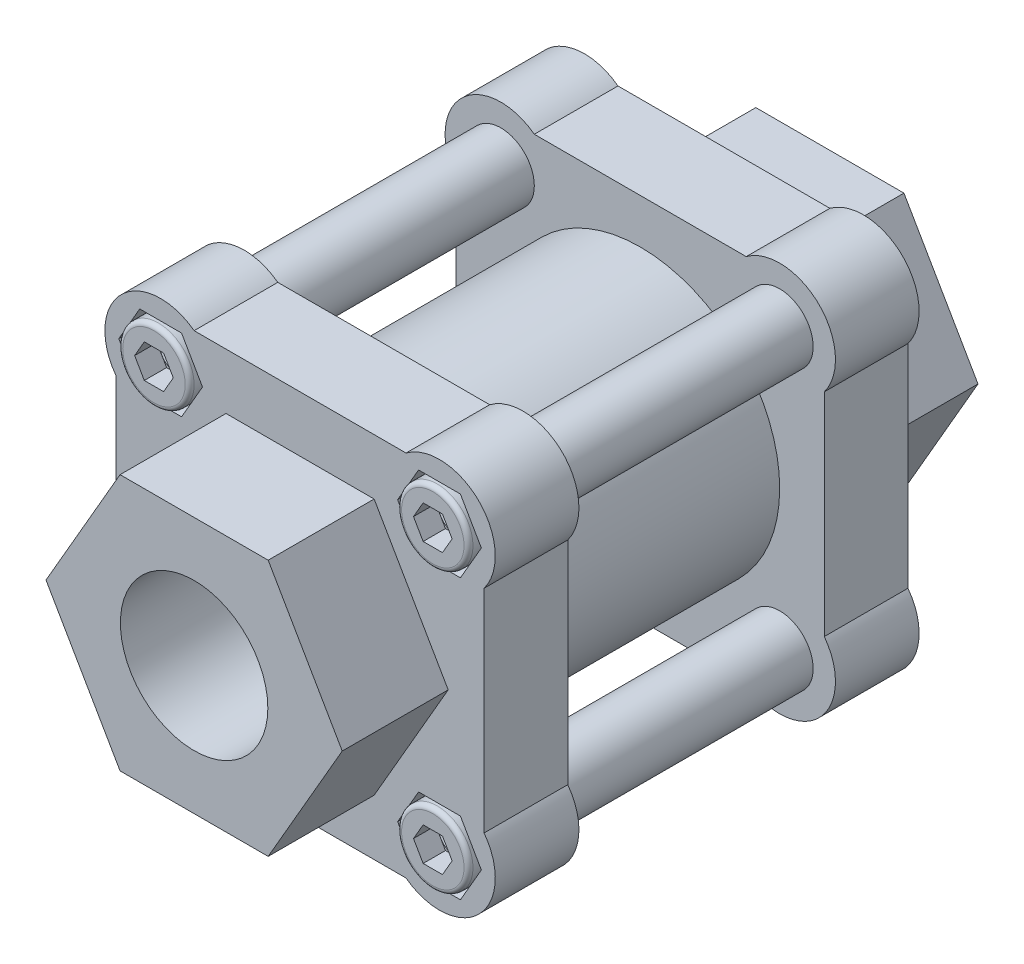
ISO-10303-21;
HEADER;
FILE_DESCRIPTION(('STEP AP214'),'2;1');
FILE_NAME('part.step','',(''),(''),'','','');
FILE_SCHEMA(('AUTOMOTIVE_DESIGN { 1 0 10303 214 1 1 1 1 }'));
ENDSEC;
DATA;
#1=APPLICATION_CONTEXT('core data for automotive mechanical design processes');
#2=APPLICATION_PROTOCOL_DEFINITION('international standard','automotive_design',2000,#1);
#3=PRODUCT_CONTEXT('',#1,'mechanical');
#4=PRODUCT('Part','Part','',(#3));
#5=PRODUCT_RELATED_PRODUCT_CATEGORY('part','',(#4));
#6=PRODUCT_DEFINITION_FORMATION('','',#4);
#7=PRODUCT_DEFINITION_CONTEXT('part definition',#1,'design');
#8=PRODUCT_DEFINITION('design','',#6,#7);
#9=PRODUCT_DEFINITION_SHAPE('','',#8);
#10=(LENGTH_UNIT() NAMED_UNIT(*) SI_UNIT(.MILLI.,.METRE.));
#11=(NAMED_UNIT(*) PLANE_ANGLE_UNIT() SI_UNIT($,.RADIAN.));
#12=(NAMED_UNIT(*) SI_UNIT($,.STERADIAN.) SOLID_ANGLE_UNIT());
#13=UNCERTAINTY_MEASURE_WITH_UNIT(LENGTH_MEASURE(1.E-05),#10,'distance_accuracy_value','');
#14=(GEOMETRIC_REPRESENTATION_CONTEXT(3) GLOBAL_UNCERTAINTY_ASSIGNED_CONTEXT((#13)) GLOBAL_UNIT_ASSIGNED_CONTEXT((#10,
#11,#12)) REPRESENTATION_CONTEXT('',''));
#15=CARTESIAN_POINT('',(0.,0.,0.));
#16=DIRECTION('',(0.,0.,1.));
#17=DIRECTION('',(1.,0.,0.));
#18=AXIS2_PLACEMENT_3D('',#15,#16,#17);
#19=CARTESIAN_POINT('',(-25.,28.,96.2));
#20=DIRECTION('',(0.,0.,-1.));
#21=DIRECTION('',(-1.,0.,0.));
#22=AXIS2_PLACEMENT_3D('',#19,#20,#21);
#23=PLANE('',#22);
#24=CARTESIAN_POINT('',(-25.,25.,96.2));
#25=DIRECTION('',(0.,0.,-1.));
#26=DIRECTION('',(-1.,0.,0.));
#27=AXIS2_PLACEMENT_3D('',#24,#25,#26);
#28=CIRCLE('',#27,5.6);
#29=CARTESIAN_POINT('',(-30.6,25.,96.2));
#30=VERTEX_POINT('',#29);
#31=EDGE_CURVE('E918',#30,#30,#28,.T.);
#32=ORIENTED_EDGE('',*,*,#31,.F.);
#33=EDGE_LOOP('',(#32));
#34=FACE_BOUND('',#33,.T.);
#35=DIRECTION('',(1.,0.,0.));
#36=VECTOR('',#35,1.);
#37=CARTESIAN_POINT('',(-25.,22.,96.2));
#38=LINE('',#37,#36);
#39=CARTESIAN_POINT('',(-26.7320508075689,22.,96.2));
#40=VERTEX_POINT('',#39);
#41=CARTESIAN_POINT('',(-23.2679491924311,22.,96.2));
#42=VERTEX_POINT('',#41);
#43=EDGE_CURVE('E9',#40,#42,#38,.T.);
#44=ORIENTED_EDGE('',*,*,#43,.F.);
#45=DIRECTION('',(0.5,-0.866025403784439,0.));
#46=VECTOR('',#45,1.);
#47=CARTESIAN_POINT('',(-28.89711431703,25.75,96.2));
#48=LINE('',#47,#46);
#49=CARTESIAN_POINT('',(-28.4641016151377,25.,96.2));
#50=VERTEX_POINT('',#49);
#51=EDGE_CURVE('E1721',#50,#40,#48,.T.);
#52=ORIENTED_EDGE('',*,*,#51,.F.);
#53=DIRECTION('',(-0.5,-0.866025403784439,0.));
#54=VECTOR('',#53,1.);
#55=CARTESIAN_POINT('',(-26.2990381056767,28.75,96.2));
#56=LINE('',#55,#54);
#57=CARTESIAN_POINT('',(-26.7320508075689,28.,96.2));
#58=VERTEX_POINT('',#57);
#59=EDGE_CURVE('E1724',#58,#50,#56,.T.);
#60=ORIENTED_EDGE('',*,*,#59,.F.);
#61=DIRECTION('',(-1.,0.,0.));
#62=VECTOR('',#61,1.);
#63=CARTESIAN_POINT('',(-25.,28.,96.2));
#64=LINE('',#63,#62);
#65=CARTESIAN_POINT('',(-23.2679491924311,28.,96.2));
#66=VERTEX_POINT('',#65);
#67=EDGE_CURVE('E1727',#66,#58,#64,.T.);
#68=ORIENTED_EDGE('',*,*,#67,.F.);
#69=DIRECTION('',(-0.5,0.866025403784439,0.));
#70=VECTOR('',#69,1.);
#71=CARTESIAN_POINT('',(-23.7009618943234,28.75,96.2));
#72=LINE('',#71,#70);
#73=CARTESIAN_POINT('',(-21.5358983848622,25.,96.2));
#74=VERTEX_POINT('',#73);
#75=EDGE_CURVE('E1730',#74,#66,#72,.T.);
#76=ORIENTED_EDGE('',*,*,#75,.F.);
#77=DIRECTION('',(0.5,0.866025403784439,0.));
#78=VECTOR('',#77,1.);
#79=CARTESIAN_POINT('',(-21.1028856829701,25.75,96.2));
#80=LINE('',#79,#78);
#81=EDGE_CURVE('E22',#42,#74,#80,.T.);
#82=ORIENTED_EDGE('',*,*,#81,.F.);
#83=EDGE_LOOP('',(#44,#52,#60,#68,#76,#82));
#84=FACE_BOUND('',#83,.T.);
#85=ADVANCED_FACE('F14',(#34,#84),#23,.F.);
#86=CARTESIAN_POINT('',(-25.,-22.,96.2));
#87=DIRECTION('',(0.,0.,-1.));
#88=DIRECTION('',(-1.,0.,0.));
#89=AXIS2_PLACEMENT_3D('',#86,#87,#88);
#90=PLANE('',#89);
#91=CARTESIAN_POINT('',(-25.,-25.,96.2));
#92=DIRECTION('',(0.,0.,-1.));
#93=DIRECTION('',(-1.,0.,0.));
#94=AXIS2_PLACEMENT_3D('',#91,#92,#93);
#95=CIRCLE('',#94,5.6);
#96=CARTESIAN_POINT('',(-30.6,-25.,96.2));
#97=VERTEX_POINT('',#96);
#98=EDGE_CURVE('E967',#97,#97,#95,.T.);
#99=ORIENTED_EDGE('',*,*,#98,.F.);
#100=EDGE_LOOP('',(#99));
#101=FACE_BOUND('',#100,.T.);
#102=DIRECTION('',(1.,0.,0.));
#103=VECTOR('',#102,1.);
#104=CARTESIAN_POINT('',(-25.,-28.,96.2));
#105=LINE('',#104,#103);
#106=CARTESIAN_POINT('',(-26.7320508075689,-28.,96.2));
#107=VERTEX_POINT('',#106);
#108=CARTESIAN_POINT('',(-23.2679491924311,-28.,96.2));
#109=VERTEX_POINT('',#108);
#110=EDGE_CURVE('E1718',#107,#109,#105,.T.);
#111=ORIENTED_EDGE('',*,*,#110,.F.);
#112=DIRECTION('',(0.5,-0.866025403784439,0.));
#113=VECTOR('',#112,1.);
#114=CARTESIAN_POINT('',(-28.89711431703,-24.25,96.2));
#115=LINE('',#114,#113);
#116=CARTESIAN_POINT('',(-28.4641016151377,-25.,96.2));
#117=VERTEX_POINT('',#116);
#118=EDGE_CURVE('E1703',#117,#107,#115,.T.);
#119=ORIENTED_EDGE('',*,*,#118,.F.);
#120=DIRECTION('',(-0.5,-0.866025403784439,0.));
#121=VECTOR('',#120,1.);
#122=CARTESIAN_POINT('',(-26.2990381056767,-21.25,96.2));
#123=LINE('',#122,#121);
#124=CARTESIAN_POINT('',(-26.7320508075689,-22.,96.2));
#125=VERTEX_POINT('',#124);
#126=EDGE_CURVE('E1706',#125,#117,#123,.T.);
#127=ORIENTED_EDGE('',*,*,#126,.F.);
#128=DIRECTION('',(-1.,0.,0.));
#129=VECTOR('',#128,1.);
#130=CARTESIAN_POINT('',(-25.,-22.,96.2));
#131=LINE('',#130,#129);
#132=CARTESIAN_POINT('',(-23.2679491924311,-22.,96.2));
#133=VERTEX_POINT('',#132);
#134=EDGE_CURVE('E1709',#133,#125,#131,.T.);
#135=ORIENTED_EDGE('',*,*,#134,.F.);
#136=DIRECTION('',(-0.5,0.866025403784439,0.));
#137=VECTOR('',#136,1.);
#138=CARTESIAN_POINT('',(-23.7009618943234,-21.25,96.2));
#139=LINE('',#138,#137);
#140=CARTESIAN_POINT('',(-21.5358983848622,-25.,96.2));
#141=VERTEX_POINT('',#140);
#142=EDGE_CURVE('E1712',#141,#133,#139,.T.);
#143=ORIENTED_EDGE('',*,*,#142,.F.);
#144=DIRECTION('',(0.5,0.866025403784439,0.));
#145=VECTOR('',#144,1.);
#146=CARTESIAN_POINT('',(-21.1028856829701,-24.25,96.2));
#147=LINE('',#146,#145);
#148=EDGE_CURVE('E1715',#109,#141,#147,.T.);
#149=ORIENTED_EDGE('',*,*,#148,.F.);
#150=EDGE_LOOP('',(#111,#119,#127,#135,#143,#149));
#151=FACE_BOUND('',#150,.T.);
#152=ADVANCED_FACE('F1782',(#101,#151),#90,.F.);
#153=CARTESIAN_POINT('',(25.,28.,96.2));
#154=DIRECTION('',(0.,0.,-1.));
#155=DIRECTION('',(-1.,0.,0.));
#156=AXIS2_PLACEMENT_3D('',#153,#154,#155);
#157=PLANE('',#156);
#158=CARTESIAN_POINT('',(25.,25.,96.2));
#159=DIRECTION('',(0.,0.,-1.));
#160=DIRECTION('',(-1.,0.,0.));
#161=AXIS2_PLACEMENT_3D('',#158,#159,#160);
#162=CIRCLE('',#161,5.6);
#163=CARTESIAN_POINT('',(19.4,25.,96.2));
#164=VERTEX_POINT('',#163);
#165=EDGE_CURVE('E1015',#164,#164,#162,.T.);
#166=ORIENTED_EDGE('',*,*,#165,.F.);
#167=EDGE_LOOP('',(#166));
#168=FACE_BOUND('',#167,.T.);
#169=DIRECTION('',(1.,0.,0.));
#170=VECTOR('',#169,1.);
#171=CARTESIAN_POINT('',(25.,22.,96.2));
#172=LINE('',#171,#170);
#173=CARTESIAN_POINT('',(23.2679491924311,22.,96.2));
#174=VERTEX_POINT('',#173);
#175=CARTESIAN_POINT('',(26.7320508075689,22.,96.2));
#176=VERTEX_POINT('',#175);
#177=EDGE_CURVE('E1700',#174,#176,#172,.T.);
#178=ORIENTED_EDGE('',*,*,#177,.F.);
#179=DIRECTION('',(0.5,-0.866025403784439,0.));
#180=VECTOR('',#179,1.);
#181=CARTESIAN_POINT('',(21.1028856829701,25.75,96.2));
#182=LINE('',#181,#180);
#183=CARTESIAN_POINT('',(21.5358983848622,25.,96.2));
#184=VERTEX_POINT('',#183);
#185=EDGE_CURVE('E1685',#184,#174,#182,.T.);
#186=ORIENTED_EDGE('',*,*,#185,.F.);
#187=DIRECTION('',(-0.5,-0.866025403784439,0.));
#188=VECTOR('',#187,1.);
#189=CARTESIAN_POINT('',(23.7009618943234,28.75,96.2));
#190=LINE('',#189,#188);
#191=CARTESIAN_POINT('',(23.2679491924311,28.,96.2));
#192=VERTEX_POINT('',#191);
#193=EDGE_CURVE('E1688',#192,#184,#190,.T.);
#194=ORIENTED_EDGE('',*,*,#193,.F.);
#195=DIRECTION('',(-1.,0.,0.));
#196=VECTOR('',#195,1.);
#197=CARTESIAN_POINT('',(25.,28.,96.2));
#198=LINE('',#197,#196);
#199=CARTESIAN_POINT('',(26.7320508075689,28.,96.2));
#200=VERTEX_POINT('',#199);
#201=EDGE_CURVE('E1691',#200,#192,#198,.T.);
#202=ORIENTED_EDGE('',*,*,#201,.F.);
#203=DIRECTION('',(-0.5,0.866025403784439,0.));
#204=VECTOR('',#203,1.);
#205=CARTESIAN_POINT('',(26.2990381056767,28.75,96.2));
#206=LINE('',#205,#204);
#207=CARTESIAN_POINT('',(28.4641016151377,25.,96.2));
#208=VERTEX_POINT('',#207);
#209=EDGE_CURVE('E1694',#208,#200,#206,.T.);
#210=ORIENTED_EDGE('',*,*,#209,.F.);
#211=DIRECTION('',(0.5,0.866025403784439,0.));
#212=VECTOR('',#211,1.);
#213=CARTESIAN_POINT('',(28.89711431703,25.75,96.2));
#214=LINE('',#213,#212);
#215=EDGE_CURVE('E1697',#176,#208,#214,.T.);
#216=ORIENTED_EDGE('',*,*,#215,.F.);
#217=EDGE_LOOP('',(#178,#186,#194,#202,#210,#216));
#218=FACE_BOUND('',#217,.T.);
#219=ADVANCED_FACE('F1788',(#168,#218),#157,.F.);
#220=CARTESIAN_POINT('',(25.,-22.,96.2));
#221=DIRECTION('',(0.,0.,-1.));
#222=DIRECTION('',(-1.,0.,0.));
#223=AXIS2_PLACEMENT_3D('',#220,#221,#222);
#224=PLANE('',#223);
#225=CARTESIAN_POINT('',(25.,-25.,96.2));
#226=DIRECTION('',(0.,0.,-1.));
#227=DIRECTION('',(-1.,0.,0.));
#228=AXIS2_PLACEMENT_3D('',#225,#226,#227);
#229=CIRCLE('',#228,5.6);
#230=CARTESIAN_POINT('',(19.4,-25.,96.2));
#231=VERTEX_POINT('',#230);
#232=EDGE_CURVE('E1063',#231,#231,#229,.T.);
#233=ORIENTED_EDGE('',*,*,#232,.F.);
#234=EDGE_LOOP('',(#233));
#235=FACE_BOUND('',#234,.T.);
#236=DIRECTION('',(1.,0.,0.));
#237=VECTOR('',#236,1.);
#238=CARTESIAN_POINT('',(25.,-28.,96.2));
#239=LINE('',#238,#237);
#240=CARTESIAN_POINT('',(23.2679491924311,-28.,96.2));
#241=VERTEX_POINT('',#240);
#242=CARTESIAN_POINT('',(26.7320508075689,-28.,96.2));
#243=VERTEX_POINT('',#242);
#244=EDGE_CURVE('E1682',#241,#243,#239,.T.);
#245=ORIENTED_EDGE('',*,*,#244,.F.);
#246=DIRECTION('',(0.5,-0.866025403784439,0.));
#247=VECTOR('',#246,1.);
#248=CARTESIAN_POINT('',(21.1028856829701,-24.25,96.2));
#249=LINE('',#248,#247);
#250=CARTESIAN_POINT('',(21.5358983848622,-25.,96.2));
#251=VERTEX_POINT('',#250);
#252=EDGE_CURVE('E936',#251,#241,#249,.T.);
#253=ORIENTED_EDGE('',*,*,#252,.F.);
#254=DIRECTION('',(-0.5,-0.866025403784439,0.));
#255=VECTOR('',#254,1.);
#256=CARTESIAN_POINT('',(23.7009618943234,-21.25,96.2));
#257=LINE('',#256,#255);
#258=CARTESIAN_POINT('',(23.2679491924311,-22.,96.2));
#259=VERTEX_POINT('',#258);
#260=EDGE_CURVE('E1670',#259,#251,#257,.T.);
#261=ORIENTED_EDGE('',*,*,#260,.F.);
#262=DIRECTION('',(-1.,0.,0.));
#263=VECTOR('',#262,1.);
#264=CARTESIAN_POINT('',(25.,-22.,96.2));
#265=LINE('',#264,#263);
#266=CARTESIAN_POINT('',(26.7320508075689,-22.,96.2));
#267=VERTEX_POINT('',#266);
#268=EDGE_CURVE('E1673',#267,#259,#265,.T.);
#269=ORIENTED_EDGE('',*,*,#268,.F.);
#270=DIRECTION('',(-0.5,0.866025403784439,0.));
#271=VECTOR('',#270,1.);
#272=CARTESIAN_POINT('',(26.2990381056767,-21.25,96.2));
#273=LINE('',#272,#271);
#274=CARTESIAN_POINT('',(28.4641016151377,-25.,96.2));
#275=VERTEX_POINT('',#274);
#276=EDGE_CURVE('E1676',#275,#267,#273,.T.);
#277=ORIENTED_EDGE('',*,*,#276,.F.);
#278=DIRECTION('',(0.5,0.866025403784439,0.));
#279=VECTOR('',#278,1.);
#280=CARTESIAN_POINT('',(28.89711431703,-24.25,96.2));
#281=LINE('',#280,#279);
#282=EDGE_CURVE('E1679',#243,#275,#281,.T.);
#283=ORIENTED_EDGE('',*,*,#282,.F.);
#284=EDGE_LOOP('',(#245,#253,#261,#269,#277,#283));
#285=FACE_BOUND('',#284,.T.);
#286=ADVANCED_FACE('F1898',(#235,#285),#224,.F.);
#287=CARTESIAN_POINT('',(25.,-25.,19.));
#288=DIRECTION('',(0.,0.,1.));
#289=DIRECTION('',(1.,0.,0.));
#290=AXIS2_PLACEMENT_3D('',#287,#288,#289);
#291=PLANE('',#290);
#292=DIRECTION('',(1.,0.,0.));
#293=VECTOR('',#292,1.);
#294=CARTESIAN_POINT('',(-28.7527767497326,-31.5,19.));
#295=LINE('',#294,#293);
#296=CARTESIAN_POINT('',(-28.7527767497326,-31.5,19.));
#297=VERTEX_POINT('',#296);
#298=CARTESIAN_POINT('',(-21.2472232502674,-31.5,19.));
#299=VERTEX_POINT('',#298);
#300=EDGE_CURVE('E1126',#297,#299,#295,.T.);
#301=ORIENTED_EDGE('',*,*,#300,.T.);
#302=DIRECTION('',(0.5,0.866025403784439,0.));
#303=VECTOR('',#302,1.);
#304=CARTESIAN_POINT('',(-21.2472232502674,-31.5,19.));
#305=LINE('',#304,#303);
#306=CARTESIAN_POINT('',(-17.4944465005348,-25.,19.));
#307=VERTEX_POINT('',#306);
#308=EDGE_CURVE('E1144',#299,#307,#305,.T.);
#309=ORIENTED_EDGE('',*,*,#308,.T.);
#310=DIRECTION('',(-0.5,0.866025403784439,0.));
#311=VECTOR('',#310,1.);
#312=CARTESIAN_POINT('',(-17.4944465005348,-25.,19.));
#313=LINE('',#312,#311);
#314=CARTESIAN_POINT('',(-21.2472232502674,-18.5,19.));
#315=VERTEX_POINT('',#314);
#316=EDGE_CURVE('E1147',#307,#315,#313,.T.);
#317=ORIENTED_EDGE('',*,*,#316,.T.);
#318=DIRECTION('',(-1.,0.,0.));
#319=VECTOR('',#318,1.);
#320=CARTESIAN_POINT('',(-21.2472232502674,-18.5,19.));
#321=LINE('',#320,#319);
#322=CARTESIAN_POINT('',(-28.7527767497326,-18.5,19.));
#323=VERTEX_POINT('',#322);
#324=EDGE_CURVE('E1150',#315,#323,#321,.T.);
#325=ORIENTED_EDGE('',*,*,#324,.T.);
#326=DIRECTION('',(-0.5,-0.866025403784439,0.));
#327=VECTOR('',#326,1.);
#328=CARTESIAN_POINT('',(-28.7527767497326,-18.5,19.));
#329=LINE('',#328,#327);
#330=CARTESIAN_POINT('',(-32.5055534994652,-25.,19.));
#331=VERTEX_POINT('',#330);
#332=EDGE_CURVE('E1153',#323,#331,#329,.T.);
#333=ORIENTED_EDGE('',*,*,#332,.T.);
#334=DIRECTION('',(0.5,-0.866025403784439,0.));
#335=VECTOR('',#334,1.);
#336=CARTESIAN_POINT('',(-32.5055534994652,-25.,19.));
#337=LINE('',#336,#335);
#338=EDGE_CURVE('E1131',#331,#297,#337,.T.);
#339=ORIENTED_EDGE('',*,*,#338,.T.);
#340=EDGE_LOOP('',(#301,#309,#317,#325,#333,#339));
#341=FACE_BOUND('',#340,.T.);
#342=DIRECTION('',(1.,0.,0.));
#343=VECTOR('',#342,1.);
#344=CARTESIAN_POINT('',(21.2472232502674,-31.5,19.));
#345=LINE('',#344,#343);
#346=CARTESIAN_POINT('',(21.2472232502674,-31.5,19.));
#347=VERTEX_POINT('',#346);
#348=CARTESIAN_POINT('',(28.7527767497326,-31.5,19.));
#349=VERTEX_POINT('',#348);
#350=EDGE_CURVE('E1216',#347,#349,#345,.T.);
#351=ORIENTED_EDGE('',*,*,#350,.T.);
#352=DIRECTION('',(0.5,0.866025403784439,0.));
#353=VECTOR('',#352,1.);
#354=CARTESIAN_POINT('',(28.7527767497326,-31.5,19.));
#355=LINE('',#354,#353);
#356=CARTESIAN_POINT('',(32.5055534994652,-25.,19.));
#357=VERTEX_POINT('',#356);
#358=EDGE_CURVE('E1234',#349,#357,#355,.T.);
#359=ORIENTED_EDGE('',*,*,#358,.T.);
#360=DIRECTION('',(-0.5,0.866025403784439,0.));
#361=VECTOR('',#360,1.);
#362=CARTESIAN_POINT('',(32.5055534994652,-25.,19.));
#363=LINE('',#362,#361);
#364=CARTESIAN_POINT('',(28.7527767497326,-18.5,19.));
#365=VERTEX_POINT('',#364);
#366=EDGE_CURVE('E1237',#357,#365,#363,.T.);
#367=ORIENTED_EDGE('',*,*,#366,.T.);
#368=DIRECTION('',(-1.,0.,0.));
#369=VECTOR('',#368,1.);
#370=CARTESIAN_POINT('',(28.7527767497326,-18.5,19.));
#371=LINE('',#370,#369);
#372=CARTESIAN_POINT('',(21.2472232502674,-18.5,19.));
#373=VERTEX_POINT('',#372);
#374=EDGE_CURVE('E1240',#365,#373,#371,.T.);
#375=ORIENTED_EDGE('',*,*,#374,.T.);
#376=DIRECTION('',(-0.5,-0.866025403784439,0.));
#377=VECTOR('',#376,1.);
#378=CARTESIAN_POINT('',(21.2472232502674,-18.5,19.));
#379=LINE('',#378,#377);
#380=CARTESIAN_POINT('',(17.4944465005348,-25.,19.));
#381=VERTEX_POINT('',#380);
#382=EDGE_CURVE('E1243',#373,#381,#379,.T.);
#383=ORIENTED_EDGE('',*,*,#382,.T.);
#384=DIRECTION('',(0.5,-0.866025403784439,0.));
#385=VECTOR('',#384,1.);
#386=CARTESIAN_POINT('',(17.4944465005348,-25.,19.));
#387=LINE('',#386,#385);
#388=EDGE_CURVE('E1221',#381,#347,#387,.T.);
#389=ORIENTED_EDGE('',*,*,#388,.T.);
#390=EDGE_LOOP('',(#351,#359,#367,#375,#383,#389));
#391=FACE_BOUND('',#390,.T.);
#392=DIRECTION('',(1.,0.,0.));
#393=VECTOR('',#392,1.);
#394=CARTESIAN_POINT('',(-19.,-33.,19.));
#395=LINE('',#394,#393);
#396=CARTESIAN_POINT('',(-19.,-33.,19.));
#397=VERTEX_POINT('',#396);
#398=CARTESIAN_POINT('',(19.,-33.,19.));
#399=VERTEX_POINT('',#398);
#400=EDGE_CURVE('E1564',#397,#399,#395,.T.);
#401=ORIENTED_EDGE('',*,*,#400,.F.);
#402=CARTESIAN_POINT('',(-25.,-25.,19.));
#403=DIRECTION('',(0.,0.,1.));
#404=DIRECTION('',(0.,1.,0.));
#405=AXIS2_PLACEMENT_3D('',#402,#403,#404);
#406=CIRCLE('',#405,10.);
#407=CARTESIAN_POINT('',(-33.,-19.,19.));
#408=VERTEX_POINT('',#407);
#409=EDGE_CURVE('E1569',#408,#397,#406,.T.);
#410=ORIENTED_EDGE('',*,*,#409,.F.);
#411=DIRECTION('',(0.,-1.,0.));
#412=VECTOR('',#411,1.);
#413=CARTESIAN_POINT('',(-33.,19.,19.));
#414=LINE('',#413,#412);
#415=CARTESIAN_POINT('',(-33.,19.,19.));
#416=VERTEX_POINT('',#415);
#417=EDGE_CURVE('E1601',#416,#408,#414,.T.);
#418=ORIENTED_EDGE('',*,*,#417,.F.);
#419=CARTESIAN_POINT('',(-25.,25.,19.));
#420=DIRECTION('',(0.,0.,1.));
#421=DIRECTION('',(0.,1.,0.));
#422=AXIS2_PLACEMENT_3D('',#419,#420,#421);
#423=CIRCLE('',#422,10.);
#424=CARTESIAN_POINT('',(-19.,33.,19.));
#425=VERTEX_POINT('',#424);
#426=EDGE_CURVE('E1598',#425,#416,#423,.T.);
#427=ORIENTED_EDGE('',*,*,#426,.F.);
#428=DIRECTION('',(-1.,0.,0.));
#429=VECTOR('',#428,1.);
#430=CARTESIAN_POINT('',(19.,33.,19.));
#431=LINE('',#430,#429);
#432=CARTESIAN_POINT('',(19.,33.,19.));
#433=VERTEX_POINT('',#432);
#434=EDGE_CURVE('E1595',#433,#425,#431,.T.);
#435=ORIENTED_EDGE('',*,*,#434,.F.);
#436=CARTESIAN_POINT('',(25.,25.,19.));
#437=DIRECTION('',(0.,0.,1.));
#438=DIRECTION('',(0.,1.,0.));
#439=AXIS2_PLACEMENT_3D('',#436,#437,#438);
#440=CIRCLE('',#439,10.);
#441=CARTESIAN_POINT('',(33.,19.,19.));
#442=VERTEX_POINT('',#441);
#443=EDGE_CURVE('E1592',#442,#433,#440,.T.);
#444=ORIENTED_EDGE('',*,*,#443,.F.);
#445=DIRECTION('',(0.,1.,0.));
#446=VECTOR('',#445,1.);
#447=CARTESIAN_POINT('',(33.,-19.,19.));
#448=LINE('',#447,#446);
#449=CARTESIAN_POINT('',(33.,-19.,19.));
#450=VERTEX_POINT('',#449);
#451=EDGE_CURVE('E1589',#450,#442,#448,.T.);
#452=ORIENTED_EDGE('',*,*,#451,.F.);
#453=CARTESIAN_POINT('',(25.,-25.,19.));
#454=DIRECTION('',(0.,0.,1.));
#455=DIRECTION('',(0.,1.,0.));
#456=AXIS2_PLACEMENT_3D('',#453,#454,#455);
#457=CIRCLE('',#456,10.);
#458=EDGE_CURVE('E1586',#399,#450,#457,.T.);
#459=ORIENTED_EDGE('',*,*,#458,.F.);
#460=EDGE_LOOP('',(#401,#410,#418,#427,#435,#444,#452,#459));
#461=FACE_BOUND('',#460,.T.);
#462=DIRECTION('',(-1.,0.,0.));
#463=VECTOR('',#462,1.);
#464=CARTESIAN_POINT('',(25.,-23.,19.));
#465=LINE('',#464,#463);
#466=CARTESIAN_POINT('',(13.2790561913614,-23.,19.));
#467=VERTEX_POINT('',#466);
#468=CARTESIAN_POINT('',(-13.2790561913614,-23.,19.));
#469=VERTEX_POINT('',#468);
#470=EDGE_CURVE('E1652',#467,#469,#465,.T.);
#471=ORIENTED_EDGE('',*,*,#470,.F.);
#472=DIRECTION('',(-0.5,-0.866025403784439,0.));
#473=VECTOR('',#472,1.);
#474=CARTESIAN_POINT('',(15.3432667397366,-19.4246824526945,19.));
#475=LINE('',#474,#473);
#476=CARTESIAN_POINT('',(26.5581123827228,0.,19.));
#477=VERTEX_POINT('',#476);
#478=EDGE_CURVE('E1649',#477,#467,#475,.T.);
#479=ORIENTED_EDGE('',*,*,#478,.F.);
#480=DIRECTION('',(0.5,-0.866025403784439,0.));
#481=VECTOR('',#480,1.);
#482=CARTESIAN_POINT('',(36.9939018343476,-18.0753175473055,19.));
#483=LINE('',#482,#481);
#484=CARTESIAN_POINT('',(13.2790561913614,23.,19.));
#485=VERTEX_POINT('',#484);
#486=EDGE_CURVE('E1646',#485,#477,#483,.T.);
#487=ORIENTED_EDGE('',*,*,#486,.F.);
#488=DIRECTION('',(1.,0.,0.));
#489=VECTOR('',#488,1.);
#490=CARTESIAN_POINT('',(25.,23.,19.));
#491=LINE('',#490,#489);
#492=CARTESIAN_POINT('',(-13.2790561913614,23.,19.));
#493=VERTEX_POINT('',#492);
#494=EDGE_CURVE('E1643',#493,#485,#491,.T.);
#495=ORIENTED_EDGE('',*,*,#494,.F.);
#496=DIRECTION('',(0.5,0.866025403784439,0.));
#497=VECTOR('',#496,1.);
#498=CARTESIAN_POINT('',(-24.4939018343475,3.57531754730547,19.));
#499=LINE('',#498,#497);
#500=CARTESIAN_POINT('',(-26.5581123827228,0.,19.));
#501=VERTEX_POINT('',#500);
#502=EDGE_CURVE('E1640',#501,#493,#499,.T.);
#503=ORIENTED_EDGE('',*,*,#502,.F.);
#504=DIRECTION('',(-0.5,0.866025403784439,0.));
#505=VECTOR('',#504,1.);
#506=CARTESIAN_POINT('',(-2.84326673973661,-41.0753175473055,19.));
#507=LINE('',#506,#505);
#508=EDGE_CURVE('E1637',#469,#501,#507,.T.);
#509=ORIENTED_EDGE('',*,*,#508,.F.);
#510=EDGE_LOOP('',(#471,#479,#487,#495,#503,#509));
#511=FACE_BOUND('',#510,.T.);
#512=DIRECTION('',(1.,0.,0.));
#513=VECTOR('',#512,1.);
#514=CARTESIAN_POINT('',(21.2472232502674,18.5,19.));
#515=LINE('',#514,#513);
#516=CARTESIAN_POINT('',(21.2472232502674,18.5,19.));
#517=VERTEX_POINT('',#516);
#518=CARTESIAN_POINT('',(28.7527767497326,18.5,19.));
#519=VERTEX_POINT('',#518);
#520=EDGE_CURVE('E1171',#517,#519,#515,.T.);
#521=ORIENTED_EDGE('',*,*,#520,.T.);
#522=DIRECTION('',(0.5,0.866025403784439,0.));
#523=VECTOR('',#522,1.);
#524=CARTESIAN_POINT('',(28.7527767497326,18.5,19.));
#525=LINE('',#524,#523);
#526=CARTESIAN_POINT('',(32.5055534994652,25.,19.));
#527=VERTEX_POINT('',#526);
#528=EDGE_CURVE('E1189',#519,#527,#525,.T.);
#529=ORIENTED_EDGE('',*,*,#528,.T.);
#530=DIRECTION('',(-0.5,0.866025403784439,0.));
#531=VECTOR('',#530,1.);
#532=CARTESIAN_POINT('',(32.5055534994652,25.,19.));
#533=LINE('',#532,#531);
#534=CARTESIAN_POINT('',(28.7527767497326,31.5,19.));
#535=VERTEX_POINT('',#534);
#536=EDGE_CURVE('E1192',#527,#535,#533,.T.);
#537=ORIENTED_EDGE('',*,*,#536,.T.);
#538=DIRECTION('',(-1.,0.,0.));
#539=VECTOR('',#538,1.);
#540=CARTESIAN_POINT('',(28.7527767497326,31.5,19.));
#541=LINE('',#540,#539);
#542=CARTESIAN_POINT('',(21.2472232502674,31.5,19.));
#543=VERTEX_POINT('',#542);
#544=EDGE_CURVE('E1195',#535,#543,#541,.T.);
#545=ORIENTED_EDGE('',*,*,#544,.T.);
#546=DIRECTION('',(-0.5,-0.866025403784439,0.));
#547=VECTOR('',#546,1.);
#548=CARTESIAN_POINT('',(21.2472232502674,31.5,19.));
#549=LINE('',#548,#547);
#550=CARTESIAN_POINT('',(17.4944465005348,25.,19.));
#551=VERTEX_POINT('',#550);
#552=EDGE_CURVE('E1198',#543,#551,#549,.T.);
#553=ORIENTED_EDGE('',*,*,#552,.T.);
#554=DIRECTION('',(0.5,-0.866025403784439,0.));
#555=VECTOR('',#554,1.);
#556=CARTESIAN_POINT('',(17.4944465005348,25.,19.));
#557=LINE('',#556,#555);
#558=EDGE_CURVE('E1176',#551,#517,#557,.T.);
#559=ORIENTED_EDGE('',*,*,#558,.T.);
#560=EDGE_LOOP('',(#521,#529,#537,#545,#553,#559));
#561=FACE_BOUND('',#560,.T.);
#562=DIRECTION('',(1.,0.,0.));
#563=VECTOR('',#562,1.);
#564=CARTESIAN_POINT('',(-28.7527767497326,18.5,19.));
#565=LINE('',#564,#563);
#566=CARTESIAN_POINT('',(-28.7527767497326,18.5,19.));
#567=VERTEX_POINT('',#566);
#568=CARTESIAN_POINT('',(-21.2472232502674,18.5,19.));
#569=VERTEX_POINT('',#568);
#570=EDGE_CURVE('E1077',#567,#569,#565,.T.);
#571=ORIENTED_EDGE('',*,*,#570,.T.);
#572=DIRECTION('',(0.5,0.866025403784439,0.));
#573=VECTOR('',#572,1.);
#574=CARTESIAN_POINT('',(-21.2472232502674,18.5,19.));
#575=LINE('',#574,#573);
#576=CARTESIAN_POINT('',(-17.4944465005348,25.,19.));
#577=VERTEX_POINT('',#576);
#578=EDGE_CURVE('E1099',#569,#577,#575,.T.);
#579=ORIENTED_EDGE('',*,*,#578,.T.);
#580=DIRECTION('',(-0.5,0.866025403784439,0.));
#581=VECTOR('',#580,1.);
#582=CARTESIAN_POINT('',(-17.4944465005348,25.,19.));
#583=LINE('',#582,#581);
#584=CARTESIAN_POINT('',(-21.2472232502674,31.5,19.));
#585=VERTEX_POINT('',#584);
#586=EDGE_CURVE('E1102',#577,#585,#583,.T.);
#587=ORIENTED_EDGE('',*,*,#586,.T.);
#588=DIRECTION('',(-1.,0.,0.));
#589=VECTOR('',#588,1.);
#590=CARTESIAN_POINT('',(-21.2472232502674,31.5,19.));
#591=LINE('',#590,#589);
#592=CARTESIAN_POINT('',(-28.7527767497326,31.5,19.));
#593=VERTEX_POINT('',#592);
#594=EDGE_CURVE('E1105',#585,#593,#591,.T.);
#595=ORIENTED_EDGE('',*,*,#594,.T.);
#596=DIRECTION('',(-0.5,-0.866025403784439,0.));
#597=VECTOR('',#596,1.);
#598=CARTESIAN_POINT('',(-28.7527767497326,31.5,19.));
#599=LINE('',#598,#597);
#600=CARTESIAN_POINT('',(-32.5055534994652,25.,19.));
#601=VERTEX_POINT('',#600);
#602=EDGE_CURVE('E1108',#593,#601,#599,.T.);
#603=ORIENTED_EDGE('',*,*,#602,.T.);
#604=DIRECTION('',(0.5,-0.866025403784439,0.));
#605=VECTOR('',#604,1.);
#606=CARTESIAN_POINT('',(-32.5055534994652,25.,19.));
#607=LINE('',#606,#605);
#608=EDGE_CURVE('E1086',#601,#567,#607,.T.);
#609=ORIENTED_EDGE('',*,*,#608,.T.);
#610=EDGE_LOOP('',(#571,#579,#587,#595,#603,#609));
#611=FACE_BOUND('',#610,.T.);
#612=ADVANCED_FACE('F1954',(#341,#391,#461,#511,#561,#611),#291,.F.);
#613=CARTESIAN_POINT('',(25.,-25.,95.));
#614=DIRECTION('',(0.,0.,1.));
#615=DIRECTION('',(1.,0.,0.));
#616=AXIS2_PLACEMENT_3D('',#613,#614,#615);
#617=PLANE('',#616);
#618=DIRECTION('',(1.,0.,0.));
#619=VECTOR('',#618,1.);
#620=CARTESIAN_POINT('',(-28.7527767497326,18.5,95.));
#621=LINE('',#620,#619);
#622=CARTESIAN_POINT('',(-28.7527767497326,18.5,95.));
#623=VERTEX_POINT('',#622);
#624=CARTESIAN_POINT('',(-21.2472232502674,18.5,95.));
#625=VERTEX_POINT('',#624);
#626=EDGE_CURVE('E1261',#623,#625,#621,.T.);
#627=ORIENTED_EDGE('',*,*,#626,.F.);
#628=DIRECTION('',(0.5,-0.866025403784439,0.));
#629=VECTOR('',#628,1.);
#630=CARTESIAN_POINT('',(-32.5055534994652,25.,95.));
#631=LINE('',#630,#629);
#632=CARTESIAN_POINT('',(-32.5055534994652,25.,95.));
#633=VERTEX_POINT('',#632);
#634=EDGE_CURVE('E1266',#633,#623,#631,.T.);
#635=ORIENTED_EDGE('',*,*,#634,.F.);
#636=DIRECTION('',(-0.5,-0.866025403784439,0.));
#637=VECTOR('',#636,1.);
#638=CARTESIAN_POINT('',(-28.7527767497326,31.5,95.));
#639=LINE('',#638,#637);
#640=CARTESIAN_POINT('',(-28.7527767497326,31.5,95.));
#641=VERTEX_POINT('',#640);
#642=EDGE_CURVE('E1293',#641,#633,#639,.T.);
#643=ORIENTED_EDGE('',*,*,#642,.F.);
#644=DIRECTION('',(-1.,0.,0.));
#645=VECTOR('',#644,1.);
#646=CARTESIAN_POINT('',(-21.2472232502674,31.5,95.));
#647=LINE('',#646,#645);
#648=CARTESIAN_POINT('',(-21.2472232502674,31.5,95.));
#649=VERTEX_POINT('',#648);
#650=EDGE_CURVE('E1290',#649,#641,#647,.T.);
#651=ORIENTED_EDGE('',*,*,#650,.F.);
#652=DIRECTION('',(-0.5,0.866025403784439,0.));
#653=VECTOR('',#652,1.);
#654=CARTESIAN_POINT('',(-17.4944465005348,25.,95.));
#655=LINE('',#654,#653);
#656=CARTESIAN_POINT('',(-17.4944465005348,25.,95.));
#657=VERTEX_POINT('',#656);
#658=EDGE_CURVE('E1287',#657,#649,#655,.T.);
#659=ORIENTED_EDGE('',*,*,#658,.F.);
#660=DIRECTION('',(0.5,0.866025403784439,0.));
#661=VECTOR('',#660,1.);
#662=CARTESIAN_POINT('',(-21.2472232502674,18.5,95.));
#663=LINE('',#662,#661);
#664=EDGE_CURVE('E1284',#625,#657,#663,.T.);
#665=ORIENTED_EDGE('',*,*,#664,.F.);
#666=EDGE_LOOP('',(#627,#635,#643,#651,#659,#665));
#667=FACE_BOUND('',#666,.T.);
#668=DIRECTION('',(1.,0.,0.));
#669=VECTOR('',#668,1.);
#670=CARTESIAN_POINT('',(-28.7527767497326,-31.5,95.));
#671=LINE('',#670,#669);
#672=CARTESIAN_POINT('',(-28.7527767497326,-31.5,95.));
#673=VERTEX_POINT('',#672);
#674=CARTESIAN_POINT('',(-21.2472232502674,-31.5,95.));
#675=VERTEX_POINT('',#674);
#676=EDGE_CURVE('E1309',#673,#675,#671,.T.);
#677=ORIENTED_EDGE('',*,*,#676,.F.);
#678=DIRECTION('',(0.5,-0.866025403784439,0.));
#679=VECTOR('',#678,1.);
#680=CARTESIAN_POINT('',(-32.5055534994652,-25.,95.));
#681=LINE('',#680,#679);
#682=CARTESIAN_POINT('',(-32.5055534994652,-25.,95.));
#683=VERTEX_POINT('',#682);
#684=EDGE_CURVE('E1314',#683,#673,#681,.T.);
#685=ORIENTED_EDGE('',*,*,#684,.F.);
#686=DIRECTION('',(-0.5,-0.866025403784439,0.));
#687=VECTOR('',#686,1.);
#688=CARTESIAN_POINT('',(-28.7527767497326,-18.5,95.));
#689=LINE('',#688,#687);
#690=CARTESIAN_POINT('',(-28.7527767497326,-18.5,95.));
#691=VERTEX_POINT('',#690);
#692=EDGE_CURVE('E1341',#691,#683,#689,.T.);
#693=ORIENTED_EDGE('',*,*,#692,.F.);
#694=DIRECTION('',(-1.,0.,0.));
#695=VECTOR('',#694,1.);
#696=CARTESIAN_POINT('',(-21.2472232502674,-18.5,95.));
#697=LINE('',#696,#695);
#698=CARTESIAN_POINT('',(-21.2472232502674,-18.5,95.));
#699=VERTEX_POINT('',#698);
#700=EDGE_CURVE('E1338',#699,#691,#697,.T.);
#701=ORIENTED_EDGE('',*,*,#700,.F.);
#702=DIRECTION('',(-0.5,0.866025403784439,0.));
#703=VECTOR('',#702,1.);
#704=CARTESIAN_POINT('',(-17.4944465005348,-25.,95.));
#705=LINE('',#704,#703);
#706=CARTESIAN_POINT('',(-17.4944465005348,-25.,95.));
#707=VERTEX_POINT('',#706);
#708=EDGE_CURVE('E1335',#707,#699,#705,.T.);
#709=ORIENTED_EDGE('',*,*,#708,.F.);
#710=DIRECTION('',(0.5,0.866025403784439,0.));
#711=VECTOR('',#710,1.);
#712=CARTESIAN_POINT('',(-21.2472232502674,-31.5,95.));
#713=LINE('',#712,#711);
#714=EDGE_CURVE('E1332',#675,#707,#713,.T.);
#715=ORIENTED_EDGE('',*,*,#714,.F.);
#716=EDGE_LOOP('',(#677,#685,#693,#701,#709,#715));
#717=FACE_BOUND('',#716,.T.);
#718=DIRECTION('',(1.,0.,0.));
#719=VECTOR('',#718,1.);
#720=CARTESIAN_POINT('',(21.2472232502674,18.5,95.));
#721=LINE('',#720,#719);
#722=CARTESIAN_POINT('',(21.2472232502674,18.5,95.));
#723=VERTEX_POINT('',#722);
#724=CARTESIAN_POINT('',(28.7527767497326,18.5,95.));
#725=VERTEX_POINT('',#724);
#726=EDGE_CURVE('E1357',#723,#725,#721,.T.);
#727=ORIENTED_EDGE('',*,*,#726,.F.);
#728=DIRECTION('',(0.5,-0.866025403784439,0.));
#729=VECTOR('',#728,1.);
#730=CARTESIAN_POINT('',(17.4944465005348,25.,95.));
#731=LINE('',#730,#729);
#732=CARTESIAN_POINT('',(17.4944465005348,25.,95.));
#733=VERTEX_POINT('',#732);
#734=EDGE_CURVE('E1362',#733,#723,#731,.T.);
#735=ORIENTED_EDGE('',*,*,#734,.F.);
#736=DIRECTION('',(-0.5,-0.866025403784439,0.));
#737=VECTOR('',#736,1.);
#738=CARTESIAN_POINT('',(21.2472232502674,31.5,95.));
#739=LINE('',#738,#737);
#740=CARTESIAN_POINT('',(21.2472232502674,31.5,95.));
#741=VERTEX_POINT('',#740);
#742=EDGE_CURVE('E1389',#741,#733,#739,.T.);
#743=ORIENTED_EDGE('',*,*,#742,.F.);
#744=DIRECTION('',(-1.,0.,0.));
#745=VECTOR('',#744,1.);
#746=CARTESIAN_POINT('',(28.7527767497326,31.5,95.));
#747=LINE('',#746,#745);
#748=CARTESIAN_POINT('',(28.7527767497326,31.5,95.));
#749=VERTEX_POINT('',#748);
#750=EDGE_CURVE('E1386',#749,#741,#747,.T.);
#751=ORIENTED_EDGE('',*,*,#750,.F.);
#752=DIRECTION('',(-0.5,0.866025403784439,0.));
#753=VECTOR('',#752,1.);
#754=CARTESIAN_POINT('',(32.5055534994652,25.,95.));
#755=LINE('',#754,#753);
#756=CARTESIAN_POINT('',(32.5055534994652,25.,95.));
#757=VERTEX_POINT('',#756);
#758=EDGE_CURVE('E1383',#757,#749,#755,.T.);
#759=ORIENTED_EDGE('',*,*,#758,.F.);
#760=DIRECTION('',(0.5,0.866025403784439,0.));
#761=VECTOR('',#760,1.);
#762=CARTESIAN_POINT('',(28.7527767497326,18.5,95.));
#763=LINE('',#762,#761);
#764=EDGE_CURVE('E1380',#725,#757,#763,.T.);
#765=ORIENTED_EDGE('',*,*,#764,.F.);
#766=EDGE_LOOP('',(#727,#735,#743,#751,#759,#765));
#767=FACE_BOUND('',#766,.T.);
#768=DIRECTION('',(1.,0.,0.));
#769=VECTOR('',#768,1.);
#770=CARTESIAN_POINT('',(21.2472232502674,-31.5,95.));
#771=LINE('',#770,#769);
#772=CARTESIAN_POINT('',(21.2472232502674,-31.5,95.));
#773=VERTEX_POINT('',#772);
#774=CARTESIAN_POINT('',(28.7527767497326,-31.5,95.));
#775=VERTEX_POINT('',#774);
#776=EDGE_CURVE('E1405',#773,#775,#771,.T.);
#777=ORIENTED_EDGE('',*,*,#776,.F.);
#778=DIRECTION('',(0.5,-0.866025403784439,0.));
#779=VECTOR('',#778,1.);
#780=CARTESIAN_POINT('',(17.4944465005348,-25.,95.));
#781=LINE('',#780,#779);
#782=CARTESIAN_POINT('',(17.4944465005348,-25.,95.));
#783=VERTEX_POINT('',#782);
#784=EDGE_CURVE('E1410',#783,#773,#781,.T.);
#785=ORIENTED_EDGE('',*,*,#784,.F.);
#786=DIRECTION('',(-0.5,-0.866025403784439,0.));
#787=VECTOR('',#786,1.);
#788=CARTESIAN_POINT('',(21.2472232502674,-18.5,95.));
#789=LINE('',#788,#787);
#790=CARTESIAN_POINT('',(21.2472232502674,-18.5,95.));
#791=VERTEX_POINT('',#790);
#792=EDGE_CURVE('E1437',#791,#783,#789,.T.);
#793=ORIENTED_EDGE('',*,*,#792,.F.);
#794=DIRECTION('',(-1.,0.,0.));
#795=VECTOR('',#794,1.);
#796=CARTESIAN_POINT('',(28.7527767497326,-18.5,95.));
#797=LINE('',#796,#795);
#798=CARTESIAN_POINT('',(28.7527767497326,-18.5,95.));
#799=VERTEX_POINT('',#798);
#800=EDGE_CURVE('E1434',#799,#791,#797,.T.);
#801=ORIENTED_EDGE('',*,*,#800,.F.);
#802=DIRECTION('',(-0.5,0.866025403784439,0.));
#803=VECTOR('',#802,1.);
#804=CARTESIAN_POINT('',(32.5055534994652,-25.,95.));
#805=LINE('',#804,#803);
#806=CARTESIAN_POINT('',(32.5055534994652,-25.,95.));
#807=VERTEX_POINT('',#806);
#808=EDGE_CURVE('E1431',#807,#799,#805,.T.);
#809=ORIENTED_EDGE('',*,*,#808,.F.);
#810=DIRECTION('',(0.5,0.866025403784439,0.));
#811=VECTOR('',#810,1.);
#812=CARTESIAN_POINT('',(28.7527767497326,-31.5,95.));
#813=LINE('',#812,#811);
#814=EDGE_CURVE('E1428',#775,#807,#813,.T.);
#815=ORIENTED_EDGE('',*,*,#814,.F.);
#816=EDGE_LOOP('',(#777,#785,#793,#801,#809,#815));
#817=FACE_BOUND('',#816,.T.);
#818=DIRECTION('',(1.,0.,0.));
#819=VECTOR('',#818,1.);
#820=CARTESIAN_POINT('',(-19.,-33.,95.));
#821=LINE('',#820,#819);
#822=CARTESIAN_POINT('',(-19.,-33.,95.));
#823=VERTEX_POINT('',#822);
#824=CARTESIAN_POINT('',(19.,-33.,95.));
#825=VERTEX_POINT('',#824);
#826=EDGE_CURVE('E1565',#823,#825,#821,.T.);
#827=ORIENTED_EDGE('',*,*,#826,.T.);
#828=CARTESIAN_POINT('',(25.,-25.,95.));
#829=DIRECTION('',(0.,0.,1.));
#830=DIRECTION('',(0.,1.,0.));
#831=AXIS2_PLACEMENT_3D('',#828,#829,#830);
#832=CIRCLE('',#831,10.);
#833=CARTESIAN_POINT('',(33.,-19.,95.));
#834=VERTEX_POINT('',#833);
#835=EDGE_CURVE('E1568',#825,#834,#832,.T.);
#836=ORIENTED_EDGE('',*,*,#835,.T.);
#837=DIRECTION('',(0.,1.,0.));
#838=VECTOR('',#837,1.);
#839=CARTESIAN_POINT('',(33.,-19.,95.));
#840=LINE('',#839,#838);
#841=CARTESIAN_POINT('',(33.,19.,95.));
#842=VERTEX_POINT('',#841);
#843=EDGE_CURVE('E1571',#834,#842,#840,.T.);
#844=ORIENTED_EDGE('',*,*,#843,.T.);
#845=CARTESIAN_POINT('',(25.,25.,95.));
#846=DIRECTION('',(0.,0.,1.));
#847=DIRECTION('',(0.,1.,0.));
#848=AXIS2_PLACEMENT_3D('',#845,#846,#847);
#849=CIRCLE('',#848,10.);
#850=CARTESIAN_POINT('',(19.,33.,95.));
#851=VERTEX_POINT('',#850);
#852=EDGE_CURVE('E1573',#842,#851,#849,.T.);
#853=ORIENTED_EDGE('',*,*,#852,.T.);
#854=DIRECTION('',(-1.,0.,0.));
#855=VECTOR('',#854,1.);
#856=CARTESIAN_POINT('',(19.,33.,95.));
#857=LINE('',#856,#855);
#858=CARTESIAN_POINT('',(-19.,33.,95.));
#859=VERTEX_POINT('',#858);
#860=EDGE_CURVE('E1575',#851,#859,#857,.T.);
#861=ORIENTED_EDGE('',*,*,#860,.T.);
#862=CARTESIAN_POINT('',(-25.,25.,95.));
#863=DIRECTION('',(0.,0.,1.));
#864=DIRECTION('',(0.,1.,0.));
#865=AXIS2_PLACEMENT_3D('',#862,#863,#864);
#866=CIRCLE('',#865,10.);
#867=CARTESIAN_POINT('',(-33.,19.,95.));
#868=VERTEX_POINT('',#867);
#869=EDGE_CURVE('E1577',#859,#868,#866,.T.);
#870=ORIENTED_EDGE('',*,*,#869,.T.);
#871=DIRECTION('',(0.,-1.,0.));
#872=VECTOR('',#871,1.);
#873=CARTESIAN_POINT('',(-33.,19.,95.));
#874=LINE('',#873,#872);
#875=CARTESIAN_POINT('',(-33.,-19.,95.));
#876=VERTEX_POINT('',#875);
#877=EDGE_CURVE('E1579',#868,#876,#874,.T.);
#878=ORIENTED_EDGE('',*,*,#877,.T.);
#879=CARTESIAN_POINT('',(-25.,-25.,95.));
#880=DIRECTION('',(0.,0.,1.));
#881=DIRECTION('',(0.,1.,0.));
#882=AXIS2_PLACEMENT_3D('',#879,#880,#881);
#883=CIRCLE('',#882,10.);
#884=EDGE_CURVE('E1581',#876,#823,#883,.T.);
#885=ORIENTED_EDGE('',*,*,#884,.T.);
#886=EDGE_LOOP('',(#827,#836,#844,#853,#861,#870,#878,#885));
#887=FACE_BOUND('',#886,.T.);
#888=DIRECTION('',(-0.5,-0.866025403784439,0.));
#889=VECTOR('',#888,1.);
#890=CARTESIAN_POINT('',(15.3432667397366,-19.4246824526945,95.));
#891=LINE('',#890,#889);
#892=CARTESIAN_POINT('',(26.5581123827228,0.,95.));
#893=VERTEX_POINT('',#892);
#894=CARTESIAN_POINT('',(13.2790561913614,-23.,95.));
#895=VERTEX_POINT('',#894);
#896=EDGE_CURVE('E1558',#893,#895,#891,.T.);
#897=ORIENTED_EDGE('',*,*,#896,.T.);
#898=DIRECTION('',(-1.,0.,0.));
#899=VECTOR('',#898,1.);
#900=CARTESIAN_POINT('',(25.,-23.,95.));
#901=LINE('',#900,#899);
#902=CARTESIAN_POINT('',(-13.2790561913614,-23.,95.));
#903=VERTEX_POINT('',#902);
#904=EDGE_CURVE('E1561',#895,#903,#901,.T.);
#905=ORIENTED_EDGE('',*,*,#904,.T.);
#906=DIRECTION('',(-0.5,0.866025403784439,0.));
#907=VECTOR('',#906,1.);
#908=CARTESIAN_POINT('',(-2.84326673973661,-41.0753175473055,95.));
#909=LINE('',#908,#907);
#910=CARTESIAN_POINT('',(-26.5581123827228,0.,95.));
#911=VERTEX_POINT('',#910);
#912=EDGE_CURVE('E1546',#903,#911,#909,.T.);
#913=ORIENTED_EDGE('',*,*,#912,.T.);
#914=DIRECTION('',(0.5,0.866025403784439,0.));
#915=VECTOR('',#914,1.);
#916=CARTESIAN_POINT('',(-24.4939018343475,3.57531754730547,95.));
#917=LINE('',#916,#915);
#918=CARTESIAN_POINT('',(-13.2790561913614,23.,95.));
#919=VERTEX_POINT('',#918);
#920=EDGE_CURVE('E1549',#911,#919,#917,.T.);
#921=ORIENTED_EDGE('',*,*,#920,.T.);
#922=DIRECTION('',(1.,0.,0.));
#923=VECTOR('',#922,1.);
#924=CARTESIAN_POINT('',(25.,23.,95.));
#925=LINE('',#924,#923);
#926=CARTESIAN_POINT('',(13.2790561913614,23.,95.));
#927=VERTEX_POINT('',#926);
#928=EDGE_CURVE('E1552',#919,#927,#925,.T.);
#929=ORIENTED_EDGE('',*,*,#928,.T.);
#930=DIRECTION('',(0.5,-0.866025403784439,0.));
#931=VECTOR('',#930,1.);
#932=CARTESIAN_POINT('',(36.9939018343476,-18.0753175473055,95.));
#933=LINE('',#932,#931);
#934=EDGE_CURVE('E1555',#927,#893,#933,.T.);
#935=ORIENTED_EDGE('',*,*,#934,.T.);
#936=EDGE_LOOP('',(#897,#905,#913,#921,#929,#935));
#937=FACE_BOUND('',#936,.T.);
#938=ADVANCED_FACE('F2237',(#667,#717,#767,#817,#887,#937),#617,.T.);
#939=CARTESIAN_POINT('',(-19.,-33.,95.));
#940=DIRECTION('',(0.,1.,0.));
#941=DIRECTION('',(-1.,0.,0.));
#942=AXIS2_PLACEMENT_3D('',#939,#940,#941);
#943=PLANE('',#942);
#944=DIRECTION('',(0.,0.,-1.));
#945=VECTOR('',#944,1.);
#946=CARTESIAN_POINT('',(-19.,-33.,95.));
#947=LINE('',#946,#945);
#948=CARTESIAN_POINT('',(-19.,-33.,80.));
#949=VERTEX_POINT('',#948);
#950=EDGE_CURVE('E1606',#823,#949,#947,.T.);
#951=ORIENTED_EDGE('',*,*,#950,.T.);
#952=DIRECTION('',(1.,0.,0.));
#953=VECTOR('',#952,1.);
#954=CARTESIAN_POINT('',(-19.,-33.,80.));
#955=LINE('',#954,#953);
#956=CARTESIAN_POINT('',(19.,-33.,80.));
#957=VERTEX_POINT('',#956);
#958=EDGE_CURVE('E1482',#949,#957,#955,.T.);
#959=ORIENTED_EDGE('',*,*,#958,.T.);
#960=DIRECTION('',(0.,0.,-1.));
#961=VECTOR('',#960,1.);
#962=CARTESIAN_POINT('',(19.,-33.,95.));
#963=LINE('',#962,#961);
#964=EDGE_CURVE('E1634',#825,#957,#963,.T.);
#965=ORIENTED_EDGE('',*,*,#964,.F.);
#966=ORIENTED_EDGE('',*,*,#826,.F.);
#967=EDGE_LOOP('',(#951,#959,#965,#966));
#968=FACE_BOUND('',#967,.T.);
#969=ADVANCED_FACE('F16',(#968),#943,.F.);
#970=CARTESIAN_POINT('',(25.,-25.,95.));
#971=DIRECTION('',(0.,0.,-1.));
#972=DIRECTION('',(-1.,0.,0.));
#973=AXIS2_PLACEMENT_3D('',#970,#971,#972);
#974=CYLINDRICAL_SURFACE('',#973,10.);
#975=CARTESIAN_POINT('',(25.,-25.,80.));
#976=DIRECTION('',(0.,0.,1.));
#977=DIRECTION('',(1.,0.,0.));
#978=AXIS2_PLACEMENT_3D('',#975,#976,#977);
#979=CIRCLE('',#978,10.);
#980=CARTESIAN_POINT('',(33.,-19.,80.));
#981=VERTEX_POINT('',#980);
#982=EDGE_CURVE('E1490',#957,#981,#979,.T.);
#983=ORIENTED_EDGE('',*,*,#982,.T.);
#984=DIRECTION('',(0.,0.,-1.));
#985=VECTOR('',#984,1.);
#986=CARTESIAN_POINT('',(33.,-19.,95.));
#987=LINE('',#986,#985);
#988=EDGE_CURVE('E1630',#834,#981,#987,.T.);
#989=ORIENTED_EDGE('',*,*,#988,.F.);
#990=ORIENTED_EDGE('',*,*,#835,.F.);
#991=ORIENTED_EDGE('',*,*,#964,.T.);
#992=EDGE_LOOP('',(#983,#989,#990,#991));
#993=FACE_BOUND('',#992,.T.);
#994=ADVANCED_FACE('F2270',(#993),#974,.T.);
#995=CARTESIAN_POINT('',(33.,-19.,95.));
#996=DIRECTION('',(-1.,0.,0.));
#997=DIRECTION('',(0.,-1.,0.));
#998=AXIS2_PLACEMENT_3D('',#995,#996,#997);
#999=PLANE('',#998);
#1000=ORIENTED_EDGE('',*,*,#988,.T.);
#1001=DIRECTION('',(0.,1.,0.));
#1002=VECTOR('',#1001,1.);
#1003=CARTESIAN_POINT('',(33.,-19.,80.));
#1004=LINE('',#1003,#1002);
#1005=CARTESIAN_POINT('',(33.,19.,80.));
#1006=VERTEX_POINT('',#1005);
#1007=EDGE_CURVE('E1485',#981,#1006,#1004,.T.);
#1008=ORIENTED_EDGE('',*,*,#1007,.T.);
#1009=DIRECTION('',(0.,0.,-1.));
#1010=VECTOR('',#1009,1.);
#1011=CARTESIAN_POINT('',(33.,19.,95.));
#1012=LINE('',#1011,#1010);
#1013=EDGE_CURVE('E1626',#842,#1006,#1012,.T.);
#1014=ORIENTED_EDGE('',*,*,#1013,.F.);
#1015=ORIENTED_EDGE('',*,*,#843,.F.);
#1016=EDGE_LOOP('',(#1000,#1008,#1014,#1015));
#1017=FACE_BOUND('',#1016,.T.);
#1018=ADVANCED_FACE('F2266',(#1017),#999,.F.);
#1019=CARTESIAN_POINT('',(25.,25.,95.));
#1020=DIRECTION('',(0.,0.,-1.));
#1021=DIRECTION('',(-1.,0.,0.));
#1022=AXIS2_PLACEMENT_3D('',#1019,#1020,#1021);
#1023=CYLINDRICAL_SURFACE('',#1022,10.);
#1024=CARTESIAN_POINT('',(25.,25.,80.));
#1025=DIRECTION('',(0.,0.,1.));
#1026=DIRECTION('',(1.,0.,0.));
#1027=AXIS2_PLACEMENT_3D('',#1024,#1025,#1026);
#1028=CIRCLE('',#1027,10.);
#1029=CARTESIAN_POINT('',(19.,33.,80.));
#1030=VERTEX_POINT('',#1029);
#1031=EDGE_CURVE('E1483',#1006,#1030,#1028,.T.);
#1032=ORIENTED_EDGE('',*,*,#1031,.T.);
#1033=DIRECTION('',(0.,0.,-1.));
#1034=VECTOR('',#1033,1.);
#1035=CARTESIAN_POINT('',(19.,33.,95.));
#1036=LINE('',#1035,#1034);
#1037=EDGE_CURVE('E1622',#851,#1030,#1036,.T.);
#1038=ORIENTED_EDGE('',*,*,#1037,.F.);
#1039=ORIENTED_EDGE('',*,*,#852,.F.);
#1040=ORIENTED_EDGE('',*,*,#1013,.T.);
#1041=EDGE_LOOP('',(#1032,#1038,#1039,#1040));
#1042=FACE_BOUND('',#1041,.T.);
#1043=ADVANCED_FACE('F2261',(#1042),#1023,.T.);
#1044=CARTESIAN_POINT('',(19.,33.,95.));
#1045=DIRECTION('',(0.,-1.,0.));
#1046=DIRECTION('',(1.,0.,0.));
#1047=AXIS2_PLACEMENT_3D('',#1044,#1045,#1046);
#1048=PLANE('',#1047);
#1049=ORIENTED_EDGE('',*,*,#1037,.T.);
#1050=DIRECTION('',(-1.,0.,0.));
#1051=VECTOR('',#1050,1.);
#1052=CARTESIAN_POINT('',(19.,33.,80.));
#1053=LINE('',#1052,#1051);
#1054=CARTESIAN_POINT('',(-19.,33.,80.));
#1055=VERTEX_POINT('',#1054);
#1056=EDGE_CURVE('E1479',#1030,#1055,#1053,.T.);
#1057=ORIENTED_EDGE('',*,*,#1056,.T.);
#1058=DIRECTION('',(0.,0.,-1.));
#1059=VECTOR('',#1058,1.);
#1060=CARTESIAN_POINT('',(-19.,33.,95.));
#1061=LINE('',#1060,#1059);
#1062=EDGE_CURVE('E1618',#859,#1055,#1061,.T.);
#1063=ORIENTED_EDGE('',*,*,#1062,.F.);
#1064=ORIENTED_EDGE('',*,*,#860,.F.);
#1065=EDGE_LOOP('',(#1049,#1057,#1063,#1064));
#1066=FACE_BOUND('',#1065,.T.);
#1067=ADVANCED_FACE('F2256',(#1066),#1048,.F.);
#1068=CARTESIAN_POINT('',(-25.,25.,95.));
#1069=DIRECTION('',(0.,0.,-1.));
#1070=DIRECTION('',(-1.,0.,0.));
#1071=AXIS2_PLACEMENT_3D('',#1068,#1069,#1070);
#1072=CYLINDRICAL_SURFACE('',#1071,10.);
#1073=CARTESIAN_POINT('',(-25.,25.,80.));
#1074=DIRECTION('',(0.,0.,1.));
#1075=DIRECTION('',(1.,0.,0.));
#1076=AXIS2_PLACEMENT_3D('',#1073,#1074,#1075);
#1077=CIRCLE('',#1076,10.);
#1078=CARTESIAN_POINT('',(-33.,19.,80.));
#1079=VERTEX_POINT('',#1078);
#1080=EDGE_CURVE('E1477',#1055,#1079,#1077,.T.);
#1081=ORIENTED_EDGE('',*,*,#1080,.T.);
#1082=DIRECTION('',(0.,0.,-1.));
#1083=VECTOR('',#1082,1.);
#1084=CARTESIAN_POINT('',(-33.,19.,95.));
#1085=LINE('',#1084,#1083);
#1086=EDGE_CURVE('E1614',#868,#1079,#1085,.T.);
#1087=ORIENTED_EDGE('',*,*,#1086,.F.);
#1088=ORIENTED_EDGE('',*,*,#869,.F.);
#1089=ORIENTED_EDGE('',*,*,#1062,.T.);
#1090=EDGE_LOOP('',(#1081,#1087,#1088,#1089));
#1091=FACE_BOUND('',#1090,.T.);
#1092=ADVANCED_FACE('F2251',(#1091),#1072,.T.);
#1093=CARTESIAN_POINT('',(-33.,19.,95.));
#1094=DIRECTION('',(1.,0.,0.));
#1095=DIRECTION('',(0.,1.,0.));
#1096=AXIS2_PLACEMENT_3D('',#1093,#1094,#1095);
#1097=PLANE('',#1096);
#1098=ORIENTED_EDGE('',*,*,#1086,.T.);
#1099=DIRECTION('',(0.,-1.,0.));
#1100=VECTOR('',#1099,1.);
#1101=CARTESIAN_POINT('',(-33.,19.,80.));
#1102=LINE('',#1101,#1100);
#1103=CARTESIAN_POINT('',(-33.,-19.,80.));
#1104=VERTEX_POINT('',#1103);
#1105=EDGE_CURVE('E1474',#1079,#1104,#1102,.T.);
#1106=ORIENTED_EDGE('',*,*,#1105,.T.);
#1107=DIRECTION('',(0.,0.,-1.));
#1108=VECTOR('',#1107,1.);
#1109=CARTESIAN_POINT('',(-33.,-19.,95.));
#1110=LINE('',#1109,#1108);
#1111=EDGE_CURVE('E1610',#876,#1104,#1110,.T.);
#1112=ORIENTED_EDGE('',*,*,#1111,.F.);
#1113=ORIENTED_EDGE('',*,*,#877,.F.);
#1114=EDGE_LOOP('',(#1098,#1106,#1112,#1113));
#1115=FACE_BOUND('',#1114,.T.);
#1116=ADVANCED_FACE('F2246',(#1115),#1097,.F.);
#1117=CARTESIAN_POINT('',(-25.,-25.,95.));
#1118=DIRECTION('',(0.,0.,-1.));
#1119=DIRECTION('',(-1.,0.,0.));
#1120=AXIS2_PLACEMENT_3D('',#1117,#1118,#1119);
#1121=CYLINDRICAL_SURFACE('',#1120,10.);
#1122=ORIENTED_EDGE('',*,*,#1111,.T.);
#1123=CARTESIAN_POINT('',(-25.,-25.,80.));
#1124=DIRECTION('',(0.,0.,1.));
#1125=DIRECTION('',(1.,0.,0.));
#1126=AXIS2_PLACEMENT_3D('',#1123,#1124,#1125);
#1127=CIRCLE('',#1126,10.);
#1128=EDGE_CURVE('E1657',#1104,#949,#1127,.T.);
#1129=ORIENTED_EDGE('',*,*,#1128,.T.);
#1130=ORIENTED_EDGE('',*,*,#950,.F.);
#1131=ORIENTED_EDGE('',*,*,#884,.F.);
#1132=EDGE_LOOP('',(#1122,#1129,#1130,#1131));
#1133=FACE_BOUND('',#1132,.T.);
#1134=ADVANCED_FACE('F2234',(#1133),#1121,.T.);
#1135=CARTESIAN_POINT('',(-13.2790561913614,-23.,114.));
#1136=DIRECTION('',(0.,1.,0.));
#1137=DIRECTION('',(-1.,0.,0.));
#1138=AXIS2_PLACEMENT_3D('',#1135,#1136,#1137);
#1139=PLANE('',#1138);
#1140=ORIENTED_EDGE('',*,*,#904,.F.);
#1141=DIRECTION('',(0.,0.,-1.));
#1142=VECTOR('',#1141,1.);
#1143=CARTESIAN_POINT('',(13.2790561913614,-23.,114.));
#1144=LINE('',#1143,#1142);
#1145=CARTESIAN_POINT('',(13.2790561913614,-23.,114.));
#1146=VERTEX_POINT('',#1145);
#1147=EDGE_CURVE('E1543',#1146,#895,#1144,.T.);
#1148=ORIENTED_EDGE('',*,*,#1147,.F.);
#1149=DIRECTION('',(1.,0.,0.));
#1150=VECTOR('',#1149,1.);
#1151=CARTESIAN_POINT('',(-13.2790561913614,-23.,114.));
#1152=LINE('',#1151,#1150);
#1153=CARTESIAN_POINT('',(-13.2790561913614,-23.,114.));
#1154=VERTEX_POINT('',#1153);
#1155=EDGE_CURVE('E1493',#1154,#1146,#1152,.T.);
#1156=ORIENTED_EDGE('',*,*,#1155,.F.);
#1157=DIRECTION('',(0.,0.,-1.));
#1158=VECTOR('',#1157,1.);
#1159=CARTESIAN_POINT('',(-13.2790561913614,-23.,114.));
#1160=LINE('',#1159,#1158);
#1161=EDGE_CURVE('E1524',#1154,#903,#1160,.T.);
#1162=ORIENTED_EDGE('',*,*,#1161,.T.);
#1163=EDGE_LOOP('',(#1140,#1148,#1156,#1162));
#1164=FACE_BOUND('',#1163,.T.);
#1165=ADVANCED_FACE('F2229',(#1164),#1139,.F.);
#1166=CARTESIAN_POINT('',(13.2790561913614,-23.,114.));
#1167=DIRECTION('',(-0.866025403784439,0.5,0.));
#1168=DIRECTION('',(-0.5,-0.866025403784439,0.));
#1169=AXIS2_PLACEMENT_3D('',#1166,#1167,#1168);
#1170=PLANE('',#1169);
#1171=ORIENTED_EDGE('',*,*,#896,.F.);
#1172=DIRECTION('',(0.,0.,-1.));
#1173=VECTOR('',#1172,1.);
#1174=CARTESIAN_POINT('',(26.5581123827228,0.,114.));
#1175=LINE('',#1174,#1173);
#1176=CARTESIAN_POINT('',(26.5581123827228,0.,114.));
#1177=VERTEX_POINT('',#1176);
#1178=EDGE_CURVE('E1539',#1177,#893,#1175,.T.);
#1179=ORIENTED_EDGE('',*,*,#1178,.F.);
#1180=DIRECTION('',(0.5,0.866025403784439,0.));
#1181=VECTOR('',#1180,1.);
#1182=CARTESIAN_POINT('',(13.2790561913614,-23.,114.));
#1183=LINE('',#1182,#1181);
#1184=EDGE_CURVE('E1496',#1146,#1177,#1183,.T.);
#1185=ORIENTED_EDGE('',*,*,#1184,.F.);
#1186=ORIENTED_EDGE('',*,*,#1147,.T.);
#1187=EDGE_LOOP('',(#1171,#1179,#1185,#1186));
#1188=FACE_BOUND('',#1187,.T.);
#1189=ADVANCED_FACE('F2224',(#1188),#1170,.F.);
#1190=CARTESIAN_POINT('',(26.5581123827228,0.,114.));
#1191=DIRECTION('',(-0.866025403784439,-0.5,0.));
#1192=DIRECTION('',(0.5,-0.866025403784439,0.));
#1193=AXIS2_PLACEMENT_3D('',#1190,#1191,#1192);
#1194=PLANE('',#1193);
#1195=ORIENTED_EDGE('',*,*,#934,.F.);
#1196=DIRECTION('',(0.,0.,-1.));
#1197=VECTOR('',#1196,1.);
#1198=CARTESIAN_POINT('',(13.2790561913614,23.,114.));
#1199=LINE('',#1198,#1197);
#1200=CARTESIAN_POINT('',(13.2790561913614,23.,114.));
#1201=VERTEX_POINT('',#1200);
#1202=EDGE_CURVE('E1535',#1201,#927,#1199,.T.);
#1203=ORIENTED_EDGE('',*,*,#1202,.F.);
#1204=DIRECTION('',(-0.5,0.866025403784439,0.));
#1205=VECTOR('',#1204,1.);
#1206=CARTESIAN_POINT('',(26.5581123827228,0.,114.));
#1207=LINE('',#1206,#1205);
#1208=EDGE_CURVE('E1499',#1177,#1201,#1207,.T.);
#1209=ORIENTED_EDGE('',*,*,#1208,.F.);
#1210=ORIENTED_EDGE('',*,*,#1178,.T.);
#1211=EDGE_LOOP('',(#1195,#1203,#1209,#1210));
#1212=FACE_BOUND('',#1211,.T.);
#1213=ADVANCED_FACE('F2219',(#1212),#1194,.F.);
#1214=CARTESIAN_POINT('',(13.2790561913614,23.,114.));
#1215=DIRECTION('',(0.,-1.,0.));
#1216=DIRECTION('',(1.,0.,0.));
#1217=AXIS2_PLACEMENT_3D('',#1214,#1215,#1216);
#1218=PLANE('',#1217);
#1219=ORIENTED_EDGE('',*,*,#928,.F.);
#1220=DIRECTION('',(0.,0.,-1.));
#1221=VECTOR('',#1220,1.);
#1222=CARTESIAN_POINT('',(-13.2790561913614,23.,114.));
#1223=LINE('',#1222,#1221);
#1224=CARTESIAN_POINT('',(-13.2790561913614,23.,114.));
#1225=VERTEX_POINT('',#1224);
#1226=EDGE_CURVE('E1531',#1225,#919,#1223,.T.);
#1227=ORIENTED_EDGE('',*,*,#1226,.F.);
#1228=DIRECTION('',(-1.,0.,0.));
#1229=VECTOR('',#1228,1.);
#1230=CARTESIAN_POINT('',(13.2790561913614,23.,114.));
#1231=LINE('',#1230,#1229);
#1232=EDGE_CURVE('E1501',#1201,#1225,#1231,.T.);
#1233=ORIENTED_EDGE('',*,*,#1232,.F.);
#1234=ORIENTED_EDGE('',*,*,#1202,.T.);
#1235=EDGE_LOOP('',(#1219,#1227,#1233,#1234));
#1236=FACE_BOUND('',#1235,.T.);
#1237=ADVANCED_FACE('F2214',(#1236),#1218,.F.);
#1238=CARTESIAN_POINT('',(-13.2790561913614,23.,114.));
#1239=DIRECTION('',(0.866025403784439,-0.5,0.));
#1240=DIRECTION('',(0.5,0.866025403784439,0.));
#1241=AXIS2_PLACEMENT_3D('',#1238,#1239,#1240);
#1242=PLANE('',#1241);
#1243=ORIENTED_EDGE('',*,*,#920,.F.);
#1244=DIRECTION('',(0.,0.,-1.));
#1245=VECTOR('',#1244,1.);
#1246=CARTESIAN_POINT('',(-26.5581123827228,0.,114.));
#1247=LINE('',#1246,#1245);
#1248=CARTESIAN_POINT('',(-26.5581123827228,0.,114.));
#1249=VERTEX_POINT('',#1248);
#1250=EDGE_CURVE('E1528',#1249,#911,#1247,.T.);
#1251=ORIENTED_EDGE('',*,*,#1250,.F.);
#1252=DIRECTION('',(-0.5,-0.866025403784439,0.));
#1253=VECTOR('',#1252,1.);
#1254=CARTESIAN_POINT('',(-13.2790561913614,23.,114.));
#1255=LINE('',#1254,#1253);
#1256=EDGE_CURVE('E1503',#1225,#1249,#1255,.T.);
#1257=ORIENTED_EDGE('',*,*,#1256,.F.);
#1258=ORIENTED_EDGE('',*,*,#1226,.T.);
#1259=EDGE_LOOP('',(#1243,#1251,#1257,#1258));
#1260=FACE_BOUND('',#1259,.T.);
#1261=ADVANCED_FACE('F2210',(#1260),#1242,.F.);
#1262=CARTESIAN_POINT('',(-26.5581123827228,0.,114.));
#1263=DIRECTION('',(0.866025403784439,0.5,0.));
#1264=DIRECTION('',(-0.5,0.866025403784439,0.));
#1265=AXIS2_PLACEMENT_3D('',#1262,#1263,#1264);
#1266=PLANE('',#1265);
#1267=ORIENTED_EDGE('',*,*,#912,.F.);
#1268=ORIENTED_EDGE('',*,*,#1161,.F.);
#1269=DIRECTION('',(0.5,-0.866025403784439,0.));
#1270=VECTOR('',#1269,1.);
#1271=CARTESIAN_POINT('',(-26.5581123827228,0.,114.));
#1272=LINE('',#1271,#1270);
#1273=EDGE_CURVE('E1505',#1249,#1154,#1272,.T.);
#1274=ORIENTED_EDGE('',*,*,#1273,.F.);
#1275=ORIENTED_EDGE('',*,*,#1250,.T.);
#1276=EDGE_LOOP('',(#1267,#1268,#1274,#1275));
#1277=FACE_BOUND('',#1276,.T.);
#1278=ADVANCED_FACE('F2202',(#1277),#1266,.F.);
#1279=CARTESIAN_POINT('',(0.,0.,114.));
#1280=DIRECTION('',(0.,0.,1.));
#1281=DIRECTION('',(1.,0.,0.));
#1282=AXIS2_PLACEMENT_3D('',#1279,#1280,#1281);
#1283=PLANE('',#1282);
#1284=CARTESIAN_POINT('',(0.,0.,114.));
#1285=DIRECTION('',(0.,0.,1.));
#1286=DIRECTION('',(1.,0.,0.));
#1287=AXIS2_PLACEMENT_3D('',#1284,#1285,#1286);
#1288=CIRCLE('',#1287,13.2205);
#1289=CARTESIAN_POINT('',(13.2205,0.,114.));
#1290=VERTEX_POINT('',#1289);
#1291=EDGE_CURVE('E3625',#1290,#1290,#1288,.T.);
#1292=ORIENTED_EDGE('',*,*,#1291,.F.);
#1293=EDGE_LOOP('',(#1292));
#1294=FACE_BOUND('',#1293,.T.);
#1295=ORIENTED_EDGE('',*,*,#1155,.T.);
#1296=ORIENTED_EDGE('',*,*,#1184,.T.);
#1297=ORIENTED_EDGE('',*,*,#1208,.T.);
#1298=ORIENTED_EDGE('',*,*,#1232,.T.);
#1299=ORIENTED_EDGE('',*,*,#1256,.T.);
#1300=ORIENTED_EDGE('',*,*,#1273,.T.);
#1301=EDGE_LOOP('',(#1295,#1296,#1297,#1298,#1299,#1300));
#1302=FACE_BOUND('',#1301,.T.);
#1303=ADVANCED_FACE('F2190',(#1294,#1302),#1283,.T.);
#1304=CARTESIAN_POINT('',(0.,0.,80.));
#1305=DIRECTION('',(0.,0.,1.));
#1306=DIRECTION('',(1.,0.,0.));
#1307=AXIS2_PLACEMENT_3D('',#1304,#1305,#1306);
#1308=PLANE('',#1307);
#1309=CARTESIAN_POINT('',(-25.,25.,80.));
#1310=DIRECTION('',(0.,0.,1.));
#1311=DIRECTION('',(1.,0.,0.));
#1312=AXIS2_PLACEMENT_3D('',#1309,#1310,#1311);
#1313=CIRCLE('',#1312,6.);
#1314=CARTESIAN_POINT('',(-19.,25.,80.));
#1315=VERTEX_POINT('',#1314);
#1316=EDGE_CURVE('E933',#1315,#1315,#1313,.F.);
#1317=ORIENTED_EDGE('',*,*,#1316,.F.);
#1318=EDGE_LOOP('',(#1317));
#1319=FACE_BOUND('',#1318,.T.);
#1320=CARTESIAN_POINT('',(-25.,-25.,80.));
#1321=DIRECTION('',(0.,0.,1.));
#1322=DIRECTION('',(1.,0.,0.));
#1323=AXIS2_PLACEMENT_3D('',#1320,#1321,#1322);
#1324=CIRCLE('',#1323,6.);
#1325=CARTESIAN_POINT('',(-19.,-25.,80.));
#1326=VERTEX_POINT('',#1325);
#1327=EDGE_CURVE('E982',#1326,#1326,#1324,.F.);
#1328=ORIENTED_EDGE('',*,*,#1327,.F.);
#1329=EDGE_LOOP('',(#1328));
#1330=FACE_BOUND('',#1329,.T.);
#1331=CARTESIAN_POINT('',(25.,25.,80.));
#1332=DIRECTION('',(0.,0.,1.));
#1333=DIRECTION('',(1.,0.,0.));
#1334=AXIS2_PLACEMENT_3D('',#1331,#1332,#1333);
#1335=CIRCLE('',#1334,6.);
#1336=CARTESIAN_POINT('',(31.,25.,80.));
#1337=VERTEX_POINT('',#1336);
#1338=EDGE_CURVE('E1030',#1337,#1337,#1335,.F.);
#1339=ORIENTED_EDGE('',*,*,#1338,.F.);
#1340=EDGE_LOOP('',(#1339));
#1341=FACE_BOUND('',#1340,.T.);
#1342=CARTESIAN_POINT('',(25.,-25.,80.));
#1343=DIRECTION('',(0.,0.,1.));
#1344=DIRECTION('',(1.,0.,0.));
#1345=AXIS2_PLACEMENT_3D('',#1342,#1343,#1344);
#1346=CIRCLE('',#1345,6.);
#1347=CARTESIAN_POINT('',(31.,-25.,80.));
#1348=VERTEX_POINT('',#1347);
#1349=EDGE_CURVE('E1078',#1348,#1348,#1346,.F.);
#1350=ORIENTED_EDGE('',*,*,#1349,.F.);
#1351=EDGE_LOOP('',(#1350));
#1352=FACE_BOUND('',#1351,.T.);
#1353=CARTESIAN_POINT('',(0.,0.,80.));
#1354=DIRECTION('',(0.,0.,1.));
#1355=DIRECTION('',(0.,1.,0.));
#1356=AXIS2_PLACEMENT_3D('',#1353,#1354,#1355);
#1357=CIRCLE('',#1356,25.);
#1358=CARTESIAN_POINT('',(0.,25.,80.));
#1359=VERTEX_POINT('',#1358);
#1360=EDGE_CURVE('E1454',#1359,#1359,#1357,.T.);
#1361=ORIENTED_EDGE('',*,*,#1360,.T.);
#1362=EDGE_LOOP('',(#1361));
#1363=FACE_BOUND('',#1362,.T.);
#1364=ORIENTED_EDGE('',*,*,#982,.F.);
#1365=ORIENTED_EDGE('',*,*,#958,.F.);
#1366=ORIENTED_EDGE('',*,*,#1128,.F.);
#1367=ORIENTED_EDGE('',*,*,#1105,.F.);
#1368=ORIENTED_EDGE('',*,*,#1080,.F.);
#1369=ORIENTED_EDGE('',*,*,#1056,.F.);
#1370=ORIENTED_EDGE('',*,*,#1031,.F.);
#1371=ORIENTED_EDGE('',*,*,#1007,.F.);
#1372=EDGE_LOOP('',(#1364,#1365,#1366,#1367,#1368,#1369,#1370,#1371));
#1373=FACE_BOUND('',#1372,.T.);
#1374=ADVANCED_FACE('F2186',(#1319,#1330,#1341,#1352,#1363,#1373),#1308,.F.);
#1375=CARTESIAN_POINT('',(0.,0.,34.));
#1376=DIRECTION('',(0.,0.,1.));
#1377=DIRECTION('',(1.,0.,0.));
#1378=AXIS2_PLACEMENT_3D('',#1375,#1376,#1377);
#1379=PLANE('',#1378);
#1380=CARTESIAN_POINT('',(-25.,25.,34.));
#1381=DIRECTION('',(0.,0.,1.));
#1382=DIRECTION('',(1.,0.,0.));
#1383=AXIS2_PLACEMENT_3D('',#1380,#1381,#1382);
#1384=CIRCLE('',#1383,6.);
#1385=CARTESIAN_POINT('',(-19.,25.,34.));
#1386=VERTEX_POINT('',#1385);
#1387=EDGE_CURVE('E929',#1386,#1386,#1384,.F.);
#1388=ORIENTED_EDGE('',*,*,#1387,.T.);
#1389=EDGE_LOOP('',(#1388));
#1390=FACE_BOUND('',#1389,.T.);
#1391=CARTESIAN_POINT('',(-25.,-25.,34.));
#1392=DIRECTION('',(0.,0.,1.));
#1393=DIRECTION('',(1.,0.,0.));
#1394=AXIS2_PLACEMENT_3D('',#1391,#1392,#1393);
#1395=CIRCLE('',#1394,6.);
#1396=CARTESIAN_POINT('',(-19.,-25.,34.));
#1397=VERTEX_POINT('',#1396);
#1398=EDGE_CURVE('E978',#1397,#1397,#1395,.F.);
#1399=ORIENTED_EDGE('',*,*,#1398,.T.);
#1400=EDGE_LOOP('',(#1399));
#1401=FACE_BOUND('',#1400,.T.);
#1402=CARTESIAN_POINT('',(25.,25.,34.));
#1403=DIRECTION('',(0.,0.,1.));
#1404=DIRECTION('',(1.,0.,0.));
#1405=AXIS2_PLACEMENT_3D('',#1402,#1403,#1404);
#1406=CIRCLE('',#1405,6.);
#1407=CARTESIAN_POINT('',(31.,25.,34.));
#1408=VERTEX_POINT('',#1407);
#1409=EDGE_CURVE('E1026',#1408,#1408,#1406,.F.);
#1410=ORIENTED_EDGE('',*,*,#1409,.T.);
#1411=EDGE_LOOP('',(#1410));
#1412=FACE_BOUND('',#1411,.T.);
#1413=CARTESIAN_POINT('',(25.,-25.,34.));
#1414=DIRECTION('',(0.,0.,1.));
#1415=DIRECTION('',(1.,0.,0.));
#1416=AXIS2_PLACEMENT_3D('',#1413,#1414,#1415);
#1417=CIRCLE('',#1416,6.);
#1418=CARTESIAN_POINT('',(31.,-25.,34.));
#1419=VERTEX_POINT('',#1418);
#1420=EDGE_CURVE('E1074',#1419,#1419,#1417,.F.);
#1421=ORIENTED_EDGE('',*,*,#1420,.T.);
#1422=EDGE_LOOP('',(#1421));
#1423=FACE_BOUND('',#1422,.T.);
#1424=CARTESIAN_POINT('',(0.,0.,34.));
#1425=DIRECTION('',(0.,0.,1.));
#1426=DIRECTION('',(0.,1.,0.));
#1427=AXIS2_PLACEMENT_3D('',#1424,#1425,#1426);
#1428=CIRCLE('',#1427,25.);
#1429=CARTESIAN_POINT('',(0.,25.,34.));
#1430=VERTEX_POINT('',#1429);
#1431=EDGE_CURVE('E1453',#1430,#1430,#1428,.T.);
#1432=ORIENTED_EDGE('',*,*,#1431,.F.);
#1433=EDGE_LOOP('',(#1432));
#1434=FACE_BOUND('',#1433,.T.);
#1435=CARTESIAN_POINT('',(25.,-25.,34.));
#1436=DIRECTION('',(0.,0.,1.));
#1437=DIRECTION('',(1.,0.,0.));
#1438=AXIS2_PLACEMENT_3D('',#1435,#1436,#1437);
#1439=CIRCLE('',#1438,10.);
#1440=CARTESIAN_POINT('',(19.,-33.,34.));
#1441=VERTEX_POINT('',#1440);
#1442=CARTESIAN_POINT('',(33.,-19.,34.));
#1443=VERTEX_POINT('',#1442);
#1444=EDGE_CURVE('E1472',#1441,#1443,#1439,.T.);
#1445=ORIENTED_EDGE('',*,*,#1444,.T.);
#1446=DIRECTION('',(0.,1.,0.));
#1447=VECTOR('',#1446,1.);
#1448=CARTESIAN_POINT('',(33.,-19.,34.));
#1449=LINE('',#1448,#1447);
#1450=CARTESIAN_POINT('',(33.,19.,34.));
#1451=VERTEX_POINT('',#1450);
#1452=EDGE_CURVE('E1468',#1443,#1451,#1449,.T.);
#1453=ORIENTED_EDGE('',*,*,#1452,.T.);
#1454=CARTESIAN_POINT('',(25.,25.,34.));
#1455=DIRECTION('',(0.,0.,1.));
#1456=DIRECTION('',(1.,0.,0.));
#1457=AXIS2_PLACEMENT_3D('',#1454,#1455,#1456);
#1458=CIRCLE('',#1457,10.);
#1459=CARTESIAN_POINT('',(19.,33.,34.));
#1460=VERTEX_POINT('',#1459);
#1461=EDGE_CURVE('E1466',#1451,#1460,#1458,.T.);
#1462=ORIENTED_EDGE('',*,*,#1461,.T.);
#1463=DIRECTION('',(-1.,0.,0.));
#1464=VECTOR('',#1463,1.);
#1465=CARTESIAN_POINT('',(19.,33.,34.));
#1466=LINE('',#1465,#1464);
#1467=CARTESIAN_POINT('',(-19.,33.,34.));
#1468=VERTEX_POINT('',#1467);
#1469=EDGE_CURVE('E1463',#1460,#1468,#1466,.T.);
#1470=ORIENTED_EDGE('',*,*,#1469,.T.);
#1471=CARTESIAN_POINT('',(-25.,25.,34.));
#1472=DIRECTION('',(0.,0.,1.));
#1473=DIRECTION('',(1.,0.,0.));
#1474=AXIS2_PLACEMENT_3D('',#1471,#1472,#1473);
#1475=CIRCLE('',#1474,10.);
#1476=CARTESIAN_POINT('',(-33.,19.,34.));
#1477=VERTEX_POINT('',#1476);
#1478=EDGE_CURVE('E1461',#1468,#1477,#1475,.T.);
#1479=ORIENTED_EDGE('',*,*,#1478,.T.);
#1480=DIRECTION('',(0.,-1.,0.));
#1481=VECTOR('',#1480,1.);
#1482=CARTESIAN_POINT('',(-33.,19.,34.));
#1483=LINE('',#1482,#1481);
#1484=CARTESIAN_POINT('',(-33.,-19.,34.));
#1485=VERTEX_POINT('',#1484);
#1486=EDGE_CURVE('E1457',#1477,#1485,#1483,.T.);
#1487=ORIENTED_EDGE('',*,*,#1486,.T.);
#1488=CARTESIAN_POINT('',(-25.,-25.,34.));
#1489=DIRECTION('',(0.,0.,1.));
#1490=DIRECTION('',(1.,0.,0.));
#1491=AXIS2_PLACEMENT_3D('',#1488,#1489,#1490);
#1492=CIRCLE('',#1491,10.);
#1493=CARTESIAN_POINT('',(-19.,-33.,34.));
#1494=VERTEX_POINT('',#1493);
#1495=EDGE_CURVE('E1655',#1485,#1494,#1492,.T.);
#1496=ORIENTED_EDGE('',*,*,#1495,.T.);
#1497=DIRECTION('',(1.,0.,0.));
#1498=VECTOR('',#1497,1.);
#1499=CARTESIAN_POINT('',(-19.,-33.,34.));
#1500=LINE('',#1499,#1498);
#1501=EDGE_CURVE('E1465',#1494,#1441,#1500,.T.);
#1502=ORIENTED_EDGE('',*,*,#1501,.T.);
#1503=EDGE_LOOP('',(#1445,#1453,#1462,#1470,#1479,#1487,#1496,#1502));
#1504=FACE_BOUND('',#1503,.T.);
#1505=ADVANCED_FACE('F2189',(#1390,#1401,#1412,#1423,#1434,#1504),#1379,.T.);
#1506=CARTESIAN_POINT('',(0.,0.,80.));
#1507=DIRECTION('',(0.,0.,-1.));
#1508=DIRECTION('',(-1.,0.,0.));
#1509=AXIS2_PLACEMENT_3D('',#1506,#1507,#1508);
#1510=CYLINDRICAL_SURFACE('',#1509,25.);
#1511=ORIENTED_EDGE('',*,*,#1360,.F.);
#1512=EDGE_LOOP('',(#1511));
#1513=FACE_BOUND('',#1512,.T.);
#1514=ORIENTED_EDGE('',*,*,#1431,.T.);
#1515=EDGE_LOOP('',(#1514));
#1516=FACE_BOUND('',#1515,.T.);
#1517=ADVANCED_FACE('F2194',(#1513,#1516),#1510,.T.);
#1518=CARTESIAN_POINT('',(0.,0.,0.));
#1519=DIRECTION('',(0.,0.,1.));
#1520=DIRECTION('',(1.,0.,0.));
#1521=AXIS2_PLACEMENT_3D('',#1518,#1519,#1520);
#1522=PLANE('',#1521);
#1523=CARTESIAN_POINT('',(0.,0.,0.));
#1524=DIRECTION('',(0.,0.,-1.));
#1525=DIRECTION('',(-1.,0.,0.));
#1526=AXIS2_PLACEMENT_3D('',#1523,#1524,#1525);
#1527=CIRCLE('',#1526,13.2205);
#1528=CARTESIAN_POINT('',(-13.2205,0.,0.));
#1529=VERTEX_POINT('',#1528);
#1530=EDGE_CURVE('E3626',#1529,#1529,#1527,.T.);
#1531=ORIENTED_EDGE('',*,*,#1530,.F.);
#1532=EDGE_LOOP('',(#1531));
#1533=FACE_BOUND('',#1532,.T.);
#1534=DIRECTION('',(1.,0.,0.));
#1535=VECTOR('',#1534,1.);
#1536=CARTESIAN_POINT('',(-13.2790561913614,-23.,0.));
#1537=LINE('',#1536,#1535);
#1538=CARTESIAN_POINT('',(-13.2790561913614,-23.,0.));
#1539=VERTEX_POINT('',#1538);
#1540=CARTESIAN_POINT('',(13.2790561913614,-23.,0.));
#1541=VERTEX_POINT('',#1540);
#1542=EDGE_CURVE('E1492',#1539,#1541,#1537,.T.);
#1543=ORIENTED_EDGE('',*,*,#1542,.F.);
#1544=DIRECTION('',(0.5,-0.866025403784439,0.));
#1545=VECTOR('',#1544,1.);
#1546=CARTESIAN_POINT('',(-26.5581123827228,0.,0.));
#1547=LINE('',#1546,#1545);
#1548=CARTESIAN_POINT('',(-26.5581123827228,0.,0.));
#1549=VERTEX_POINT('',#1548);
#1550=EDGE_CURVE('E1497',#1549,#1539,#1547,.T.);
#1551=ORIENTED_EDGE('',*,*,#1550,.F.);
#1552=DIRECTION('',(-0.5,-0.866025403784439,0.));
#1553=VECTOR('',#1552,1.);
#1554=CARTESIAN_POINT('',(-13.2790561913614,23.,0.));
#1555=LINE('',#1554,#1553);
#1556=CARTESIAN_POINT('',(-13.2790561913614,23.,0.));
#1557=VERTEX_POINT('',#1556);
#1558=EDGE_CURVE('E1519',#1557,#1549,#1555,.T.);
#1559=ORIENTED_EDGE('',*,*,#1558,.F.);
#1560=DIRECTION('',(-1.,0.,0.));
#1561=VECTOR('',#1560,1.);
#1562=CARTESIAN_POINT('',(13.2790561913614,23.,0.));
#1563=LINE('',#1562,#1561);
#1564=CARTESIAN_POINT('',(13.2790561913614,23.,0.));
#1565=VERTEX_POINT('',#1564);
#1566=EDGE_CURVE('E1516',#1565,#1557,#1563,.T.);
#1567=ORIENTED_EDGE('',*,*,#1566,.F.);
#1568=DIRECTION('',(-0.5,0.866025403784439,0.));
#1569=VECTOR('',#1568,1.);
#1570=CARTESIAN_POINT('',(26.5581123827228,0.,0.));
#1571=LINE('',#1570,#1569);
#1572=CARTESIAN_POINT('',(26.5581123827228,0.,0.));
#1573=VERTEX_POINT('',#1572);
#1574=EDGE_CURVE('E1513',#1573,#1565,#1571,.T.);
#1575=ORIENTED_EDGE('',*,*,#1574,.F.);
#1576=DIRECTION('',(0.5,0.866025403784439,0.));
#1577=VECTOR('',#1576,1.);
#1578=CARTESIAN_POINT('',(13.2790561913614,-23.,0.));
#1579=LINE('',#1578,#1577);
#1580=EDGE_CURVE('E1510',#1541,#1573,#1579,.T.);
#1581=ORIENTED_EDGE('',*,*,#1580,.F.);
#1582=EDGE_LOOP('',(#1543,#1551,#1559,#1567,#1575,#1581));
#1583=FACE_BOUND('',#1582,.T.);
#1584=ADVANCED_FACE('F2198',(#1533,#1583),#1522,.F.);
#1585=EDGE_CURVE('E1507',#469,#1539,#1160,.T.);
#1586=ORIENTED_EDGE('',*,*,#1585,.F.);
#1587=ORIENTED_EDGE('',*,*,#508,.T.);
#1588=EDGE_CURVE('E1527',#501,#1549,#1247,.T.);
#1589=ORIENTED_EDGE('',*,*,#1588,.T.);
#1590=ORIENTED_EDGE('',*,*,#1550,.T.);
#1591=EDGE_LOOP('',(#1586,#1587,#1589,#1590));
#1592=FACE_BOUND('',#1591,.T.);
#1593=ADVANCED_FACE('F2206',(#1592),#1266,.F.);
#1594=ORIENTED_EDGE('',*,*,#1588,.F.);
#1595=ORIENTED_EDGE('',*,*,#502,.T.);
#1596=EDGE_CURVE('E1530',#493,#1557,#1223,.T.);
#1597=ORIENTED_EDGE('',*,*,#1596,.T.);
#1598=ORIENTED_EDGE('',*,*,#1558,.T.);
#1599=EDGE_LOOP('',(#1594,#1595,#1597,#1598));
#1600=FACE_BOUND('',#1599,.T.);
#1601=ADVANCED_FACE('F2216',(#1600),#1242,.F.);
#1602=ORIENTED_EDGE('',*,*,#1596,.F.);
#1603=ORIENTED_EDGE('',*,*,#494,.T.);
#1604=EDGE_CURVE('E1534',#485,#1565,#1199,.T.);
#1605=ORIENTED_EDGE('',*,*,#1604,.T.);
#1606=ORIENTED_EDGE('',*,*,#1566,.T.);
#1607=EDGE_LOOP('',(#1602,#1603,#1605,#1606));
#1608=FACE_BOUND('',#1607,.T.);
#1609=ADVANCED_FACE('F2221',(#1608),#1218,.F.);
#1610=ORIENTED_EDGE('',*,*,#1604,.F.);
#1611=ORIENTED_EDGE('',*,*,#486,.T.);
#1612=EDGE_CURVE('E1538',#477,#1573,#1175,.T.);
#1613=ORIENTED_EDGE('',*,*,#1612,.T.);
#1614=ORIENTED_EDGE('',*,*,#1574,.T.);
#1615=EDGE_LOOP('',(#1610,#1611,#1613,#1614));
#1616=FACE_BOUND('',#1615,.T.);
#1617=ADVANCED_FACE('F2226',(#1616),#1194,.F.);
#1618=ORIENTED_EDGE('',*,*,#1612,.F.);
#1619=ORIENTED_EDGE('',*,*,#478,.T.);
#1620=EDGE_CURVE('E1542',#467,#1541,#1144,.T.);
#1621=ORIENTED_EDGE('',*,*,#1620,.T.);
#1622=ORIENTED_EDGE('',*,*,#1580,.T.);
#1623=EDGE_LOOP('',(#1618,#1619,#1621,#1622));
#1624=FACE_BOUND('',#1623,.T.);
#1625=ADVANCED_FACE('F2231',(#1624),#1170,.F.);
#1626=ORIENTED_EDGE('',*,*,#1620,.F.);
#1627=ORIENTED_EDGE('',*,*,#470,.T.);
#1628=ORIENTED_EDGE('',*,*,#1585,.T.);
#1629=ORIENTED_EDGE('',*,*,#1542,.T.);
#1630=EDGE_LOOP('',(#1626,#1627,#1628,#1629));
#1631=FACE_BOUND('',#1630,.T.);
#1632=ADVANCED_FACE('F2236',(#1631),#1139,.F.);
#1633=EDGE_CURVE('E1583',#1494,#397,#947,.T.);
#1634=ORIENTED_EDGE('',*,*,#1633,.F.);
#1635=ORIENTED_EDGE('',*,*,#1495,.F.);
#1636=EDGE_CURVE('E1609',#1485,#408,#1110,.T.);
#1637=ORIENTED_EDGE('',*,*,#1636,.T.);
#1638=ORIENTED_EDGE('',*,*,#409,.T.);
#1639=EDGE_LOOP('',(#1634,#1635,#1637,#1638));
#1640=FACE_BOUND('',#1639,.T.);
#1641=ADVANCED_FACE('F2248',(#1640),#1121,.T.);
#1642=ORIENTED_EDGE('',*,*,#1486,.F.);
#1643=EDGE_CURVE('E1613',#1477,#416,#1085,.T.);
#1644=ORIENTED_EDGE('',*,*,#1643,.T.);
#1645=ORIENTED_EDGE('',*,*,#417,.T.);
#1646=ORIENTED_EDGE('',*,*,#1636,.F.);
#1647=EDGE_LOOP('',(#1642,#1644,#1645,#1646));
#1648=FACE_BOUND('',#1647,.T.);
#1649=ADVANCED_FACE('F2253',(#1648),#1097,.F.);
#1650=ORIENTED_EDGE('',*,*,#1643,.F.);
#1651=ORIENTED_EDGE('',*,*,#1478,.F.);
#1652=EDGE_CURVE('E1617',#1468,#425,#1061,.T.);
#1653=ORIENTED_EDGE('',*,*,#1652,.T.);
#1654=ORIENTED_EDGE('',*,*,#426,.T.);
#1655=EDGE_LOOP('',(#1650,#1651,#1653,#1654));
#1656=FACE_BOUND('',#1655,.T.);
#1657=ADVANCED_FACE('F2258',(#1656),#1072,.T.);
#1658=ORIENTED_EDGE('',*,*,#1469,.F.);
#1659=EDGE_CURVE('E1621',#1460,#433,#1036,.T.);
#1660=ORIENTED_EDGE('',*,*,#1659,.T.);
#1661=ORIENTED_EDGE('',*,*,#434,.T.);
#1662=ORIENTED_EDGE('',*,*,#1652,.F.);
#1663=EDGE_LOOP('',(#1658,#1660,#1661,#1662));
#1664=FACE_BOUND('',#1663,.T.);
#1665=ADVANCED_FACE('F2263',(#1664),#1048,.F.);
#1666=ORIENTED_EDGE('',*,*,#1659,.F.);
#1667=ORIENTED_EDGE('',*,*,#1461,.F.);
#1668=EDGE_CURVE('E1625',#1451,#442,#1012,.T.);
#1669=ORIENTED_EDGE('',*,*,#1668,.T.);
#1670=ORIENTED_EDGE('',*,*,#443,.T.);
#1671=EDGE_LOOP('',(#1666,#1667,#1669,#1670));
#1672=FACE_BOUND('',#1671,.T.);
#1673=ADVANCED_FACE('F2268',(#1672),#1023,.T.);
#1674=ORIENTED_EDGE('',*,*,#1452,.F.);
#1675=EDGE_CURVE('E1629',#1443,#450,#987,.T.);
#1676=ORIENTED_EDGE('',*,*,#1675,.T.);
#1677=ORIENTED_EDGE('',*,*,#451,.T.);
#1678=ORIENTED_EDGE('',*,*,#1668,.F.);
#1679=EDGE_LOOP('',(#1674,#1676,#1677,#1678));
#1680=FACE_BOUND('',#1679,.T.);
#1681=ADVANCED_FACE('F2272',(#1680),#999,.F.);
#1682=ORIENTED_EDGE('',*,*,#1675,.F.);
#1683=ORIENTED_EDGE('',*,*,#1444,.F.);
#1684=EDGE_CURVE('E1633',#1441,#399,#963,.T.);
#1685=ORIENTED_EDGE('',*,*,#1684,.T.);
#1686=ORIENTED_EDGE('',*,*,#458,.T.);
#1687=EDGE_LOOP('',(#1682,#1683,#1685,#1686));
#1688=FACE_BOUND('',#1687,.T.);
#1689=ADVANCED_FACE('F2275',(#1688),#974,.T.);
#1690=ORIENTED_EDGE('',*,*,#1501,.F.);
#1691=ORIENTED_EDGE('',*,*,#1633,.T.);
#1692=ORIENTED_EDGE('',*,*,#400,.T.);
#1693=ORIENTED_EDGE('',*,*,#1684,.F.);
#1694=EDGE_LOOP('',(#1690,#1691,#1692,#1693));
#1695=FACE_BOUND('',#1694,.T.);
#1696=ADVANCED_FACE('F2184',(#1695),#943,.F.);
#1697=CARTESIAN_POINT('',(21.2472232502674,-31.5,88.2));
#1698=DIRECTION('',(0.,-1.,0.));
#1699=DIRECTION('',(1.,0.,0.));
#1700=AXIS2_PLACEMENT_3D('',#1697,#1698,#1699);
#1701=PLANE('',#1700);
#1702=ORIENTED_EDGE('',*,*,#776,.T.);
#1703=DIRECTION('',(0.,0.,1.));
#1704=VECTOR('',#1703,1.);
#1705=CARTESIAN_POINT('',(28.7527767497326,-31.5,88.2));
#1706=LINE('',#1705,#1704);
#1707=CARTESIAN_POINT('',(28.7527767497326,-31.5,88.2));
#1708=VERTEX_POINT('',#1707);
#1709=EDGE_CURVE('E1451',#1708,#775,#1706,.T.);
#1710=ORIENTED_EDGE('',*,*,#1709,.F.);
#1711=DIRECTION('',(1.,0.,0.));
#1712=VECTOR('',#1711,1.);
#1713=CARTESIAN_POINT('',(21.2472232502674,-31.5,88.2));
#1714=LINE('',#1713,#1712);
#1715=CARTESIAN_POINT('',(21.2472232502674,-31.5,88.2));
#1716=VERTEX_POINT('',#1715);
#1717=EDGE_CURVE('E1406',#1716,#1708,#1714,.T.);
#1718=ORIENTED_EDGE('',*,*,#1717,.F.);
#1719=DIRECTION('',(0.,0.,1.));
#1720=VECTOR('',#1719,1.);
#1721=CARTESIAN_POINT('',(21.2472232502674,-31.5,88.2));
#1722=LINE('',#1721,#1720);
#1723=EDGE_CURVE('E1425',#1716,#773,#1722,.T.);
#1724=ORIENTED_EDGE('',*,*,#1723,.T.);
#1725=EDGE_LOOP('',(#1702,#1710,#1718,#1724));
#1726=FACE_BOUND('',#1725,.T.);
#1727=ADVANCED_FACE('F2180',(#1726),#1701,.F.);
#1728=CARTESIAN_POINT('',(28.7527767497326,-31.5,88.2));
#1729=DIRECTION('',(0.866025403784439,-0.5,0.));
#1730=DIRECTION('',(0.5,0.866025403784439,0.));
#1731=AXIS2_PLACEMENT_3D('',#1728,#1729,#1730);
#1732=PLANE('',#1731);
#1733=ORIENTED_EDGE('',*,*,#814,.T.);
#1734=DIRECTION('',(0.,0.,1.));
#1735=VECTOR('',#1734,1.);
#1736=CARTESIAN_POINT('',(32.5055534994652,-25.,88.2));
#1737=LINE('',#1736,#1735);
#1738=CARTESIAN_POINT('',(32.5055534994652,-25.,88.2));
#1739=VERTEX_POINT('',#1738);
#1740=EDGE_CURVE('E1449',#1739,#807,#1737,.T.);
#1741=ORIENTED_EDGE('',*,*,#1740,.F.);
#1742=DIRECTION('',(0.5,0.866025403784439,0.));
#1743=VECTOR('',#1742,1.);
#1744=CARTESIAN_POINT('',(28.7527767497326,-31.5,88.2));
#1745=LINE('',#1744,#1743);
#1746=EDGE_CURVE('E1409',#1708,#1739,#1745,.T.);
#1747=ORIENTED_EDGE('',*,*,#1746,.F.);
#1748=ORIENTED_EDGE('',*,*,#1709,.T.);
#1749=EDGE_LOOP('',(#1733,#1741,#1747,#1748));
#1750=FACE_BOUND('',#1749,.T.);
#1751=ADVANCED_FACE('F2176',(#1750),#1732,.F.);
#1752=CARTESIAN_POINT('',(32.5055534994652,-25.,88.2));
#1753=DIRECTION('',(0.866025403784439,0.5,0.));
#1754=DIRECTION('',(-0.5,0.866025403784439,0.));
#1755=AXIS2_PLACEMENT_3D('',#1752,#1753,#1754);
#1756=PLANE('',#1755);
#1757=ORIENTED_EDGE('',*,*,#808,.T.);
#1758=DIRECTION('',(0.,0.,1.));
#1759=VECTOR('',#1758,1.);
#1760=CARTESIAN_POINT('',(28.7527767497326,-18.5,88.2));
#1761=LINE('',#1760,#1759);
#1762=CARTESIAN_POINT('',(28.7527767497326,-18.5,88.2));
#1763=VERTEX_POINT('',#1762);
#1764=EDGE_CURVE('E1447',#1763,#799,#1761,.T.);
#1765=ORIENTED_EDGE('',*,*,#1764,.F.);
#1766=DIRECTION('',(-0.5,0.866025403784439,0.));
#1767=VECTOR('',#1766,1.);
#1768=CARTESIAN_POINT('',(32.5055534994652,-25.,88.2));
#1769=LINE('',#1768,#1767);
#1770=EDGE_CURVE('E1413',#1739,#1763,#1769,.T.);
#1771=ORIENTED_EDGE('',*,*,#1770,.F.);
#1772=ORIENTED_EDGE('',*,*,#1740,.T.);
#1773=EDGE_LOOP('',(#1757,#1765,#1771,#1772));
#1774=FACE_BOUND('',#1773,.T.);
#1775=ADVANCED_FACE('F2172',(#1774),#1756,.F.);
#1776=CARTESIAN_POINT('',(28.7527767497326,-18.5,88.2));
#1777=DIRECTION('',(0.,1.,0.));
#1778=DIRECTION('',(-1.,0.,0.));
#1779=AXIS2_PLACEMENT_3D('',#1776,#1777,#1778);
#1780=PLANE('',#1779);
#1781=ORIENTED_EDGE('',*,*,#800,.T.);
#1782=DIRECTION('',(0.,0.,1.));
#1783=VECTOR('',#1782,1.);
#1784=CARTESIAN_POINT('',(21.2472232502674,-18.5,88.2));
#1785=LINE('',#1784,#1783);
#1786=CARTESIAN_POINT('',(21.2472232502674,-18.5,88.2));
#1787=VERTEX_POINT('',#1786);
#1788=EDGE_CURVE('E1445',#1787,#791,#1785,.T.);
#1789=ORIENTED_EDGE('',*,*,#1788,.F.);
#1790=DIRECTION('',(-1.,0.,0.));
#1791=VECTOR('',#1790,1.);
#1792=CARTESIAN_POINT('',(28.7527767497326,-18.5,88.2));
#1793=LINE('',#1792,#1791);
#1794=EDGE_CURVE('E1416',#1763,#1787,#1793,.T.);
#1795=ORIENTED_EDGE('',*,*,#1794,.F.);
#1796=ORIENTED_EDGE('',*,*,#1764,.T.);
#1797=EDGE_LOOP('',(#1781,#1789,#1795,#1796));
#1798=FACE_BOUND('',#1797,.T.);
#1799=ADVANCED_FACE('F2168',(#1798),#1780,.F.);
#1800=CARTESIAN_POINT('',(21.2472232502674,-18.5,88.2));
#1801=DIRECTION('',(-0.866025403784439,0.5,0.));
#1802=DIRECTION('',(-0.5,-0.866025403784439,0.));
#1803=AXIS2_PLACEMENT_3D('',#1800,#1801,#1802);
#1804=PLANE('',#1803);
#1805=ORIENTED_EDGE('',*,*,#792,.T.);
#1806=DIRECTION('',(0.,0.,1.));
#1807=VECTOR('',#1806,1.);
#1808=CARTESIAN_POINT('',(17.4944465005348,-25.,88.2));
#1809=LINE('',#1808,#1807);
#1810=CARTESIAN_POINT('',(17.4944465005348,-25.,88.2));
#1811=VERTEX_POINT('',#1810);
#1812=EDGE_CURVE('E1442',#1811,#783,#1809,.T.);
#1813=ORIENTED_EDGE('',*,*,#1812,.F.);
#1814=DIRECTION('',(-0.5,-0.866025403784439,0.));
#1815=VECTOR('',#1814,1.);
#1816=CARTESIAN_POINT('',(21.2472232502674,-18.5,88.2));
#1817=LINE('',#1816,#1815);
#1818=EDGE_CURVE('E1419',#1787,#1811,#1817,.T.);
#1819=ORIENTED_EDGE('',*,*,#1818,.F.);
#1820=ORIENTED_EDGE('',*,*,#1788,.T.);
#1821=EDGE_LOOP('',(#1805,#1813,#1819,#1820));
#1822=FACE_BOUND('',#1821,.T.);
#1823=ADVANCED_FACE('F2164',(#1822),#1804,.F.);
#1824=CARTESIAN_POINT('',(17.4944465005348,-25.,88.2));
#1825=DIRECTION('',(-0.866025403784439,-0.5,0.));
#1826=DIRECTION('',(0.5,-0.866025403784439,0.));
#1827=AXIS2_PLACEMENT_3D('',#1824,#1825,#1826);
#1828=PLANE('',#1827);
#1829=ORIENTED_EDGE('',*,*,#784,.T.);
#1830=ORIENTED_EDGE('',*,*,#1723,.F.);
#1831=DIRECTION('',(0.5,-0.866025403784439,0.));
#1832=VECTOR('',#1831,1.);
#1833=CARTESIAN_POINT('',(17.4944465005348,-25.,88.2));
#1834=LINE('',#1833,#1832);
#1835=EDGE_CURVE('E1422',#1811,#1716,#1834,.T.);
#1836=ORIENTED_EDGE('',*,*,#1835,.F.);
#1837=ORIENTED_EDGE('',*,*,#1812,.T.);
#1838=EDGE_LOOP('',(#1829,#1830,#1836,#1837));
#1839=FACE_BOUND('',#1838,.T.);
#1840=ADVANCED_FACE('F2160',(#1839),#1828,.F.);
#1841=CARTESIAN_POINT('',(0.,0.,88.2));
#1842=DIRECTION('',(0.,0.,1.));
#1843=DIRECTION('',(1.,0.,0.));
#1844=AXIS2_PLACEMENT_3D('',#1841,#1842,#1843);
#1845=PLANE('',#1844);
#1846=CARTESIAN_POINT('',(25.,-25.,88.2));
#1847=DIRECTION('',(0.,0.,1.));
#1848=DIRECTION('',(1.,0.,0.));
#1849=AXIS2_PLACEMENT_3D('',#1846,#1847,#1848);
#1850=CIRCLE('',#1849,6.);
#1851=CARTESIAN_POINT('',(31.,-25.,88.2));
#1852=VERTEX_POINT('',#1851);
#1853=EDGE_CURVE('E1070',#1852,#1852,#1850,.F.);
#1854=ORIENTED_EDGE('',*,*,#1853,.T.);
#1855=EDGE_LOOP('',(#1854));
#1856=FACE_BOUND('',#1855,.T.);
#1857=ORIENTED_EDGE('',*,*,#1717,.T.);
#1858=ORIENTED_EDGE('',*,*,#1746,.T.);
#1859=ORIENTED_EDGE('',*,*,#1770,.T.);
#1860=ORIENTED_EDGE('',*,*,#1794,.T.);
#1861=ORIENTED_EDGE('',*,*,#1818,.T.);
#1862=ORIENTED_EDGE('',*,*,#1835,.T.);
#1863=EDGE_LOOP('',(#1857,#1858,#1859,#1860,#1861,#1862));
#1864=FACE_BOUND('',#1863,.T.);
#1865=ADVANCED_FACE('F2156',(#1856,#1864),#1845,.T.);
#1866=CARTESIAN_POINT('',(21.2472232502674,18.5,88.2));
#1867=DIRECTION('',(0.,-1.,0.));
#1868=DIRECTION('',(1.,0.,0.));
#1869=AXIS2_PLACEMENT_3D('',#1866,#1867,#1868);
#1870=PLANE('',#1869);
#1871=ORIENTED_EDGE('',*,*,#726,.T.);
#1872=DIRECTION('',(0.,0.,1.));
#1873=VECTOR('',#1872,1.);
#1874=CARTESIAN_POINT('',(28.7527767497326,18.5,88.2));
#1875=LINE('',#1874,#1873);
#1876=CARTESIAN_POINT('',(28.7527767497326,18.5,88.2));
#1877=VERTEX_POINT('',#1876);
#1878=EDGE_CURVE('E1403',#1877,#725,#1875,.T.);
#1879=ORIENTED_EDGE('',*,*,#1878,.F.);
#1880=DIRECTION('',(1.,0.,0.));
#1881=VECTOR('',#1880,1.);
#1882=CARTESIAN_POINT('',(21.2472232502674,18.5,88.2));
#1883=LINE('',#1882,#1881);
#1884=CARTESIAN_POINT('',(21.2472232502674,18.5,88.2));
#1885=VERTEX_POINT('',#1884);
#1886=EDGE_CURVE('E1358',#1885,#1877,#1883,.T.);
#1887=ORIENTED_EDGE('',*,*,#1886,.F.);
#1888=DIRECTION('',(0.,0.,1.));
#1889=VECTOR('',#1888,1.);
#1890=CARTESIAN_POINT('',(21.2472232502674,18.5,88.2));
#1891=LINE('',#1890,#1889);
#1892=EDGE_CURVE('E1377',#1885,#723,#1891,.T.);
#1893=ORIENTED_EDGE('',*,*,#1892,.T.);
#1894=EDGE_LOOP('',(#1871,#1879,#1887,#1893));
#1895=FACE_BOUND('',#1894,.T.);
#1896=ADVANCED_FACE('F2152',(#1895),#1870,.F.);
#1897=CARTESIAN_POINT('',(28.7527767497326,18.5,88.2));
#1898=DIRECTION('',(0.866025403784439,-0.5,0.));
#1899=DIRECTION('',(0.5,0.866025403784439,0.));
#1900=AXIS2_PLACEMENT_3D('',#1897,#1898,#1899);
#1901=PLANE('',#1900);
#1902=ORIENTED_EDGE('',*,*,#764,.T.);
#1903=DIRECTION('',(0.,0.,1.));
#1904=VECTOR('',#1903,1.);
#1905=CARTESIAN_POINT('',(32.5055534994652,25.,88.2));
#1906=LINE('',#1905,#1904);
#1907=CARTESIAN_POINT('',(32.5055534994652,25.,88.2));
#1908=VERTEX_POINT('',#1907);
#1909=EDGE_CURVE('E1401',#1908,#757,#1906,.T.);
#1910=ORIENTED_EDGE('',*,*,#1909,.F.);
#1911=DIRECTION('',(0.5,0.866025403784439,0.));
#1912=VECTOR('',#1911,1.);
#1913=CARTESIAN_POINT('',(28.7527767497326,18.5,88.2));
#1914=LINE('',#1913,#1912);
#1915=EDGE_CURVE('E1361',#1877,#1908,#1914,.T.);
#1916=ORIENTED_EDGE('',*,*,#1915,.F.);
#1917=ORIENTED_EDGE('',*,*,#1878,.T.);
#1918=EDGE_LOOP('',(#1902,#1910,#1916,#1917));
#1919=FACE_BOUND('',#1918,.T.);
#1920=ADVANCED_FACE('F2148',(#1919),#1901,.F.);
#1921=CARTESIAN_POINT('',(32.5055534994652,25.,88.2));
#1922=DIRECTION('',(0.866025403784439,0.5,0.));
#1923=DIRECTION('',(-0.5,0.866025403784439,0.));
#1924=AXIS2_PLACEMENT_3D('',#1921,#1922,#1923);
#1925=PLANE('',#1924);
#1926=ORIENTED_EDGE('',*,*,#758,.T.);
#1927=DIRECTION('',(0.,0.,1.));
#1928=VECTOR('',#1927,1.);
#1929=CARTESIAN_POINT('',(28.7527767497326,31.5,88.2));
#1930=LINE('',#1929,#1928);
#1931=CARTESIAN_POINT('',(28.7527767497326,31.5,88.2));
#1932=VERTEX_POINT('',#1931);
#1933=EDGE_CURVE('E1399',#1932,#749,#1930,.T.);
#1934=ORIENTED_EDGE('',*,*,#1933,.F.);
#1935=DIRECTION('',(-0.5,0.866025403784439,0.));
#1936=VECTOR('',#1935,1.);
#1937=CARTESIAN_POINT('',(32.5055534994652,25.,88.2));
#1938=LINE('',#1937,#1936);
#1939=EDGE_CURVE('E1365',#1908,#1932,#1938,.T.);
#1940=ORIENTED_EDGE('',*,*,#1939,.F.);
#1941=ORIENTED_EDGE('',*,*,#1909,.T.);
#1942=EDGE_LOOP('',(#1926,#1934,#1940,#1941));
#1943=FACE_BOUND('',#1942,.T.);
#1944=ADVANCED_FACE('F2144',(#1943),#1925,.F.);
#1945=CARTESIAN_POINT('',(28.7527767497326,31.5,88.2));
#1946=DIRECTION('',(0.,1.,0.));
#1947=DIRECTION('',(-1.,0.,0.));
#1948=AXIS2_PLACEMENT_3D('',#1945,#1946,#1947);
#1949=PLANE('',#1948);
#1950=ORIENTED_EDGE('',*,*,#750,.T.);
#1951=DIRECTION('',(0.,0.,1.));
#1952=VECTOR('',#1951,1.);
#1953=CARTESIAN_POINT('',(21.2472232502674,31.5,88.2));
#1954=LINE('',#1953,#1952);
#1955=CARTESIAN_POINT('',(21.2472232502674,31.5,88.2));
#1956=VERTEX_POINT('',#1955);
#1957=EDGE_CURVE('E1397',#1956,#741,#1954,.T.);
#1958=ORIENTED_EDGE('',*,*,#1957,.F.);
#1959=DIRECTION('',(-1.,0.,0.));
#1960=VECTOR('',#1959,1.);
#1961=CARTESIAN_POINT('',(28.7527767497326,31.5,88.2));
#1962=LINE('',#1961,#1960);
#1963=EDGE_CURVE('E1368',#1932,#1956,#1962,.T.);
#1964=ORIENTED_EDGE('',*,*,#1963,.F.);
#1965=ORIENTED_EDGE('',*,*,#1933,.T.);
#1966=EDGE_LOOP('',(#1950,#1958,#1964,#1965));
#1967=FACE_BOUND('',#1966,.T.);
#1968=ADVANCED_FACE('F2140',(#1967),#1949,.F.);
#1969=CARTESIAN_POINT('',(21.2472232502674,31.5,88.2));
#1970=DIRECTION('',(-0.866025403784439,0.5,0.));
#1971=DIRECTION('',(-0.5,-0.866025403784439,0.));
#1972=AXIS2_PLACEMENT_3D('',#1969,#1970,#1971);
#1973=PLANE('',#1972);
#1974=ORIENTED_EDGE('',*,*,#742,.T.);
#1975=DIRECTION('',(0.,0.,1.));
#1976=VECTOR('',#1975,1.);
#1977=CARTESIAN_POINT('',(17.4944465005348,25.,88.2));
#1978=LINE('',#1977,#1976);
#1979=CARTESIAN_POINT('',(17.4944465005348,25.,88.2));
#1980=VERTEX_POINT('',#1979);
#1981=EDGE_CURVE('E1394',#1980,#733,#1978,.T.);
#1982=ORIENTED_EDGE('',*,*,#1981,.F.);
#1983=DIRECTION('',(-0.5,-0.866025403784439,0.));
#1984=VECTOR('',#1983,1.);
#1985=CARTESIAN_POINT('',(21.2472232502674,31.5,88.2));
#1986=LINE('',#1985,#1984);
#1987=EDGE_CURVE('E1371',#1956,#1980,#1986,.T.);
#1988=ORIENTED_EDGE('',*,*,#1987,.F.);
#1989=ORIENTED_EDGE('',*,*,#1957,.T.);
#1990=EDGE_LOOP('',(#1974,#1982,#1988,#1989));
#1991=FACE_BOUND('',#1990,.T.);
#1992=ADVANCED_FACE('F2136',(#1991),#1973,.F.);
#1993=CARTESIAN_POINT('',(17.4944465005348,25.,88.2));
#1994=DIRECTION('',(-0.866025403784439,-0.5,0.));
#1995=DIRECTION('',(0.5,-0.866025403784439,0.));
#1996=AXIS2_PLACEMENT_3D('',#1993,#1994,#1995);
#1997=PLANE('',#1996);
#1998=ORIENTED_EDGE('',*,*,#734,.T.);
#1999=ORIENTED_EDGE('',*,*,#1892,.F.);
#2000=DIRECTION('',(0.5,-0.866025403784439,0.));
#2001=VECTOR('',#2000,1.);
#2002=CARTESIAN_POINT('',(17.4944465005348,25.,88.2));
#2003=LINE('',#2002,#2001);
#2004=EDGE_CURVE('E1374',#1980,#1885,#2003,.T.);
#2005=ORIENTED_EDGE('',*,*,#2004,.F.);
#2006=ORIENTED_EDGE('',*,*,#1981,.T.);
#2007=EDGE_LOOP('',(#1998,#1999,#2005,#2006));
#2008=FACE_BOUND('',#2007,.T.);
#2009=ADVANCED_FACE('F2132',(#2008),#1997,.F.);
#2010=CARTESIAN_POINT('',(0.,0.,88.2));
#2011=DIRECTION('',(0.,0.,1.));
#2012=DIRECTION('',(1.,0.,0.));
#2013=AXIS2_PLACEMENT_3D('',#2010,#2011,#2012);
#2014=PLANE('',#2013);
#2015=CARTESIAN_POINT('',(25.,25.,88.2));
#2016=DIRECTION('',(0.,0.,1.));
#2017=DIRECTION('',(1.,0.,0.));
#2018=AXIS2_PLACEMENT_3D('',#2015,#2016,#2017);
#2019=CIRCLE('',#2018,6.);
#2020=CARTESIAN_POINT('',(31.,25.,88.2));
#2021=VERTEX_POINT('',#2020);
#2022=EDGE_CURVE('E1022',#2021,#2021,#2019,.F.);
#2023=ORIENTED_EDGE('',*,*,#2022,.T.);
#2024=EDGE_LOOP('',(#2023));
#2025=FACE_BOUND('',#2024,.T.);
#2026=ORIENTED_EDGE('',*,*,#1886,.T.);
#2027=ORIENTED_EDGE('',*,*,#1915,.T.);
#2028=ORIENTED_EDGE('',*,*,#1939,.T.);
#2029=ORIENTED_EDGE('',*,*,#1963,.T.);
#2030=ORIENTED_EDGE('',*,*,#1987,.T.);
#2031=ORIENTED_EDGE('',*,*,#2004,.T.);
#2032=EDGE_LOOP('',(#2026,#2027,#2028,#2029,#2030,#2031));
#2033=FACE_BOUND('',#2032,.T.);
#2034=ADVANCED_FACE('F2128',(#2025,#2033),#2014,.T.);
#2035=CARTESIAN_POINT('',(-28.7527767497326,-31.5,88.2));
#2036=DIRECTION('',(0.,-1.,0.));
#2037=DIRECTION('',(1.,0.,0.));
#2038=AXIS2_PLACEMENT_3D('',#2035,#2036,#2037);
#2039=PLANE('',#2038);
#2040=ORIENTED_EDGE('',*,*,#676,.T.);
#2041=DIRECTION('',(0.,0.,1.));
#2042=VECTOR('',#2041,1.);
#2043=CARTESIAN_POINT('',(-21.2472232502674,-31.5,88.2));
#2044=LINE('',#2043,#2042);
#2045=CARTESIAN_POINT('',(-21.2472232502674,-31.5,88.2));
#2046=VERTEX_POINT('',#2045);
#2047=EDGE_CURVE('E1355',#2046,#675,#2044,.T.);
#2048=ORIENTED_EDGE('',*,*,#2047,.F.);
#2049=DIRECTION('',(1.,0.,0.));
#2050=VECTOR('',#2049,1.);
#2051=CARTESIAN_POINT('',(-28.7527767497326,-31.5,88.2));
#2052=LINE('',#2051,#2050);
#2053=CARTESIAN_POINT('',(-28.7527767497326,-31.5,88.2));
#2054=VERTEX_POINT('',#2053);
#2055=EDGE_CURVE('E1310',#2054,#2046,#2052,.T.);
#2056=ORIENTED_EDGE('',*,*,#2055,.F.);
#2057=DIRECTION('',(0.,0.,1.));
#2058=VECTOR('',#2057,1.);
#2059=CARTESIAN_POINT('',(-28.7527767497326,-31.5,88.2));
#2060=LINE('',#2059,#2058);
#2061=EDGE_CURVE('E1329',#2054,#673,#2060,.T.);
#2062=ORIENTED_EDGE('',*,*,#2061,.T.);
#2063=EDGE_LOOP('',(#2040,#2048,#2056,#2062));
#2064=FACE_BOUND('',#2063,.T.);
#2065=ADVANCED_FACE('F2124',(#2064),#2039,.F.);
#2066=CARTESIAN_POINT('',(-21.2472232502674,-31.5,88.2));
#2067=DIRECTION('',(0.866025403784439,-0.5,0.));
#2068=DIRECTION('',(0.5,0.866025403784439,0.));
#2069=AXIS2_PLACEMENT_3D('',#2066,#2067,#2068);
#2070=PLANE('',#2069);
#2071=ORIENTED_EDGE('',*,*,#714,.T.);
#2072=DIRECTION('',(0.,0.,1.));
#2073=VECTOR('',#2072,1.);
#2074=CARTESIAN_POINT('',(-17.4944465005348,-25.,88.2));
#2075=LINE('',#2074,#2073);
#2076=CARTESIAN_POINT('',(-17.4944465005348,-25.,88.2));
#2077=VERTEX_POINT('',#2076);
#2078=EDGE_CURVE('E1353',#2077,#707,#2075,.T.);
#2079=ORIENTED_EDGE('',*,*,#2078,.F.);
#2080=DIRECTION('',(0.5,0.866025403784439,0.));
#2081=VECTOR('',#2080,1.);
#2082=CARTESIAN_POINT('',(-21.2472232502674,-31.5,88.2));
#2083=LINE('',#2082,#2081);
#2084=EDGE_CURVE('E1313',#2046,#2077,#2083,.T.);
#2085=ORIENTED_EDGE('',*,*,#2084,.F.);
#2086=ORIENTED_EDGE('',*,*,#2047,.T.);
#2087=EDGE_LOOP('',(#2071,#2079,#2085,#2086));
#2088=FACE_BOUND('',#2087,.T.);
#2089=ADVANCED_FACE('F2120',(#2088),#2070,.F.);
#2090=CARTESIAN_POINT('',(-17.4944465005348,-25.,88.2));
#2091=DIRECTION('',(0.866025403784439,0.5,0.));
#2092=DIRECTION('',(-0.5,0.866025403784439,0.));
#2093=AXIS2_PLACEMENT_3D('',#2090,#2091,#2092);
#2094=PLANE('',#2093);
#2095=ORIENTED_EDGE('',*,*,#708,.T.);
#2096=DIRECTION('',(0.,0.,1.));
#2097=VECTOR('',#2096,1.);
#2098=CARTESIAN_POINT('',(-21.2472232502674,-18.5,88.2));
#2099=LINE('',#2098,#2097);
#2100=CARTESIAN_POINT('',(-21.2472232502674,-18.5,88.2));
#2101=VERTEX_POINT('',#2100);
#2102=EDGE_CURVE('E1351',#2101,#699,#2099,.T.);
#2103=ORIENTED_EDGE('',*,*,#2102,.F.);
#2104=DIRECTION('',(-0.5,0.866025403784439,0.));
#2105=VECTOR('',#2104,1.);
#2106=CARTESIAN_POINT('',(-17.4944465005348,-25.,88.2));
#2107=LINE('',#2106,#2105);
#2108=EDGE_CURVE('E1317',#2077,#2101,#2107,.T.);
#2109=ORIENTED_EDGE('',*,*,#2108,.F.);
#2110=ORIENTED_EDGE('',*,*,#2078,.T.);
#2111=EDGE_LOOP('',(#2095,#2103,#2109,#2110));
#2112=FACE_BOUND('',#2111,.T.);
#2113=ADVANCED_FACE('F2116',(#2112),#2094,.F.);
#2114=CARTESIAN_POINT('',(-21.2472232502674,-18.5,88.2));
#2115=DIRECTION('',(0.,1.,0.));
#2116=DIRECTION('',(-1.,0.,0.));
#2117=AXIS2_PLACEMENT_3D('',#2114,#2115,#2116);
#2118=PLANE('',#2117);
#2119=ORIENTED_EDGE('',*,*,#700,.T.);
#2120=DIRECTION('',(0.,0.,1.));
#2121=VECTOR('',#2120,1.);
#2122=CARTESIAN_POINT('',(-28.7527767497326,-18.5,88.2));
#2123=LINE('',#2122,#2121);
#2124=CARTESIAN_POINT('',(-28.7527767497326,-18.5,88.2));
#2125=VERTEX_POINT('',#2124);
#2126=EDGE_CURVE('E1349',#2125,#691,#2123,.T.);
#2127=ORIENTED_EDGE('',*,*,#2126,.F.);
#2128=DIRECTION('',(-1.,0.,0.));
#2129=VECTOR('',#2128,1.);
#2130=CARTESIAN_POINT('',(-21.2472232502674,-18.5,88.2));
#2131=LINE('',#2130,#2129);
#2132=EDGE_CURVE('E1320',#2101,#2125,#2131,.T.);
#2133=ORIENTED_EDGE('',*,*,#2132,.F.);
#2134=ORIENTED_EDGE('',*,*,#2102,.T.);
#2135=EDGE_LOOP('',(#2119,#2127,#2133,#2134));
#2136=FACE_BOUND('',#2135,.T.);
#2137=ADVANCED_FACE('F2112',(#2136),#2118,.F.);
#2138=CARTESIAN_POINT('',(-28.7527767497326,-18.5,88.2));
#2139=DIRECTION('',(-0.866025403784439,0.5,0.));
#2140=DIRECTION('',(-0.5,-0.866025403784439,0.));
#2141=AXIS2_PLACEMENT_3D('',#2138,#2139,#2140);
#2142=PLANE('',#2141);
#2143=ORIENTED_EDGE('',*,*,#692,.T.);
#2144=DIRECTION('',(0.,0.,1.));
#2145=VECTOR('',#2144,1.);
#2146=CARTESIAN_POINT('',(-32.5055534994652,-25.,88.2));
#2147=LINE('',#2146,#2145);
#2148=CARTESIAN_POINT('',(-32.5055534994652,-25.,88.2));
#2149=VERTEX_POINT('',#2148);
#2150=EDGE_CURVE('E1346',#2149,#683,#2147,.T.);
#2151=ORIENTED_EDGE('',*,*,#2150,.F.);
#2152=DIRECTION('',(-0.5,-0.866025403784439,0.));
#2153=VECTOR('',#2152,1.);
#2154=CARTESIAN_POINT('',(-28.7527767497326,-18.5,88.2));
#2155=LINE('',#2154,#2153);
#2156=EDGE_CURVE('E1323',#2125,#2149,#2155,.T.);
#2157=ORIENTED_EDGE('',*,*,#2156,.F.);
#2158=ORIENTED_EDGE('',*,*,#2126,.T.);
#2159=EDGE_LOOP('',(#2143,#2151,#2157,#2158));
#2160=FACE_BOUND('',#2159,.T.);
#2161=ADVANCED_FACE('F2108',(#2160),#2142,.F.);
#2162=CARTESIAN_POINT('',(-32.5055534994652,-25.,88.2));
#2163=DIRECTION('',(-0.866025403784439,-0.5,0.));
#2164=DIRECTION('',(0.5,-0.866025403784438,0.));
#2165=AXIS2_PLACEMENT_3D('',#2162,#2163,#2164);
#2166=PLANE('',#2165);
#2167=ORIENTED_EDGE('',*,*,#684,.T.);
#2168=ORIENTED_EDGE('',*,*,#2061,.F.);
#2169=DIRECTION('',(0.5,-0.866025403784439,0.));
#2170=VECTOR('',#2169,1.);
#2171=CARTESIAN_POINT('',(-32.5055534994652,-25.,88.2));
#2172=LINE('',#2171,#2170);
#2173=EDGE_CURVE('E1326',#2149,#2054,#2172,.T.);
#2174=ORIENTED_EDGE('',*,*,#2173,.F.);
#2175=ORIENTED_EDGE('',*,*,#2150,.T.);
#2176=EDGE_LOOP('',(#2167,#2168,#2174,#2175));
#2177=FACE_BOUND('',#2176,.T.);
#2178=ADVANCED_FACE('F2104',(#2177),#2166,.F.);
#2179=CARTESIAN_POINT('',(0.,0.,88.2));
#2180=DIRECTION('',(0.,0.,1.));
#2181=DIRECTION('',(1.,0.,0.));
#2182=AXIS2_PLACEMENT_3D('',#2179,#2180,#2181);
#2183=PLANE('',#2182);
#2184=CARTESIAN_POINT('',(-25.,-25.,88.2));
#2185=DIRECTION('',(0.,0.,1.));
#2186=DIRECTION('',(1.,0.,0.));
#2187=AXIS2_PLACEMENT_3D('',#2184,#2185,#2186);
#2188=CIRCLE('',#2187,6.);
#2189=CARTESIAN_POINT('',(-19.,-25.,88.2));
#2190=VERTEX_POINT('',#2189);
#2191=EDGE_CURVE('E974',#2190,#2190,#2188,.F.);
#2192=ORIENTED_EDGE('',*,*,#2191,.T.);
#2193=EDGE_LOOP('',(#2192));
#2194=FACE_BOUND('',#2193,.T.);
#2195=ORIENTED_EDGE('',*,*,#2055,.T.);
#2196=ORIENTED_EDGE('',*,*,#2084,.T.);
#2197=ORIENTED_EDGE('',*,*,#2108,.T.);
#2198=ORIENTED_EDGE('',*,*,#2132,.T.);
#2199=ORIENTED_EDGE('',*,*,#2156,.T.);
#2200=ORIENTED_EDGE('',*,*,#2173,.T.);
#2201=EDGE_LOOP('',(#2195,#2196,#2197,#2198,#2199,#2200));
#2202=FACE_BOUND('',#2201,.T.);
#2203=ADVANCED_FACE('F2100',(#2194,#2202),#2183,.T.);
#2204=CARTESIAN_POINT('',(-28.7527767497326,18.5,88.2));
#2205=DIRECTION('',(0.,-1.,0.));
#2206=DIRECTION('',(1.,0.,0.));
#2207=AXIS2_PLACEMENT_3D('',#2204,#2205,#2206);
#2208=PLANE('',#2207);
#2209=ORIENTED_EDGE('',*,*,#626,.T.);
#2210=DIRECTION('',(0.,0.,1.));
#2211=VECTOR('',#2210,1.);
#2212=CARTESIAN_POINT('',(-21.2472232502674,18.5,88.2));
#2213=LINE('',#2212,#2211);
#2214=CARTESIAN_POINT('',(-21.2472232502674,18.5,88.2));
#2215=VERTEX_POINT('',#2214);
#2216=EDGE_CURVE('E1307',#2215,#625,#2213,.T.);
#2217=ORIENTED_EDGE('',*,*,#2216,.F.);
#2218=DIRECTION('',(1.,0.,0.));
#2219=VECTOR('',#2218,1.);
#2220=CARTESIAN_POINT('',(-28.7527767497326,18.5,88.2));
#2221=LINE('',#2220,#2219);
#2222=CARTESIAN_POINT('',(-28.7527767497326,18.5,88.2));
#2223=VERTEX_POINT('',#2222);
#2224=EDGE_CURVE('E1262',#2223,#2215,#2221,.T.);
#2225=ORIENTED_EDGE('',*,*,#2224,.F.);
#2226=DIRECTION('',(0.,0.,1.));
#2227=VECTOR('',#2226,1.);
#2228=CARTESIAN_POINT('',(-28.7527767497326,18.5,88.2));
#2229=LINE('',#2228,#2227);
#2230=EDGE_CURVE('E1281',#2223,#623,#2229,.T.);
#2231=ORIENTED_EDGE('',*,*,#2230,.T.);
#2232=EDGE_LOOP('',(#2209,#2217,#2225,#2231));
#2233=FACE_BOUND('',#2232,.T.);
#2234=ADVANCED_FACE('F2096',(#2233),#2208,.F.);
#2235=CARTESIAN_POINT('',(-21.2472232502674,18.5,88.2));
#2236=DIRECTION('',(0.866025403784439,-0.5,0.));
#2237=DIRECTION('',(0.5,0.866025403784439,0.));
#2238=AXIS2_PLACEMENT_3D('',#2235,#2236,#2237);
#2239=PLANE('',#2238);
#2240=ORIENTED_EDGE('',*,*,#664,.T.);
#2241=DIRECTION('',(0.,0.,1.));
#2242=VECTOR('',#2241,1.);
#2243=CARTESIAN_POINT('',(-17.4944465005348,25.,88.2));
#2244=LINE('',#2243,#2242);
#2245=CARTESIAN_POINT('',(-17.4944465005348,25.,88.2));
#2246=VERTEX_POINT('',#2245);
#2247=EDGE_CURVE('E1305',#2246,#657,#2244,.T.);
#2248=ORIENTED_EDGE('',*,*,#2247,.F.);
#2249=DIRECTION('',(0.5,0.866025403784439,0.));
#2250=VECTOR('',#2249,1.);
#2251=CARTESIAN_POINT('',(-21.2472232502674,18.5,88.2));
#2252=LINE('',#2251,#2250);
#2253=EDGE_CURVE('E1265',#2215,#2246,#2252,.T.);
#2254=ORIENTED_EDGE('',*,*,#2253,.F.);
#2255=ORIENTED_EDGE('',*,*,#2216,.T.);
#2256=EDGE_LOOP('',(#2240,#2248,#2254,#2255));
#2257=FACE_BOUND('',#2256,.T.);
#2258=ADVANCED_FACE('F2092',(#2257),#2239,.F.);
#2259=CARTESIAN_POINT('',(-17.4944465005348,25.,88.2));
#2260=DIRECTION('',(0.866025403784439,0.5,0.));
#2261=DIRECTION('',(-0.5,0.866025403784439,0.));
#2262=AXIS2_PLACEMENT_3D('',#2259,#2260,#2261);
#2263=PLANE('',#2262);
#2264=ORIENTED_EDGE('',*,*,#658,.T.);
#2265=DIRECTION('',(0.,0.,1.));
#2266=VECTOR('',#2265,1.);
#2267=CARTESIAN_POINT('',(-21.2472232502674,31.5,88.2));
#2268=LINE('',#2267,#2266);
#2269=CARTESIAN_POINT('',(-21.2472232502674,31.5,88.2));
#2270=VERTEX_POINT('',#2269);
#2271=EDGE_CURVE('E1303',#2270,#649,#2268,.T.);
#2272=ORIENTED_EDGE('',*,*,#2271,.F.);
#2273=DIRECTION('',(-0.5,0.866025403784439,0.));
#2274=VECTOR('',#2273,1.);
#2275=CARTESIAN_POINT('',(-17.4944465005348,25.,88.2));
#2276=LINE('',#2275,#2274);
#2277=EDGE_CURVE('E1269',#2246,#2270,#2276,.T.);
#2278=ORIENTED_EDGE('',*,*,#2277,.F.);
#2279=ORIENTED_EDGE('',*,*,#2247,.T.);
#2280=EDGE_LOOP('',(#2264,#2272,#2278,#2279));
#2281=FACE_BOUND('',#2280,.T.);
#2282=ADVANCED_FACE('F2088',(#2281),#2263,.F.);
#2283=CARTESIAN_POINT('',(-21.2472232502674,31.5,88.2));
#2284=DIRECTION('',(0.,1.,0.));
#2285=DIRECTION('',(-1.,0.,0.));
#2286=AXIS2_PLACEMENT_3D('',#2283,#2284,#2285);
#2287=PLANE('',#2286);
#2288=ORIENTED_EDGE('',*,*,#650,.T.);
#2289=DIRECTION('',(0.,0.,1.));
#2290=VECTOR('',#2289,1.);
#2291=CARTESIAN_POINT('',(-28.7527767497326,31.5,88.2));
#2292=LINE('',#2291,#2290);
#2293=CARTESIAN_POINT('',(-28.7527767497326,31.5,88.2));
#2294=VERTEX_POINT('',#2293);
#2295=EDGE_CURVE('E1301',#2294,#641,#2292,.T.);
#2296=ORIENTED_EDGE('',*,*,#2295,.F.);
#2297=DIRECTION('',(-1.,0.,0.));
#2298=VECTOR('',#2297,1.);
#2299=CARTESIAN_POINT('',(-21.2472232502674,31.5,88.2));
#2300=LINE('',#2299,#2298);
#2301=EDGE_CURVE('E1272',#2270,#2294,#2300,.T.);
#2302=ORIENTED_EDGE('',*,*,#2301,.F.);
#2303=ORIENTED_EDGE('',*,*,#2271,.T.);
#2304=EDGE_LOOP('',(#2288,#2296,#2302,#2303));
#2305=FACE_BOUND('',#2304,.T.);
#2306=ADVANCED_FACE('F2084',(#2305),#2287,.F.);
#2307=CARTESIAN_POINT('',(-28.7527767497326,31.5,88.2));
#2308=DIRECTION('',(-0.866025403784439,0.5,0.));
#2309=DIRECTION('',(-0.5,-0.866025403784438,0.));
#2310=AXIS2_PLACEMENT_3D('',#2307,#2308,#2309);
#2311=PLANE('',#2310);
#2312=ORIENTED_EDGE('',*,*,#642,.T.);
#2313=DIRECTION('',(0.,0.,1.));
#2314=VECTOR('',#2313,1.);
#2315=CARTESIAN_POINT('',(-32.5055534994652,25.,88.2));
#2316=LINE('',#2315,#2314);
#2317=CARTESIAN_POINT('',(-32.5055534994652,25.,88.2));
#2318=VERTEX_POINT('',#2317);
#2319=EDGE_CURVE('E1298',#2318,#633,#2316,.T.);
#2320=ORIENTED_EDGE('',*,*,#2319,.F.);
#2321=DIRECTION('',(-0.5,-0.866025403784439,0.));
#2322=VECTOR('',#2321,1.);
#2323=CARTESIAN_POINT('',(-28.7527767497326,31.5,88.2));
#2324=LINE('',#2323,#2322);
#2325=EDGE_CURVE('E1275',#2294,#2318,#2324,.T.);
#2326=ORIENTED_EDGE('',*,*,#2325,.F.);
#2327=ORIENTED_EDGE('',*,*,#2295,.T.);
#2328=EDGE_LOOP('',(#2312,#2320,#2326,#2327));
#2329=FACE_BOUND('',#2328,.T.);
#2330=ADVANCED_FACE('F2080',(#2329),#2311,.F.);
#2331=CARTESIAN_POINT('',(-32.5055534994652,25.,88.2));
#2332=DIRECTION('',(-0.866025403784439,-0.5,0.));
#2333=DIRECTION('',(0.5,-0.866025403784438,0.));
#2334=AXIS2_PLACEMENT_3D('',#2331,#2332,#2333);
#2335=PLANE('',#2334);
#2336=ORIENTED_EDGE('',*,*,#634,.T.);
#2337=ORIENTED_EDGE('',*,*,#2230,.F.);
#2338=DIRECTION('',(0.5,-0.866025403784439,0.));
#2339=VECTOR('',#2338,1.);
#2340=CARTESIAN_POINT('',(-32.5055534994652,25.,88.2));
#2341=LINE('',#2340,#2339);
#2342=EDGE_CURVE('E1278',#2318,#2223,#2341,.T.);
#2343=ORIENTED_EDGE('',*,*,#2342,.F.);
#2344=ORIENTED_EDGE('',*,*,#2319,.T.);
#2345=EDGE_LOOP('',(#2336,#2337,#2343,#2344));
#2346=FACE_BOUND('',#2345,.T.);
#2347=ADVANCED_FACE('F2076',(#2346),#2335,.F.);
#2348=CARTESIAN_POINT('',(0.,0.,88.2));
#2349=DIRECTION('',(0.,0.,1.));
#2350=DIRECTION('',(1.,0.,0.));
#2351=AXIS2_PLACEMENT_3D('',#2348,#2349,#2350);
#2352=PLANE('',#2351);
#2353=CARTESIAN_POINT('',(-25.,25.,88.2));
#2354=DIRECTION('',(0.,0.,1.));
#2355=DIRECTION('',(1.,0.,0.));
#2356=AXIS2_PLACEMENT_3D('',#2353,#2354,#2355);
#2357=CIRCLE('',#2356,6.);
#2358=CARTESIAN_POINT('',(-19.,25.,88.2));
#2359=VERTEX_POINT('',#2358);
#2360=EDGE_CURVE('E925',#2359,#2359,#2357,.F.);
#2361=ORIENTED_EDGE('',*,*,#2360,.T.);
#2362=EDGE_LOOP('',(#2361));
#2363=FACE_BOUND('',#2362,.T.);
#2364=ORIENTED_EDGE('',*,*,#2224,.T.);
#2365=ORIENTED_EDGE('',*,*,#2253,.T.);
#2366=ORIENTED_EDGE('',*,*,#2277,.T.);
#2367=ORIENTED_EDGE('',*,*,#2301,.T.);
#2368=ORIENTED_EDGE('',*,*,#2325,.T.);
#2369=ORIENTED_EDGE('',*,*,#2342,.T.);
#2370=EDGE_LOOP('',(#2364,#2365,#2366,#2367,#2368,#2369));
#2371=FACE_BOUND('',#2370,.T.);
#2372=ADVANCED_FACE('F2072',(#2363,#2371),#2352,.T.);
#2373=CARTESIAN_POINT('',(21.2472232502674,-31.5,25.8));
#2374=DIRECTION('',(0.,1.,0.));
#2375=DIRECTION('',(-1.,0.,0.));
#2376=AXIS2_PLACEMENT_3D('',#2373,#2374,#2375);
#2377=PLANE('',#2376);
#2378=ORIENTED_EDGE('',*,*,#350,.F.);
#2379=DIRECTION('',(0.,0.,-1.));
#2380=VECTOR('',#2379,1.);
#2381=CARTESIAN_POINT('',(21.2472232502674,-31.5,25.8));
#2382=LINE('',#2381,#2380);
#2383=CARTESIAN_POINT('',(21.2472232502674,-31.5,25.8));
#2384=VERTEX_POINT('',#2383);
#2385=EDGE_CURVE('E1231',#2384,#347,#2382,.T.);
#2386=ORIENTED_EDGE('',*,*,#2385,.F.);
#2387=DIRECTION('',(1.,0.,0.));
#2388=VECTOR('',#2387,1.);
#2389=CARTESIAN_POINT('',(21.2472232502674,-31.5,25.8));
#2390=LINE('',#2389,#2388);
#2391=CARTESIAN_POINT('',(28.7527767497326,-31.5,25.8));
#2392=VERTEX_POINT('',#2391);
#2393=EDGE_CURVE('E1217',#2384,#2392,#2390,.T.);
#2394=ORIENTED_EDGE('',*,*,#2393,.T.);
#2395=DIRECTION('',(0.,0.,-1.));
#2396=VECTOR('',#2395,1.);
#2397=CARTESIAN_POINT('',(28.7527767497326,-31.5,25.8));
#2398=LINE('',#2397,#2396);
#2399=EDGE_CURVE('E1258',#2392,#349,#2398,.T.);
#2400=ORIENTED_EDGE('',*,*,#2399,.T.);
#2401=EDGE_LOOP('',(#2378,#2386,#2394,#2400));
#2402=FACE_BOUND('',#2401,.T.);
#2403=ADVANCED_FACE('F2068',(#2402),#2377,.T.);
#2404=CARTESIAN_POINT('',(28.7527767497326,-31.5,25.8));
#2405=DIRECTION('',(-0.866025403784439,0.5,0.));
#2406=DIRECTION('',(-0.5,-0.866025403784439,0.));
#2407=AXIS2_PLACEMENT_3D('',#2404,#2405,#2406);
#2408=PLANE('',#2407);
#2409=ORIENTED_EDGE('',*,*,#358,.F.);
#2410=ORIENTED_EDGE('',*,*,#2399,.F.);
#2411=DIRECTION('',(0.5,0.866025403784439,0.));
#2412=VECTOR('',#2411,1.);
#2413=CARTESIAN_POINT('',(28.7527767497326,-31.5,25.8));
#2414=LINE('',#2413,#2412);
#2415=CARTESIAN_POINT('',(32.5055534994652,-25.,25.8));
#2416=VERTEX_POINT('',#2415);
#2417=EDGE_CURVE('E1220',#2392,#2416,#2414,.T.);
#2418=ORIENTED_EDGE('',*,*,#2417,.T.);
#2419=DIRECTION('',(0.,0.,-1.));
#2420=VECTOR('',#2419,1.);
#2421=CARTESIAN_POINT('',(32.5055534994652,-25.,25.8));
#2422=LINE('',#2421,#2420);
#2423=EDGE_CURVE('E1256',#2416,#357,#2422,.T.);
#2424=ORIENTED_EDGE('',*,*,#2423,.T.);
#2425=EDGE_LOOP('',(#2409,#2410,#2418,#2424));
#2426=FACE_BOUND('',#2425,.T.);
#2427=ADVANCED_FACE('F2064',(#2426),#2408,.T.);
#2428=CARTESIAN_POINT('',(32.5055534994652,-25.,25.8));
#2429=DIRECTION('',(-0.866025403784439,-0.5,0.));
#2430=DIRECTION('',(0.5,-0.866025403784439,0.));
#2431=AXIS2_PLACEMENT_3D('',#2428,#2429,#2430);
#2432=PLANE('',#2431);
#2433=ORIENTED_EDGE('',*,*,#366,.F.);
#2434=ORIENTED_EDGE('',*,*,#2423,.F.);
#2435=DIRECTION('',(-0.5,0.866025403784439,0.));
#2436=VECTOR('',#2435,1.);
#2437=CARTESIAN_POINT('',(32.5055534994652,-25.,25.8));
#2438=LINE('',#2437,#2436);
#2439=CARTESIAN_POINT('',(28.7527767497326,-18.5,25.8));
#2440=VERTEX_POINT('',#2439);
#2441=EDGE_CURVE('E1223',#2416,#2440,#2438,.T.);
#2442=ORIENTED_EDGE('',*,*,#2441,.T.);
#2443=DIRECTION('',(0.,0.,-1.));
#2444=VECTOR('',#2443,1.);
#2445=CARTESIAN_POINT('',(28.7527767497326,-18.5,25.8));
#2446=LINE('',#2445,#2444);
#2447=EDGE_CURVE('E1254',#2440,#365,#2446,.T.);
#2448=ORIENTED_EDGE('',*,*,#2447,.T.);
#2449=EDGE_LOOP('',(#2433,#2434,#2442,#2448));
#2450=FACE_BOUND('',#2449,.T.);
#2451=ADVANCED_FACE('F2060',(#2450),#2432,.T.);
#2452=CARTESIAN_POINT('',(28.7527767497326,-18.5,25.8));
#2453=DIRECTION('',(0.,-1.,0.));
#2454=DIRECTION('',(1.,0.,0.));
#2455=AXIS2_PLACEMENT_3D('',#2452,#2453,#2454);
#2456=PLANE('',#2455);
#2457=ORIENTED_EDGE('',*,*,#374,.F.);
#2458=ORIENTED_EDGE('',*,*,#2447,.F.);
#2459=DIRECTION('',(-1.,0.,0.));
#2460=VECTOR('',#2459,1.);
#2461=CARTESIAN_POINT('',(28.7527767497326,-18.5,25.8));
#2462=LINE('',#2461,#2460);
#2463=CARTESIAN_POINT('',(21.2472232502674,-18.5,25.8));
#2464=VERTEX_POINT('',#2463);
#2465=EDGE_CURVE('E1225',#2440,#2464,#2462,.T.);
#2466=ORIENTED_EDGE('',*,*,#2465,.T.);
#2467=DIRECTION('',(0.,0.,-1.));
#2468=VECTOR('',#2467,1.);
#2469=CARTESIAN_POINT('',(21.2472232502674,-18.5,25.8));
#2470=LINE('',#2469,#2468);
#2471=EDGE_CURVE('E1252',#2464,#373,#2470,.T.);
#2472=ORIENTED_EDGE('',*,*,#2471,.T.);
#2473=EDGE_LOOP('',(#2457,#2458,#2466,#2472));
#2474=FACE_BOUND('',#2473,.T.);
#2475=ADVANCED_FACE('F2056',(#2474),#2456,.T.);
#2476=CARTESIAN_POINT('',(21.2472232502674,-18.5,25.8));
#2477=DIRECTION('',(0.866025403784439,-0.5,0.));
#2478=DIRECTION('',(0.5,0.866025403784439,0.));
#2479=AXIS2_PLACEMENT_3D('',#2476,#2477,#2478);
#2480=PLANE('',#2479);
#2481=ORIENTED_EDGE('',*,*,#382,.F.);
#2482=ORIENTED_EDGE('',*,*,#2471,.F.);
#2483=DIRECTION('',(-0.5,-0.866025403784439,0.));
#2484=VECTOR('',#2483,1.);
#2485=CARTESIAN_POINT('',(21.2472232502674,-18.5,25.8));
#2486=LINE('',#2485,#2484);
#2487=CARTESIAN_POINT('',(17.4944465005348,-25.,25.8));
#2488=VERTEX_POINT('',#2487);
#2489=EDGE_CURVE('E1227',#2464,#2488,#2486,.T.);
#2490=ORIENTED_EDGE('',*,*,#2489,.T.);
#2491=DIRECTION('',(0.,0.,-1.));
#2492=VECTOR('',#2491,1.);
#2493=CARTESIAN_POINT('',(17.4944465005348,-25.,25.8));
#2494=LINE('',#2493,#2492);
#2495=EDGE_CURVE('E1250',#2488,#381,#2494,.T.);
#2496=ORIENTED_EDGE('',*,*,#2495,.T.);
#2497=EDGE_LOOP('',(#2481,#2482,#2490,#2496));
#2498=FACE_BOUND('',#2497,.T.);
#2499=ADVANCED_FACE('F2052',(#2498),#2480,.T.);
#2500=CARTESIAN_POINT('',(17.4944465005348,-25.,25.8));
#2501=DIRECTION('',(0.866025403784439,0.5,0.));
#2502=DIRECTION('',(-0.5,0.866025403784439,0.));
#2503=AXIS2_PLACEMENT_3D('',#2500,#2501,#2502);
#2504=PLANE('',#2503);
#2505=ORIENTED_EDGE('',*,*,#388,.F.);
#2506=ORIENTED_EDGE('',*,*,#2495,.F.);
#2507=DIRECTION('',(0.5,-0.866025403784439,0.));
#2508=VECTOR('',#2507,1.);
#2509=CARTESIAN_POINT('',(17.4944465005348,-25.,25.8));
#2510=LINE('',#2509,#2508);
#2511=EDGE_CURVE('E1229',#2488,#2384,#2510,.T.);
#2512=ORIENTED_EDGE('',*,*,#2511,.T.);
#2513=ORIENTED_EDGE('',*,*,#2385,.T.);
#2514=EDGE_LOOP('',(#2505,#2506,#2512,#2513));
#2515=FACE_BOUND('',#2514,.T.);
#2516=ADVANCED_FACE('F2048',(#2515),#2504,.T.);
#2517=CARTESIAN_POINT('',(0.,0.,25.8));
#2518=DIRECTION('',(0.,0.,1.));
#2519=DIRECTION('',(1.,0.,0.));
#2520=AXIS2_PLACEMENT_3D('',#2517,#2518,#2519);
#2521=PLANE('',#2520);
#2522=CARTESIAN_POINT('',(25.,-25.,25.8));
#2523=DIRECTION('',(0.,0.,1.));
#2524=DIRECTION('',(1.,0.,0.));
#2525=AXIS2_PLACEMENT_3D('',#2522,#2523,#2524);
#2526=CIRCLE('',#2525,6.);
#2527=CARTESIAN_POINT('',(31.,-25.,25.8));
#2528=VERTEX_POINT('',#2527);
#2529=EDGE_CURVE('E1081',#2528,#2528,#2526,.F.);
#2530=ORIENTED_EDGE('',*,*,#2529,.F.);
#2531=EDGE_LOOP('',(#2530));
#2532=FACE_BOUND('',#2531,.T.);
#2533=ORIENTED_EDGE('',*,*,#2393,.F.);
#2534=ORIENTED_EDGE('',*,*,#2511,.F.);
#2535=ORIENTED_EDGE('',*,*,#2489,.F.);
#2536=ORIENTED_EDGE('',*,*,#2465,.F.);
#2537=ORIENTED_EDGE('',*,*,#2441,.F.);
#2538=ORIENTED_EDGE('',*,*,#2417,.F.);
#2539=EDGE_LOOP('',(#2533,#2534,#2535,#2536,#2537,#2538));
#2540=FACE_BOUND('',#2539,.T.);
#2541=ADVANCED_FACE('F2044',(#2532,#2540),#2521,.F.);
#2542=CARTESIAN_POINT('',(21.2472232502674,18.5,25.8));
#2543=DIRECTION('',(0.,1.,0.));
#2544=DIRECTION('',(-1.,0.,0.));
#2545=AXIS2_PLACEMENT_3D('',#2542,#2543,#2544);
#2546=PLANE('',#2545);
#2547=ORIENTED_EDGE('',*,*,#520,.F.);
#2548=DIRECTION('',(0.,0.,-1.));
#2549=VECTOR('',#2548,1.);
#2550=CARTESIAN_POINT('',(21.2472232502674,18.5,25.8));
#2551=LINE('',#2550,#2549);
#2552=CARTESIAN_POINT('',(21.2472232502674,18.5,25.8));
#2553=VERTEX_POINT('',#2552);
#2554=EDGE_CURVE('E1186',#2553,#517,#2551,.T.);
#2555=ORIENTED_EDGE('',*,*,#2554,.F.);
#2556=DIRECTION('',(1.,0.,0.));
#2557=VECTOR('',#2556,1.);
#2558=CARTESIAN_POINT('',(21.2472232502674,18.5,25.8));
#2559=LINE('',#2558,#2557);
#2560=CARTESIAN_POINT('',(28.7527767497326,18.5,25.8));
#2561=VERTEX_POINT('',#2560);
#2562=EDGE_CURVE('E1172',#2553,#2561,#2559,.T.);
#2563=ORIENTED_EDGE('',*,*,#2562,.T.);
#2564=DIRECTION('',(0.,0.,-1.));
#2565=VECTOR('',#2564,1.);
#2566=CARTESIAN_POINT('',(28.7527767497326,18.5,25.8));
#2567=LINE('',#2566,#2565);
#2568=EDGE_CURVE('E1213',#2561,#519,#2567,.T.);
#2569=ORIENTED_EDGE('',*,*,#2568,.T.);
#2570=EDGE_LOOP('',(#2547,#2555,#2563,#2569));
#2571=FACE_BOUND('',#2570,.T.);
#2572=ADVANCED_FACE('F2040',(#2571),#2546,.T.);
#2573=CARTESIAN_POINT('',(28.7527767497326,18.5,25.8));
#2574=DIRECTION('',(-0.866025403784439,0.5,0.));
#2575=DIRECTION('',(-0.5,-0.866025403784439,0.));
#2576=AXIS2_PLACEMENT_3D('',#2573,#2574,#2575);
#2577=PLANE('',#2576);
#2578=ORIENTED_EDGE('',*,*,#528,.F.);
#2579=ORIENTED_EDGE('',*,*,#2568,.F.);
#2580=DIRECTION('',(0.5,0.866025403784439,0.));
#2581=VECTOR('',#2580,1.);
#2582=CARTESIAN_POINT('',(28.7527767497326,18.5,25.8));
#2583=LINE('',#2582,#2581);
#2584=CARTESIAN_POINT('',(32.5055534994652,25.,25.8));
#2585=VERTEX_POINT('',#2584);
#2586=EDGE_CURVE('E1175',#2561,#2585,#2583,.T.);
#2587=ORIENTED_EDGE('',*,*,#2586,.T.);
#2588=DIRECTION('',(0.,0.,-1.));
#2589=VECTOR('',#2588,1.);
#2590=CARTESIAN_POINT('',(32.5055534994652,25.,25.8));
#2591=LINE('',#2590,#2589);
#2592=EDGE_CURVE('E1211',#2585,#527,#2591,.T.);
#2593=ORIENTED_EDGE('',*,*,#2592,.T.);
#2594=EDGE_LOOP('',(#2578,#2579,#2587,#2593));
#2595=FACE_BOUND('',#2594,.T.);
#2596=ADVANCED_FACE('F2036',(#2595),#2577,.T.);
#2597=CARTESIAN_POINT('',(32.5055534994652,25.,25.8));
#2598=DIRECTION('',(-0.866025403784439,-0.5,0.));
#2599=DIRECTION('',(0.5,-0.866025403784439,0.));
#2600=AXIS2_PLACEMENT_3D('',#2597,#2598,#2599);
#2601=PLANE('',#2600);
#2602=ORIENTED_EDGE('',*,*,#536,.F.);
#2603=ORIENTED_EDGE('',*,*,#2592,.F.);
#2604=DIRECTION('',(-0.5,0.866025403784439,0.));
#2605=VECTOR('',#2604,1.);
#2606=CARTESIAN_POINT('',(32.5055534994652,25.,25.8));
#2607=LINE('',#2606,#2605);
#2608=CARTESIAN_POINT('',(28.7527767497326,31.5,25.8));
#2609=VERTEX_POINT('',#2608);
#2610=EDGE_CURVE('E1178',#2585,#2609,#2607,.T.);
#2611=ORIENTED_EDGE('',*,*,#2610,.T.);
#2612=DIRECTION('',(0.,0.,-1.));
#2613=VECTOR('',#2612,1.);
#2614=CARTESIAN_POINT('',(28.7527767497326,31.5,25.8));
#2615=LINE('',#2614,#2613);
#2616=EDGE_CURVE('E1209',#2609,#535,#2615,.T.);
#2617=ORIENTED_EDGE('',*,*,#2616,.T.);
#2618=EDGE_LOOP('',(#2602,#2603,#2611,#2617));
#2619=FACE_BOUND('',#2618,.T.);
#2620=ADVANCED_FACE('F2032',(#2619),#2601,.T.);
#2621=CARTESIAN_POINT('',(28.7527767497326,31.5,25.8));
#2622=DIRECTION('',(0.,-1.,0.));
#2623=DIRECTION('',(1.,0.,0.));
#2624=AXIS2_PLACEMENT_3D('',#2621,#2622,#2623);
#2625=PLANE('',#2624);
#2626=ORIENTED_EDGE('',*,*,#544,.F.);
#2627=ORIENTED_EDGE('',*,*,#2616,.F.);
#2628=DIRECTION('',(-1.,0.,0.));
#2629=VECTOR('',#2628,1.);
#2630=CARTESIAN_POINT('',(28.7527767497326,31.5,25.8));
#2631=LINE('',#2630,#2629);
#2632=CARTESIAN_POINT('',(21.2472232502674,31.5,25.8));
#2633=VERTEX_POINT('',#2632);
#2634=EDGE_CURVE('E1180',#2609,#2633,#2631,.T.);
#2635=ORIENTED_EDGE('',*,*,#2634,.T.);
#2636=DIRECTION('',(0.,0.,-1.));
#2637=VECTOR('',#2636,1.);
#2638=CARTESIAN_POINT('',(21.2472232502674,31.5,25.8));
#2639=LINE('',#2638,#2637);
#2640=EDGE_CURVE('E1207',#2633,#543,#2639,.T.);
#2641=ORIENTED_EDGE('',*,*,#2640,.T.);
#2642=EDGE_LOOP('',(#2626,#2627,#2635,#2641));
#2643=FACE_BOUND('',#2642,.T.);
#2644=ADVANCED_FACE('F2028',(#2643),#2625,.T.);
#2645=CARTESIAN_POINT('',(21.2472232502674,31.5,25.8));
#2646=DIRECTION('',(0.866025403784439,-0.5,0.));
#2647=DIRECTION('',(0.5,0.866025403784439,0.));
#2648=AXIS2_PLACEMENT_3D('',#2645,#2646,#2647);
#2649=PLANE('',#2648);
#2650=ORIENTED_EDGE('',*,*,#552,.F.);
#2651=ORIENTED_EDGE('',*,*,#2640,.F.);
#2652=DIRECTION('',(-0.5,-0.866025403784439,0.));
#2653=VECTOR('',#2652,1.);
#2654=CARTESIAN_POINT('',(21.2472232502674,31.5,25.8));
#2655=LINE('',#2654,#2653);
#2656=CARTESIAN_POINT('',(17.4944465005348,25.,25.8));
#2657=VERTEX_POINT('',#2656);
#2658=EDGE_CURVE('E1182',#2633,#2657,#2655,.T.);
#2659=ORIENTED_EDGE('',*,*,#2658,.T.);
#2660=DIRECTION('',(0.,0.,-1.));
#2661=VECTOR('',#2660,1.);
#2662=CARTESIAN_POINT('',(17.4944465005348,25.,25.8));
#2663=LINE('',#2662,#2661);
#2664=EDGE_CURVE('E1205',#2657,#551,#2663,.T.);
#2665=ORIENTED_EDGE('',*,*,#2664,.T.);
#2666=EDGE_LOOP('',(#2650,#2651,#2659,#2665));
#2667=FACE_BOUND('',#2666,.T.);
#2668=ADVANCED_FACE('F2024',(#2667),#2649,.T.);
#2669=CARTESIAN_POINT('',(17.4944465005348,25.,25.8));
#2670=DIRECTION('',(0.866025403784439,0.5,0.));
#2671=DIRECTION('',(-0.5,0.866025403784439,0.));
#2672=AXIS2_PLACEMENT_3D('',#2669,#2670,#2671);
#2673=PLANE('',#2672);
#2674=ORIENTED_EDGE('',*,*,#558,.F.);
#2675=ORIENTED_EDGE('',*,*,#2664,.F.);
#2676=DIRECTION('',(0.5,-0.866025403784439,0.));
#2677=VECTOR('',#2676,1.);
#2678=CARTESIAN_POINT('',(17.4944465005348,25.,25.8));
#2679=LINE('',#2678,#2677);
#2680=EDGE_CURVE('E1184',#2657,#2553,#2679,.T.);
#2681=ORIENTED_EDGE('',*,*,#2680,.T.);
#2682=ORIENTED_EDGE('',*,*,#2554,.T.);
#2683=EDGE_LOOP('',(#2674,#2675,#2681,#2682));
#2684=FACE_BOUND('',#2683,.T.);
#2685=ADVANCED_FACE('F2020',(#2684),#2673,.T.);
#2686=CARTESIAN_POINT('',(0.,0.,25.8));
#2687=DIRECTION('',(0.,0.,1.));
#2688=DIRECTION('',(1.,0.,0.));
#2689=AXIS2_PLACEMENT_3D('',#2686,#2687,#2688);
#2690=PLANE('',#2689);
#2691=CARTESIAN_POINT('',(25.,25.,25.8));
#2692=DIRECTION('',(0.,0.,1.));
#2693=DIRECTION('',(1.,0.,0.));
#2694=AXIS2_PLACEMENT_3D('',#2691,#2692,#2693);
#2695=CIRCLE('',#2694,6.);
#2696=CARTESIAN_POINT('',(31.,25.,25.8));
#2697=VERTEX_POINT('',#2696);
#2698=EDGE_CURVE('E1033',#2697,#2697,#2695,.F.);
#2699=ORIENTED_EDGE('',*,*,#2698,.F.);
#2700=EDGE_LOOP('',(#2699));
#2701=FACE_BOUND('',#2700,.T.);
#2702=ORIENTED_EDGE('',*,*,#2562,.F.);
#2703=ORIENTED_EDGE('',*,*,#2680,.F.);
#2704=ORIENTED_EDGE('',*,*,#2658,.F.);
#2705=ORIENTED_EDGE('',*,*,#2634,.F.);
#2706=ORIENTED_EDGE('',*,*,#2610,.F.);
#2707=ORIENTED_EDGE('',*,*,#2586,.F.);
#2708=EDGE_LOOP('',(#2702,#2703,#2704,#2705,#2706,#2707));
#2709=FACE_BOUND('',#2708,.T.);
#2710=ADVANCED_FACE('F2016',(#2701,#2709),#2690,.F.);
#2711=CARTESIAN_POINT('',(-28.7527767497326,-31.5,25.8));
#2712=DIRECTION('',(0.,1.,0.));
#2713=DIRECTION('',(-1.,0.,0.));
#2714=AXIS2_PLACEMENT_3D('',#2711,#2712,#2713);
#2715=PLANE('',#2714);
#2716=ORIENTED_EDGE('',*,*,#300,.F.);
#2717=DIRECTION('',(0.,0.,-1.));
#2718=VECTOR('',#2717,1.);
#2719=CARTESIAN_POINT('',(-28.7527767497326,-31.5,25.8));
#2720=LINE('',#2719,#2718);
#2721=CARTESIAN_POINT('',(-28.7527767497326,-31.5,25.8));
#2722=VERTEX_POINT('',#2721);
#2723=EDGE_CURVE('E1141',#2722,#297,#2720,.T.);
#2724=ORIENTED_EDGE('',*,*,#2723,.F.);
#2725=DIRECTION('',(1.,0.,0.));
#2726=VECTOR('',#2725,1.);
#2727=CARTESIAN_POINT('',(-28.7527767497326,-31.5,25.8));
#2728=LINE('',#2727,#2726);
#2729=CARTESIAN_POINT('',(-21.2472232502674,-31.5,25.8));
#2730=VERTEX_POINT('',#2729);
#2731=EDGE_CURVE('E1127',#2722,#2730,#2728,.T.);
#2732=ORIENTED_EDGE('',*,*,#2731,.T.);
#2733=DIRECTION('',(0.,0.,-1.));
#2734=VECTOR('',#2733,1.);
#2735=CARTESIAN_POINT('',(-21.2472232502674,-31.5,25.8));
#2736=LINE('',#2735,#2734);
#2737=EDGE_CURVE('E1168',#2730,#299,#2736,.T.);
#2738=ORIENTED_EDGE('',*,*,#2737,.T.);
#2739=EDGE_LOOP('',(#2716,#2724,#2732,#2738));
#2740=FACE_BOUND('',#2739,.T.);
#2741=ADVANCED_FACE('F2012',(#2740),#2715,.T.);
#2742=CARTESIAN_POINT('',(-21.2472232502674,-31.5,25.8));
#2743=DIRECTION('',(-0.866025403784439,0.5,0.));
#2744=DIRECTION('',(-0.5,-0.866025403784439,0.));
#2745=AXIS2_PLACEMENT_3D('',#2742,#2743,#2744);
#2746=PLANE('',#2745);
#2747=ORIENTED_EDGE('',*,*,#308,.F.);
#2748=ORIENTED_EDGE('',*,*,#2737,.F.);
#2749=DIRECTION('',(0.5,0.866025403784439,0.));
#2750=VECTOR('',#2749,1.);
#2751=CARTESIAN_POINT('',(-21.2472232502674,-31.5,25.8));
#2752=LINE('',#2751,#2750);
#2753=CARTESIAN_POINT('',(-17.4944465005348,-25.,25.8));
#2754=VERTEX_POINT('',#2753);
#2755=EDGE_CURVE('E1130',#2730,#2754,#2752,.T.);
#2756=ORIENTED_EDGE('',*,*,#2755,.T.);
#2757=DIRECTION('',(0.,0.,-1.));
#2758=VECTOR('',#2757,1.);
#2759=CARTESIAN_POINT('',(-17.4944465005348,-25.,25.8));
#2760=LINE('',#2759,#2758);
#2761=EDGE_CURVE('E1166',#2754,#307,#2760,.T.);
#2762=ORIENTED_EDGE('',*,*,#2761,.T.);
#2763=EDGE_LOOP('',(#2747,#2748,#2756,#2762));
#2764=FACE_BOUND('',#2763,.T.);
#2765=ADVANCED_FACE('F2008',(#2764),#2746,.T.);
#2766=CARTESIAN_POINT('',(-17.4944465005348,-25.,25.8));
#2767=DIRECTION('',(-0.866025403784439,-0.5,0.));
#2768=DIRECTION('',(0.5,-0.866025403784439,0.));
#2769=AXIS2_PLACEMENT_3D('',#2766,#2767,#2768);
#2770=PLANE('',#2769);
#2771=ORIENTED_EDGE('',*,*,#316,.F.);
#2772=ORIENTED_EDGE('',*,*,#2761,.F.);
#2773=DIRECTION('',(-0.5,0.866025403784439,0.));
#2774=VECTOR('',#2773,1.);
#2775=CARTESIAN_POINT('',(-17.4944465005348,-25.,25.8));
#2776=LINE('',#2775,#2774);
#2777=CARTESIAN_POINT('',(-21.2472232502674,-18.5,25.8));
#2778=VERTEX_POINT('',#2777);
#2779=EDGE_CURVE('E1133',#2754,#2778,#2776,.T.);
#2780=ORIENTED_EDGE('',*,*,#2779,.T.);
#2781=DIRECTION('',(0.,0.,-1.));
#2782=VECTOR('',#2781,1.);
#2783=CARTESIAN_POINT('',(-21.2472232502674,-18.5,25.8));
#2784=LINE('',#2783,#2782);
#2785=EDGE_CURVE('E1164',#2778,#315,#2784,.T.);
#2786=ORIENTED_EDGE('',*,*,#2785,.T.);
#2787=EDGE_LOOP('',(#2771,#2772,#2780,#2786));
#2788=FACE_BOUND('',#2787,.T.);
#2789=ADVANCED_FACE('F2004',(#2788),#2770,.T.);
#2790=CARTESIAN_POINT('',(-21.2472232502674,-18.5,25.8));
#2791=DIRECTION('',(0.,-1.,0.));
#2792=DIRECTION('',(1.,0.,0.));
#2793=AXIS2_PLACEMENT_3D('',#2790,#2791,#2792);
#2794=PLANE('',#2793);
#2795=ORIENTED_EDGE('',*,*,#324,.F.);
#2796=ORIENTED_EDGE('',*,*,#2785,.F.);
#2797=DIRECTION('',(-1.,0.,0.));
#2798=VECTOR('',#2797,1.);
#2799=CARTESIAN_POINT('',(-21.2472232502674,-18.5,25.8));
#2800=LINE('',#2799,#2798);
#2801=CARTESIAN_POINT('',(-28.7527767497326,-18.5,25.8));
#2802=VERTEX_POINT('',#2801);
#2803=EDGE_CURVE('E1135',#2778,#2802,#2800,.T.);
#2804=ORIENTED_EDGE('',*,*,#2803,.T.);
#2805=DIRECTION('',(0.,0.,-1.));
#2806=VECTOR('',#2805,1.);
#2807=CARTESIAN_POINT('',(-28.7527767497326,-18.5,25.8));
#2808=LINE('',#2807,#2806);
#2809=EDGE_CURVE('E1162',#2802,#323,#2808,.T.);
#2810=ORIENTED_EDGE('',*,*,#2809,.T.);
#2811=EDGE_LOOP('',(#2795,#2796,#2804,#2810));
#2812=FACE_BOUND('',#2811,.T.);
#2813=ADVANCED_FACE('F2000',(#2812),#2794,.T.);
#2814=CARTESIAN_POINT('',(-28.7527767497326,-18.5,25.8));
#2815=DIRECTION('',(0.866025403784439,-0.5,0.));
#2816=DIRECTION('',(0.5,0.866025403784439,0.));
#2817=AXIS2_PLACEMENT_3D('',#2814,#2815,#2816);
#2818=PLANE('',#2817);
#2819=ORIENTED_EDGE('',*,*,#332,.F.);
#2820=ORIENTED_EDGE('',*,*,#2809,.F.);
#2821=DIRECTION('',(-0.5,-0.866025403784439,0.));
#2822=VECTOR('',#2821,1.);
#2823=CARTESIAN_POINT('',(-28.7527767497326,-18.5,25.8));
#2824=LINE('',#2823,#2822);
#2825=CARTESIAN_POINT('',(-32.5055534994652,-25.,25.8));
#2826=VERTEX_POINT('',#2825);
#2827=EDGE_CURVE('E1137',#2802,#2826,#2824,.T.);
#2828=ORIENTED_EDGE('',*,*,#2827,.T.);
#2829=DIRECTION('',(0.,0.,-1.));
#2830=VECTOR('',#2829,1.);
#2831=CARTESIAN_POINT('',(-32.5055534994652,-25.,25.8));
#2832=LINE('',#2831,#2830);
#2833=EDGE_CURVE('E1160',#2826,#331,#2832,.T.);
#2834=ORIENTED_EDGE('',*,*,#2833,.T.);
#2835=EDGE_LOOP('',(#2819,#2820,#2828,#2834));
#2836=FACE_BOUND('',#2835,.T.);
#2837=ADVANCED_FACE('F1996',(#2836),#2818,.T.);
#2838=CARTESIAN_POINT('',(-32.5055534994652,-25.,25.8));
#2839=DIRECTION('',(0.866025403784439,0.5,0.));
#2840=DIRECTION('',(-0.5,0.866025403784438,0.));
#2841=AXIS2_PLACEMENT_3D('',#2838,#2839,#2840);
#2842=PLANE('',#2841);
#2843=ORIENTED_EDGE('',*,*,#338,.F.);
#2844=ORIENTED_EDGE('',*,*,#2833,.F.);
#2845=DIRECTION('',(0.5,-0.866025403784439,0.));
#2846=VECTOR('',#2845,1.);
#2847=CARTESIAN_POINT('',(-32.5055534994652,-25.,25.8));
#2848=LINE('',#2847,#2846);
#2849=EDGE_CURVE('E1139',#2826,#2722,#2848,.T.);
#2850=ORIENTED_EDGE('',*,*,#2849,.T.);
#2851=ORIENTED_EDGE('',*,*,#2723,.T.);
#2852=EDGE_LOOP('',(#2843,#2844,#2850,#2851));
#2853=FACE_BOUND('',#2852,.T.);
#2854=ADVANCED_FACE('F1992',(#2853),#2842,.T.);
#2855=CARTESIAN_POINT('',(0.,0.,25.8));
#2856=DIRECTION('',(0.,0.,1.));
#2857=DIRECTION('',(1.,0.,0.));
#2858=AXIS2_PLACEMENT_3D('',#2855,#2856,#2857);
#2859=PLANE('',#2858);
#2860=CARTESIAN_POINT('',(-25.,-25.,25.8));
#2861=DIRECTION('',(0.,0.,1.));
#2862=DIRECTION('',(1.,0.,0.));
#2863=AXIS2_PLACEMENT_3D('',#2860,#2861,#2862);
#2864=CIRCLE('',#2863,6.);
#2865=CARTESIAN_POINT('',(-19.,-25.,25.8));
#2866=VERTEX_POINT('',#2865);
#2867=EDGE_CURVE('E985',#2866,#2866,#2864,.F.);
#2868=ORIENTED_EDGE('',*,*,#2867,.F.);
#2869=EDGE_LOOP('',(#2868));
#2870=FACE_BOUND('',#2869,.T.);
#2871=ORIENTED_EDGE('',*,*,#2731,.F.);
#2872=ORIENTED_EDGE('',*,*,#2849,.F.);
#2873=ORIENTED_EDGE('',*,*,#2827,.F.);
#2874=ORIENTED_EDGE('',*,*,#2803,.F.);
#2875=ORIENTED_EDGE('',*,*,#2779,.F.);
#2876=ORIENTED_EDGE('',*,*,#2755,.F.);
#2877=EDGE_LOOP('',(#2871,#2872,#2873,#2874,#2875,#2876));
#2878=FACE_BOUND('',#2877,.T.);
#2879=ADVANCED_FACE('F1988',(#2870,#2878),#2859,.F.);
#2880=CARTESIAN_POINT('',(-28.7527767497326,18.5,25.8));
#2881=DIRECTION('',(0.,1.,0.));
#2882=DIRECTION('',(-1.,0.,0.));
#2883=AXIS2_PLACEMENT_3D('',#2880,#2881,#2882);
#2884=PLANE('',#2883);
#2885=ORIENTED_EDGE('',*,*,#570,.F.);
#2886=DIRECTION('',(0.,0.,-1.));
#2887=VECTOR('',#2886,1.);
#2888=CARTESIAN_POINT('',(-28.7527767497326,18.5,25.8));
#2889=LINE('',#2888,#2887);
#2890=CARTESIAN_POINT('',(-28.7527767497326,18.5,25.8));
#2891=VERTEX_POINT('',#2890);
#2892=EDGE_CURVE('E1096',#2891,#567,#2889,.T.);
#2893=ORIENTED_EDGE('',*,*,#2892,.F.);
#2894=DIRECTION('',(1.,0.,0.));
#2895=VECTOR('',#2894,1.);
#2896=CARTESIAN_POINT('',(-28.7527767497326,18.5,25.8));
#2897=LINE('',#2896,#2895);
#2898=CARTESIAN_POINT('',(-21.2472232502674,18.5,25.8));
#2899=VERTEX_POINT('',#2898);
#2900=EDGE_CURVE('E1082',#2891,#2899,#2897,.T.);
#2901=ORIENTED_EDGE('',*,*,#2900,.T.);
#2902=DIRECTION('',(0.,0.,-1.));
#2903=VECTOR('',#2902,1.);
#2904=CARTESIAN_POINT('',(-21.2472232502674,18.5,25.8));
#2905=LINE('',#2904,#2903);
#2906=EDGE_CURVE('E1123',#2899,#569,#2905,.T.);
#2907=ORIENTED_EDGE('',*,*,#2906,.T.);
#2908=EDGE_LOOP('',(#2885,#2893,#2901,#2907));
#2909=FACE_BOUND('',#2908,.T.);
#2910=ADVANCED_FACE('F1984',(#2909),#2884,.T.);
#2911=CARTESIAN_POINT('',(-21.2472232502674,18.5,25.8));
#2912=DIRECTION('',(-0.866025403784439,0.5,0.));
#2913=DIRECTION('',(-0.5,-0.866025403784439,0.));
#2914=AXIS2_PLACEMENT_3D('',#2911,#2912,#2913);
#2915=PLANE('',#2914);
#2916=ORIENTED_EDGE('',*,*,#578,.F.);
#2917=ORIENTED_EDGE('',*,*,#2906,.F.);
#2918=DIRECTION('',(0.5,0.866025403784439,0.));
#2919=VECTOR('',#2918,1.);
#2920=CARTESIAN_POINT('',(-21.2472232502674,18.5,25.8));
#2921=LINE('',#2920,#2919);
#2922=CARTESIAN_POINT('',(-17.4944465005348,25.,25.8));
#2923=VERTEX_POINT('',#2922);
#2924=EDGE_CURVE('E1085',#2899,#2923,#2921,.T.);
#2925=ORIENTED_EDGE('',*,*,#2924,.T.);
#2926=DIRECTION('',(0.,0.,-1.));
#2927=VECTOR('',#2926,1.);
#2928=CARTESIAN_POINT('',(-17.4944465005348,25.,25.8));
#2929=LINE('',#2928,#2927);
#2930=EDGE_CURVE('E1121',#2923,#577,#2929,.T.);
#2931=ORIENTED_EDGE('',*,*,#2930,.T.);
#2932=EDGE_LOOP('',(#2916,#2917,#2925,#2931));
#2933=FACE_BOUND('',#2932,.T.);
#2934=ADVANCED_FACE('F1980',(#2933),#2915,.T.);
#2935=CARTESIAN_POINT('',(-17.4944465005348,25.,25.8));
#2936=DIRECTION('',(-0.866025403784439,-0.5,0.));
#2937=DIRECTION('',(0.5,-0.866025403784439,0.));
#2938=AXIS2_PLACEMENT_3D('',#2935,#2936,#2937);
#2939=PLANE('',#2938);
#2940=ORIENTED_EDGE('',*,*,#586,.F.);
#2941=ORIENTED_EDGE('',*,*,#2930,.F.);
#2942=DIRECTION('',(-0.5,0.866025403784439,0.));
#2943=VECTOR('',#2942,1.);
#2944=CARTESIAN_POINT('',(-17.4944465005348,25.,25.8));
#2945=LINE('',#2944,#2943);
#2946=CARTESIAN_POINT('',(-21.2472232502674,31.5,25.8));
#2947=VERTEX_POINT('',#2946);
#2948=EDGE_CURVE('E1088',#2923,#2947,#2945,.T.);
#2949=ORIENTED_EDGE('',*,*,#2948,.T.);
#2950=DIRECTION('',(0.,0.,-1.));
#2951=VECTOR('',#2950,1.);
#2952=CARTESIAN_POINT('',(-21.2472232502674,31.5,25.8));
#2953=LINE('',#2952,#2951);
#2954=EDGE_CURVE('E1119',#2947,#585,#2953,.T.);
#2955=ORIENTED_EDGE('',*,*,#2954,.T.);
#2956=EDGE_LOOP('',(#2940,#2941,#2949,#2955));
#2957=FACE_BOUND('',#2956,.T.);
#2958=ADVANCED_FACE('F1976',(#2957),#2939,.T.);
#2959=CARTESIAN_POINT('',(-21.2472232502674,31.5,25.8));
#2960=DIRECTION('',(0.,-1.,0.));
#2961=DIRECTION('',(1.,0.,0.));
#2962=AXIS2_PLACEMENT_3D('',#2959,#2960,#2961);
#2963=PLANE('',#2962);
#2964=ORIENTED_EDGE('',*,*,#594,.F.);
#2965=ORIENTED_EDGE('',*,*,#2954,.F.);
#2966=DIRECTION('',(-1.,0.,0.));
#2967=VECTOR('',#2966,1.);
#2968=CARTESIAN_POINT('',(-21.2472232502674,31.5,25.8));
#2969=LINE('',#2968,#2967);
#2970=CARTESIAN_POINT('',(-28.7527767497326,31.5,25.8));
#2971=VERTEX_POINT('',#2970);
#2972=EDGE_CURVE('E1090',#2947,#2971,#2969,.T.);
#2973=ORIENTED_EDGE('',*,*,#2972,.T.);
#2974=DIRECTION('',(0.,0.,-1.));
#2975=VECTOR('',#2974,1.);
#2976=CARTESIAN_POINT('',(-28.7527767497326,31.5,25.8));
#2977=LINE('',#2976,#2975);
#2978=EDGE_CURVE('E1117',#2971,#593,#2977,.T.);
#2979=ORIENTED_EDGE('',*,*,#2978,.T.);
#2980=EDGE_LOOP('',(#2964,#2965,#2973,#2979));
#2981=FACE_BOUND('',#2980,.T.);
#2982=ADVANCED_FACE('F1972',(#2981),#2963,.T.);
#2983=CARTESIAN_POINT('',(-28.7527767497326,31.5,25.8));
#2984=DIRECTION('',(0.866025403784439,-0.5,0.));
#2985=DIRECTION('',(0.5,0.866025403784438,0.));
#2986=AXIS2_PLACEMENT_3D('',#2983,#2984,#2985);
#2987=PLANE('',#2986);
#2988=ORIENTED_EDGE('',*,*,#602,.F.);
#2989=ORIENTED_EDGE('',*,*,#2978,.F.);
#2990=DIRECTION('',(-0.5,-0.866025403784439,0.));
#2991=VECTOR('',#2990,1.);
#2992=CARTESIAN_POINT('',(-28.7527767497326,31.5,25.8));
#2993=LINE('',#2992,#2991);
#2994=CARTESIAN_POINT('',(-32.5055534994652,25.,25.8));
#2995=VERTEX_POINT('',#2994);
#2996=EDGE_CURVE('E1092',#2971,#2995,#2993,.T.);
#2997=ORIENTED_EDGE('',*,*,#2996,.T.);
#2998=DIRECTION('',(0.,0.,-1.));
#2999=VECTOR('',#2998,1.);
#3000=CARTESIAN_POINT('',(-32.5055534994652,25.,25.8));
#3001=LINE('',#3000,#2999);
#3002=EDGE_CURVE('E1115',#2995,#601,#3001,.T.);
#3003=ORIENTED_EDGE('',*,*,#3002,.T.);
#3004=EDGE_LOOP('',(#2988,#2989,#2997,#3003));
#3005=FACE_BOUND('',#3004,.T.);
#3006=ADVANCED_FACE('F1968',(#3005),#2987,.T.);
#3007=CARTESIAN_POINT('',(-32.5055534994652,25.,25.8));
#3008=DIRECTION('',(0.866025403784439,0.5,0.));
#3009=DIRECTION('',(-0.5,0.866025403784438,0.));
#3010=AXIS2_PLACEMENT_3D('',#3007,#3008,#3009);
#3011=PLANE('',#3010);
#3012=ORIENTED_EDGE('',*,*,#608,.F.);
#3013=ORIENTED_EDGE('',*,*,#3002,.F.);
#3014=DIRECTION('',(0.5,-0.866025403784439,0.));
#3015=VECTOR('',#3014,1.);
#3016=CARTESIAN_POINT('',(-32.5055534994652,25.,25.8));
#3017=LINE('',#3016,#3015);
#3018=EDGE_CURVE('E1094',#2995,#2891,#3017,.T.);
#3019=ORIENTED_EDGE('',*,*,#3018,.T.);
#3020=ORIENTED_EDGE('',*,*,#2892,.T.);
#3021=EDGE_LOOP('',(#3012,#3013,#3019,#3020));
#3022=FACE_BOUND('',#3021,.T.);
#3023=ADVANCED_FACE('F1964',(#3022),#3011,.T.);
#3024=CARTESIAN_POINT('',(0.,0.,25.8));
#3025=DIRECTION('',(0.,0.,1.));
#3026=DIRECTION('',(1.,0.,0.));
#3027=AXIS2_PLACEMENT_3D('',#3024,#3025,#3026);
#3028=PLANE('',#3027);
#3029=CARTESIAN_POINT('',(-25.,25.,25.8));
#3030=DIRECTION('',(0.,0.,1.));
#3031=DIRECTION('',(1.,0.,0.));
#3032=AXIS2_PLACEMENT_3D('',#3029,#3030,#3031);
#3033=CIRCLE('',#3032,6.);
#3034=CARTESIAN_POINT('',(-19.,25.,25.8));
#3035=VERTEX_POINT('',#3034);
#3036=EDGE_CURVE('E937',#3035,#3035,#3033,.F.);
#3037=ORIENTED_EDGE('',*,*,#3036,.F.);
#3038=EDGE_LOOP('',(#3037));
#3039=FACE_BOUND('',#3038,.T.);
#3040=ORIENTED_EDGE('',*,*,#2900,.F.);
#3041=ORIENTED_EDGE('',*,*,#3018,.F.);
#3042=ORIENTED_EDGE('',*,*,#2996,.F.);
#3043=ORIENTED_EDGE('',*,*,#2972,.F.);
#3044=ORIENTED_EDGE('',*,*,#2948,.F.);
#3045=ORIENTED_EDGE('',*,*,#2924,.F.);
#3046=EDGE_LOOP('',(#3040,#3041,#3042,#3043,#3044,#3045));
#3047=FACE_BOUND('',#3046,.T.);
#3048=ADVANCED_FACE('F1910',(#3039,#3047),#3028,.F.);
#3049=CARTESIAN_POINT('',(25.,-21.,18.2));
#3050=DIRECTION('',(0.,0.,1.));
#3051=DIRECTION('',(1.,0.,0.));
#3052=AXIS2_PLACEMENT_3D('',#3049,#3050,#3051);
#3053=PLANE('',#3052);
#3054=CARTESIAN_POINT('',(25.,-25.,18.2));
#3055=DIRECTION('',(0.,0.,-1.));
#3056=DIRECTION('',(-1.,0.,0.));
#3057=AXIS2_PLACEMENT_3D('',#3054,#3055,#3056);
#3058=CIRCLE('',#3057,4.);
#3059=CARTESIAN_POINT('',(21.,-25.,18.2));
#3060=VERTEX_POINT('',#3059);
#3061=EDGE_CURVE('E1029',#3060,#3060,#3058,.T.);
#3062=ORIENTED_EDGE('',*,*,#3061,.T.);
#3063=EDGE_LOOP('',(#3062));
#3064=FACE_BOUND('',#3063,.T.);
#3065=ADVANCED_FACE('F1906',(#3064),#3053,.F.);
#3066=CARTESIAN_POINT('',(25.,-25.,17.8));
#3067=DIRECTION('',(0.,0.,-1.));
#3068=DIRECTION('',(-1.,0.,0.));
#3069=AXIS2_PLACEMENT_3D('',#3066,#3067,#3068);
#3070=CYLINDRICAL_SURFACE('',#3069,4.);
#3071=ORIENTED_EDGE('',*,*,#3061,.F.);
#3072=EDGE_LOOP('',(#3071));
#3073=FACE_BOUND('',#3072,.T.);
#3074=CARTESIAN_POINT('',(25.,-25.,17.8));
#3075=DIRECTION('',(0.,0.,-1.));
#3076=DIRECTION('',(-1.,0.,0.));
#3077=AXIS2_PLACEMENT_3D('',#3074,#3075,#3076);
#3078=CIRCLE('',#3077,4.);
#3079=CARTESIAN_POINT('',(21.,-25.,17.8));
#3080=VERTEX_POINT('',#3079);
#3081=EDGE_CURVE('E1036',#3080,#3080,#3078,.T.);
#3082=ORIENTED_EDGE('',*,*,#3081,.T.);
#3083=EDGE_LOOP('',(#3082));
#3084=FACE_BOUND('',#3083,.T.);
#3085=ADVANCED_FACE('F1909',(#3073,#3084),#3070,.F.);
#3086=CARTESIAN_POINT('',(25.,-19.475,17.8));
#3087=DIRECTION('',(0.,0.,1.));
#3088=DIRECTION('',(1.,0.,0.));
#3089=AXIS2_PLACEMENT_3D('',#3086,#3087,#3088);
#3090=PLANE('',#3089);
#3091=ORIENTED_EDGE('',*,*,#3081,.F.);
#3092=EDGE_LOOP('',(#3091));
#3093=FACE_BOUND('',#3092,.T.);
#3094=CARTESIAN_POINT('',(25.,-25.,17.8));
#3095=DIRECTION('',(0.,0.,-1.));
#3096=DIRECTION('',(-1.,0.,0.));
#3097=AXIS2_PLACEMENT_3D('',#3094,#3095,#3096);
#3098=CIRCLE('',#3097,5.525);
#3099=CARTESIAN_POINT('',(19.475,-25.,17.8));
#3100=VERTEX_POINT('',#3099);
#3101=EDGE_CURVE('E1039',#3100,#3100,#3098,.T.);
#3102=ORIENTED_EDGE('',*,*,#3101,.T.);
#3103=EDGE_LOOP('',(#3102));
#3104=FACE_BOUND('',#3103,.T.);
#3105=ADVANCED_FACE('F1914',(#3093,#3104),#3090,.F.);
#3106=CARTESIAN_POINT('',(25.,-25.,17.8));
#3107=DIRECTION('',(0.,0.,-1.));
#3108=DIRECTION('',(-1.,0.,0.));
#3109=AXIS2_PLACEMENT_3D('',#3106,#3107,#3108);
#3110=CYLINDRICAL_SURFACE('',#3109,5.525);
#3111=ORIENTED_EDGE('',*,*,#3101,.F.);
#3112=EDGE_LOOP('',(#3111));
#3113=FACE_BOUND('',#3112,.T.);
#3114=CARTESIAN_POINT('',(25.,-25.,18.07));
#3115=DIRECTION('',(0.,0.,-1.));
#3116=DIRECTION('',(-1.,0.,0.));
#3117=AXIS2_PLACEMENT_3D('',#3114,#3115,#3116);
#3118=CIRCLE('',#3117,5.525);
#3119=CARTESIAN_POINT('',(19.475,-25.,18.07));
#3120=VERTEX_POINT('',#3119);
#3121=EDGE_CURVE('E1042',#3120,#3120,#3118,.T.);
#3122=ORIENTED_EDGE('',*,*,#3121,.T.);
#3123=EDGE_LOOP('',(#3122));
#3124=FACE_BOUND('',#3123,.T.);
#3125=ADVANCED_FACE('F1918',(#3113,#3124),#3110,.T.);
#3126=CARTESIAN_POINT('',(25.,-25.,19.5855444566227));
#3127=DIRECTION('',(0.,0.,1.));
#3128=DIRECTION('',(1.,0.,0.));
#3129=AXIS2_PLACEMENT_3D('',#3126,#3127,#3128);
#3130=CONICAL_SURFACE('',#3129,6.4,0.523598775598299);
#3131=ORIENTED_EDGE('',*,*,#3121,.F.);
#3132=EDGE_LOOP('',(#3131));
#3133=FACE_BOUND('',#3132,.T.);
#3134=CARTESIAN_POINT('',(25.,-25.,19.5855444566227));
#3135=DIRECTION('',(0.,0.,-1.));
#3136=DIRECTION('',(-1.,0.,0.));
#3137=AXIS2_PLACEMENT_3D('',#3134,#3135,#3136);
#3138=CIRCLE('',#3137,6.4);
#3139=CARTESIAN_POINT('',(18.6,-25.,19.5855444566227));
#3140=VERTEX_POINT('',#3139);
#3141=EDGE_CURVE('E1045',#3140,#3140,#3138,.T.);
#3142=ORIENTED_EDGE('',*,*,#3141,.T.);
#3143=EDGE_LOOP('',(#3142));
#3144=FACE_BOUND('',#3143,.T.);
#3145=ADVANCED_FACE('F1922',(#3133,#3144),#3130,.T.);
#3146=CARTESIAN_POINT('',(25.,-25.,17.8));
#3147=DIRECTION('',(0.,0.,-1.));
#3148=DIRECTION('',(-1.,0.,0.));
#3149=AXIS2_PLACEMENT_3D('',#3146,#3147,#3148);
#3150=CYLINDRICAL_SURFACE('',#3149,6.4);
#3151=ORIENTED_EDGE('',*,*,#3141,.F.);
#3152=EDGE_LOOP('',(#3151));
#3153=FACE_BOUND('',#3152,.T.);
#3154=CARTESIAN_POINT('',(25.,-25.,24.6));
#3155=DIRECTION('',(0.,0.,-1.));
#3156=DIRECTION('',(-1.,0.,0.));
#3157=AXIS2_PLACEMENT_3D('',#3154,#3155,#3156);
#3158=CIRCLE('',#3157,6.4);
#3159=CARTESIAN_POINT('',(18.6,-25.,24.6));
#3160=VERTEX_POINT('',#3159);
#3161=EDGE_CURVE('E1048',#3160,#3160,#3158,.T.);
#3162=ORIENTED_EDGE('',*,*,#3161,.T.);
#3163=EDGE_LOOP('',(#3162));
#3164=FACE_BOUND('',#3163,.T.);
#3165=ADVANCED_FACE('F1926',(#3153,#3164),#3150,.T.);
#3166=CARTESIAN_POINT('',(25.,-19.,24.6));
#3167=DIRECTION('',(0.,0.,-1.));
#3168=DIRECTION('',(-1.,0.,0.));
#3169=AXIS2_PLACEMENT_3D('',#3166,#3167,#3168);
#3170=PLANE('',#3169);
#3171=ORIENTED_EDGE('',*,*,#3161,.F.);
#3172=EDGE_LOOP('',(#3171));
#3173=FACE_BOUND('',#3172,.T.);
#3174=CARTESIAN_POINT('',(25.,-25.,24.6));
#3175=DIRECTION('',(0.,0.,-1.));
#3176=DIRECTION('',(-1.,0.,0.));
#3177=AXIS2_PLACEMENT_3D('',#3174,#3175,#3176);
#3178=CIRCLE('',#3177,6.);
#3179=CARTESIAN_POINT('',(19.,-25.,24.6));
#3180=VERTEX_POINT('',#3179);
#3181=EDGE_CURVE('E1051',#3180,#3180,#3178,.T.);
#3182=ORIENTED_EDGE('',*,*,#3181,.T.);
#3183=EDGE_LOOP('',(#3182));
#3184=FACE_BOUND('',#3183,.T.);
#3185=ADVANCED_FACE('F1930',(#3173,#3184),#3170,.F.);
#3186=CARTESIAN_POINT('',(25.,-25.,17.8));
#3187=DIRECTION('',(0.,0.,-1.));
#3188=DIRECTION('',(-1.,0.,0.));
#3189=AXIS2_PLACEMENT_3D('',#3186,#3187,#3188);
#3190=CYLINDRICAL_SURFACE('',#3189,6.);
#3191=ORIENTED_EDGE('',*,*,#3181,.F.);
#3192=EDGE_LOOP('',(#3191));
#3193=FACE_BOUND('',#3192,.T.);
#3194=ORIENTED_EDGE('',*,*,#2529,.T.);
#3195=EDGE_LOOP('',(#3194));
#3196=FACE_BOUND('',#3195,.T.);
#3197=ADVANCED_FACE('F1934',(#3193,#3196),#3190,.T.);
#3198=CARTESIAN_POINT('',(25.,-25.,95.4));
#3199=DIRECTION('',(0.,0.,-1.));
#3200=DIRECTION('',(-1.,0.,0.));
#3201=AXIS2_PLACEMENT_3D('',#3198,#3199,#3200);
#3202=TOROIDAL_SURFACE('',#3201,5.6,0.8);
#3203=ORIENTED_EDGE('',*,*,#232,.T.);
#3204=EDGE_LOOP('',(#3203));
#3205=FACE_BOUND('',#3204,.T.);
#3206=CARTESIAN_POINT('',(25.,-25.,95.4));
#3207=DIRECTION('',(0.,0.,-1.));
#3208=DIRECTION('',(-1.,0.,0.));
#3209=AXIS2_PLACEMENT_3D('',#3206,#3207,#3208);
#3210=CIRCLE('',#3209,6.4);
#3211=CARTESIAN_POINT('',(18.6,-25.,95.4));
#3212=VERTEX_POINT('',#3211);
#3213=EDGE_CURVE('E1060',#3212,#3212,#3210,.T.);
#3214=ORIENTED_EDGE('',*,*,#3213,.F.);
#3215=EDGE_LOOP('',(#3214));
#3216=FACE_BOUND('',#3215,.T.);
#3217=ADVANCED_FACE('F1947',(#3205,#3216),#3202,.T.);
#3218=CARTESIAN_POINT('',(25.,-25.,17.8));
#3219=DIRECTION('',(0.,0.,-1.));
#3220=DIRECTION('',(-1.,0.,0.));
#3221=AXIS2_PLACEMENT_3D('',#3218,#3219,#3220);
#3222=CYLINDRICAL_SURFACE('',#3221,6.4);
#3223=CARTESIAN_POINT('',(25.,-25.,89.4));
#3224=DIRECTION('',(0.,0.,-1.));
#3225=DIRECTION('',(-1.,0.,0.));
#3226=AXIS2_PLACEMENT_3D('',#3223,#3224,#3225);
#3227=CIRCLE('',#3226,6.4);
#3228=CARTESIAN_POINT('',(18.6,-25.,89.4));
#3229=VERTEX_POINT('',#3228);
#3230=EDGE_CURVE('E1057',#3229,#3229,#3227,.T.);
#3231=ORIENTED_EDGE('',*,*,#3230,.F.);
#3232=EDGE_LOOP('',(#3231));
#3233=FACE_BOUND('',#3232,.T.);
#3234=ORIENTED_EDGE('',*,*,#3213,.T.);
#3235=EDGE_LOOP('',(#3234));
#3236=FACE_BOUND('',#3235,.T.);
#3237=ADVANCED_FACE('F1943',(#3233,#3236),#3222,.T.);
#3238=CARTESIAN_POINT('',(25.,-18.6,89.4));
#3239=DIRECTION('',(0.,0.,1.));
#3240=DIRECTION('',(1.,0.,0.));
#3241=AXIS2_PLACEMENT_3D('',#3238,#3239,#3240);
#3242=PLANE('',#3241);
#3243=CARTESIAN_POINT('',(25.,-25.,89.4));
#3244=DIRECTION('',(0.,0.,-1.));
#3245=DIRECTION('',(-1.,0.,0.));
#3246=AXIS2_PLACEMENT_3D('',#3243,#3244,#3245);
#3247=CIRCLE('',#3246,6.);
#3248=CARTESIAN_POINT('',(19.,-25.,89.4));
#3249=VERTEX_POINT('',#3248);
#3250=EDGE_CURVE('E1054',#3249,#3249,#3247,.T.);
#3251=ORIENTED_EDGE('',*,*,#3250,.F.);
#3252=EDGE_LOOP('',(#3251));
#3253=FACE_BOUND('',#3252,.T.);
#3254=ORIENTED_EDGE('',*,*,#3230,.T.);
#3255=EDGE_LOOP('',(#3254));
#3256=FACE_BOUND('',#3255,.T.);
#3257=ADVANCED_FACE('F1939',(#3253,#3256),#3242,.F.);
#3258=ORIENTED_EDGE('',*,*,#1853,.F.);
#3259=EDGE_LOOP('',(#3258));
#3260=FACE_BOUND('',#3259,.T.);
#3261=ORIENTED_EDGE('',*,*,#3250,.T.);
#3262=EDGE_LOOP('',(#3261));
#3263=FACE_BOUND('',#3262,.T.);
#3264=ADVANCED_FACE('F1936',(#3260,#3263),#3190,.T.);
#3265=ORIENTED_EDGE('',*,*,#1420,.F.);
#3266=EDGE_LOOP('',(#3265));
#3267=FACE_BOUND('',#3266,.T.);
#3268=ORIENTED_EDGE('',*,*,#1349,.T.);
#3269=EDGE_LOOP('',(#3268));
#3270=FACE_BOUND('',#3269,.T.);
#3271=ADVANCED_FACE('F1854',(#3267,#3270),#3190,.T.);
#3272=CARTESIAN_POINT('',(25.,29.,18.2));
#3273=DIRECTION('',(0.,0.,1.));
#3274=DIRECTION('',(1.,0.,0.));
#3275=AXIS2_PLACEMENT_3D('',#3272,#3273,#3274);
#3276=PLANE('',#3275);
#3277=CARTESIAN_POINT('',(25.,25.,18.2));
#3278=DIRECTION('',(0.,0.,-1.));
#3279=DIRECTION('',(-1.,0.,0.));
#3280=AXIS2_PLACEMENT_3D('',#3277,#3278,#3279);
#3281=CIRCLE('',#3280,4.);
#3282=CARTESIAN_POINT('',(21.,25.,18.2));
#3283=VERTEX_POINT('',#3282);
#3284=EDGE_CURVE('E981',#3283,#3283,#3281,.T.);
#3285=ORIENTED_EDGE('',*,*,#3284,.T.);
#3286=EDGE_LOOP('',(#3285));
#3287=FACE_BOUND('',#3286,.T.);
#3288=ADVANCED_FACE('F1850',(#3287),#3276,.F.);
#3289=CARTESIAN_POINT('',(25.,25.,17.8));
#3290=DIRECTION('',(0.,0.,-1.));
#3291=DIRECTION('',(-1.,0.,0.));
#3292=AXIS2_PLACEMENT_3D('',#3289,#3290,#3291);
#3293=CYLINDRICAL_SURFACE('',#3292,4.);
#3294=ORIENTED_EDGE('',*,*,#3284,.F.);
#3295=EDGE_LOOP('',(#3294));
#3296=FACE_BOUND('',#3295,.T.);
#3297=CARTESIAN_POINT('',(25.,25.,17.8));
#3298=DIRECTION('',(0.,0.,-1.));
#3299=DIRECTION('',(-1.,0.,0.));
#3300=AXIS2_PLACEMENT_3D('',#3297,#3298,#3299);
#3301=CIRCLE('',#3300,4.);
#3302=CARTESIAN_POINT('',(21.,25.,17.8));
#3303=VERTEX_POINT('',#3302);
#3304=EDGE_CURVE('E988',#3303,#3303,#3301,.T.);
#3305=ORIENTED_EDGE('',*,*,#3304,.T.);
#3306=EDGE_LOOP('',(#3305));
#3307=FACE_BOUND('',#3306,.T.);
#3308=ADVANCED_FACE('F1853',(#3296,#3307),#3293,.F.);
#3309=CARTESIAN_POINT('',(25.,30.525,17.8));
#3310=DIRECTION('',(0.,0.,1.));
#3311=DIRECTION('',(1.,0.,0.));
#3312=AXIS2_PLACEMENT_3D('',#3309,#3310,#3311);
#3313=PLANE('',#3312);
#3314=ORIENTED_EDGE('',*,*,#3304,.F.);
#3315=EDGE_LOOP('',(#3314));
#3316=FACE_BOUND('',#3315,.T.);
#3317=CARTESIAN_POINT('',(25.,25.,17.8));
#3318=DIRECTION('',(0.,0.,-1.));
#3319=DIRECTION('',(-1.,0.,0.));
#3320=AXIS2_PLACEMENT_3D('',#3317,#3318,#3319);
#3321=CIRCLE('',#3320,5.525);
#3322=CARTESIAN_POINT('',(19.475,25.,17.8));
#3323=VERTEX_POINT('',#3322);
#3324=EDGE_CURVE('E991',#3323,#3323,#3321,.T.);
#3325=ORIENTED_EDGE('',*,*,#3324,.T.);
#3326=EDGE_LOOP('',(#3325));
#3327=FACE_BOUND('',#3326,.T.);
#3328=ADVANCED_FACE('F1858',(#3316,#3327),#3313,.F.);
#3329=CARTESIAN_POINT('',(25.,25.,17.8));
#3330=DIRECTION('',(0.,0.,-1.));
#3331=DIRECTION('',(-1.,0.,0.));
#3332=AXIS2_PLACEMENT_3D('',#3329,#3330,#3331);
#3333=CYLINDRICAL_SURFACE('',#3332,5.525);
#3334=ORIENTED_EDGE('',*,*,#3324,.F.);
#3335=EDGE_LOOP('',(#3334));
#3336=FACE_BOUND('',#3335,.T.);
#3337=CARTESIAN_POINT('',(25.,25.,18.07));
#3338=DIRECTION('',(0.,0.,-1.));
#3339=DIRECTION('',(-1.,0.,0.));
#3340=AXIS2_PLACEMENT_3D('',#3337,#3338,#3339);
#3341=CIRCLE('',#3340,5.525);
#3342=CARTESIAN_POINT('',(19.475,25.,18.07));
#3343=VERTEX_POINT('',#3342);
#3344=EDGE_CURVE('E994',#3343,#3343,#3341,.T.);
#3345=ORIENTED_EDGE('',*,*,#3344,.T.);
#3346=EDGE_LOOP('',(#3345));
#3347=FACE_BOUND('',#3346,.T.);
#3348=ADVANCED_FACE('F1862',(#3336,#3347),#3333,.T.);
#3349=CARTESIAN_POINT('',(25.,25.,19.5855444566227));
#3350=DIRECTION('',(0.,0.,1.));
#3351=DIRECTION('',(1.,0.,0.));
#3352=AXIS2_PLACEMENT_3D('',#3349,#3350,#3351);
#3353=CONICAL_SURFACE('',#3352,6.4,0.523598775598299);
#3354=ORIENTED_EDGE('',*,*,#3344,.F.);
#3355=EDGE_LOOP('',(#3354));
#3356=FACE_BOUND('',#3355,.T.);
#3357=CARTESIAN_POINT('',(25.,25.,19.5855444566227));
#3358=DIRECTION('',(0.,0.,-1.));
#3359=DIRECTION('',(-1.,0.,0.));
#3360=AXIS2_PLACEMENT_3D('',#3357,#3358,#3359);
#3361=CIRCLE('',#3360,6.4);
#3362=CARTESIAN_POINT('',(18.6,25.,19.5855444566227));
#3363=VERTEX_POINT('',#3362);
#3364=EDGE_CURVE('E997',#3363,#3363,#3361,.T.);
#3365=ORIENTED_EDGE('',*,*,#3364,.T.);
#3366=EDGE_LOOP('',(#3365));
#3367=FACE_BOUND('',#3366,.T.);
#3368=ADVANCED_FACE('F1866',(#3356,#3367),#3353,.T.);
#3369=CARTESIAN_POINT('',(25.,25.,17.8));
#3370=DIRECTION('',(0.,0.,-1.));
#3371=DIRECTION('',(-1.,0.,0.));
#3372=AXIS2_PLACEMENT_3D('',#3369,#3370,#3371);
#3373=CYLINDRICAL_SURFACE('',#3372,6.4);
#3374=ORIENTED_EDGE('',*,*,#3364,.F.);
#3375=EDGE_LOOP('',(#3374));
#3376=FACE_BOUND('',#3375,.T.);
#3377=CARTESIAN_POINT('',(25.,25.,24.6));
#3378=DIRECTION('',(0.,0.,-1.));
#3379=DIRECTION('',(-1.,0.,0.));
#3380=AXIS2_PLACEMENT_3D('',#3377,#3378,#3379);
#3381=CIRCLE('',#3380,6.4);
#3382=CARTESIAN_POINT('',(18.6,25.,24.6));
#3383=VERTEX_POINT('',#3382);
#3384=EDGE_CURVE('E1000',#3383,#3383,#3381,.T.);
#3385=ORIENTED_EDGE('',*,*,#3384,.T.);
#3386=EDGE_LOOP('',(#3385));
#3387=FACE_BOUND('',#3386,.T.);
#3388=ADVANCED_FACE('F1870',(#3376,#3387),#3373,.T.);
#3389=CARTESIAN_POINT('',(25.,31.,24.6));
#3390=DIRECTION('',(0.,0.,-1.));
#3391=DIRECTION('',(-1.,0.,0.));
#3392=AXIS2_PLACEMENT_3D('',#3389,#3390,#3391);
#3393=PLANE('',#3392);
#3394=ORIENTED_EDGE('',*,*,#3384,.F.);
#3395=EDGE_LOOP('',(#3394));
#3396=FACE_BOUND('',#3395,.T.);
#3397=CARTESIAN_POINT('',(25.,25.,24.6));
#3398=DIRECTION('',(0.,0.,-1.));
#3399=DIRECTION('',(-1.,0.,0.));
#3400=AXIS2_PLACEMENT_3D('',#3397,#3398,#3399);
#3401=CIRCLE('',#3400,6.);
#3402=CARTESIAN_POINT('',(19.,25.,24.6));
#3403=VERTEX_POINT('',#3402);
#3404=EDGE_CURVE('E1003',#3403,#3403,#3401,.T.);
#3405=ORIENTED_EDGE('',*,*,#3404,.T.);
#3406=EDGE_LOOP('',(#3405));
#3407=FACE_BOUND('',#3406,.T.);
#3408=ADVANCED_FACE('F1874',(#3396,#3407),#3393,.F.);
#3409=CARTESIAN_POINT('',(25.,25.,17.8));
#3410=DIRECTION('',(0.,0.,-1.));
#3411=DIRECTION('',(-1.,0.,0.));
#3412=AXIS2_PLACEMENT_3D('',#3409,#3410,#3411);
#3413=CYLINDRICAL_SURFACE('',#3412,6.);
#3414=ORIENTED_EDGE('',*,*,#3404,.F.);
#3415=EDGE_LOOP('',(#3414));
#3416=FACE_BOUND('',#3415,.T.);
#3417=ORIENTED_EDGE('',*,*,#2698,.T.);
#3418=EDGE_LOOP('',(#3417));
#3419=FACE_BOUND('',#3418,.T.);
#3420=ADVANCED_FACE('F1878',(#3416,#3419),#3413,.T.);
#3421=CARTESIAN_POINT('',(25.,25.,95.4));
#3422=DIRECTION('',(0.,0.,-1.));
#3423=DIRECTION('',(-1.,0.,0.));
#3424=AXIS2_PLACEMENT_3D('',#3421,#3422,#3423);
#3425=TOROIDAL_SURFACE('',#3424,5.6,0.8);
#3426=ORIENTED_EDGE('',*,*,#165,.T.);
#3427=EDGE_LOOP('',(#3426));
#3428=FACE_BOUND('',#3427,.T.);
#3429=CARTESIAN_POINT('',(25.,25.,95.4));
#3430=DIRECTION('',(0.,0.,-1.));
#3431=DIRECTION('',(-1.,0.,0.));
#3432=AXIS2_PLACEMENT_3D('',#3429,#3430,#3431);
#3433=CIRCLE('',#3432,6.4);
#3434=CARTESIAN_POINT('',(18.6,25.,95.4));
#3435=VERTEX_POINT('',#3434);
#3436=EDGE_CURVE('E1012',#3435,#3435,#3433,.T.);
#3437=ORIENTED_EDGE('',*,*,#3436,.F.);
#3438=EDGE_LOOP('',(#3437));
#3439=FACE_BOUND('',#3438,.T.);
#3440=ADVANCED_FACE('F1891',(#3428,#3439),#3425,.T.);
#3441=CARTESIAN_POINT('',(25.,25.,17.8));
#3442=DIRECTION('',(0.,0.,-1.));
#3443=DIRECTION('',(-1.,0.,0.));
#3444=AXIS2_PLACEMENT_3D('',#3441,#3442,#3443);
#3445=CYLINDRICAL_SURFACE('',#3444,6.4);
#3446=CARTESIAN_POINT('',(25.,25.,89.4));
#3447=DIRECTION('',(0.,0.,-1.));
#3448=DIRECTION('',(-1.,0.,0.));
#3449=AXIS2_PLACEMENT_3D('',#3446,#3447,#3448);
#3450=CIRCLE('',#3449,6.4);
#3451=CARTESIAN_POINT('',(18.6,25.,89.4));
#3452=VERTEX_POINT('',#3451);
#3453=EDGE_CURVE('E1009',#3452,#3452,#3450,.T.);
#3454=ORIENTED_EDGE('',*,*,#3453,.F.);
#3455=EDGE_LOOP('',(#3454));
#3456=FACE_BOUND('',#3455,.T.);
#3457=ORIENTED_EDGE('',*,*,#3436,.T.);
#3458=EDGE_LOOP('',(#3457));
#3459=FACE_BOUND('',#3458,.T.);
#3460=ADVANCED_FACE('F1887',(#3456,#3459),#3445,.T.);
#3461=CARTESIAN_POINT('',(25.,31.4,89.4));
#3462=DIRECTION('',(0.,0.,1.));
#3463=DIRECTION('',(1.,0.,0.));
#3464=AXIS2_PLACEMENT_3D('',#3461,#3462,#3463);
#3465=PLANE('',#3464);
#3466=CARTESIAN_POINT('',(25.,25.,89.4));
#3467=DIRECTION('',(0.,0.,-1.));
#3468=DIRECTION('',(-1.,0.,0.));
#3469=AXIS2_PLACEMENT_3D('',#3466,#3467,#3468);
#3470=CIRCLE('',#3469,6.);
#3471=CARTESIAN_POINT('',(19.,25.,89.4));
#3472=VERTEX_POINT('',#3471);
#3473=EDGE_CURVE('E1006',#3472,#3472,#3470,.T.);
#3474=ORIENTED_EDGE('',*,*,#3473,.F.);
#3475=EDGE_LOOP('',(#3474));
#3476=FACE_BOUND('',#3475,.T.);
#3477=ORIENTED_EDGE('',*,*,#3453,.T.);
#3478=EDGE_LOOP('',(#3477));
#3479=FACE_BOUND('',#3478,.T.);
#3480=ADVANCED_FACE('F1883',(#3476,#3479),#3465,.F.);
#3481=ORIENTED_EDGE('',*,*,#2022,.F.);
#3482=EDGE_LOOP('',(#3481));
#3483=FACE_BOUND('',#3482,.T.);
#3484=ORIENTED_EDGE('',*,*,#3473,.T.);
#3485=EDGE_LOOP('',(#3484));
#3486=FACE_BOUND('',#3485,.T.);
#3487=ADVANCED_FACE('F1880',(#3483,#3486),#3413,.T.);
#3488=ORIENTED_EDGE('',*,*,#1409,.F.);
#3489=EDGE_LOOP('',(#3488));
#3490=FACE_BOUND('',#3489,.T.);
#3491=ORIENTED_EDGE('',*,*,#1338,.T.);
#3492=EDGE_LOOP('',(#3491));
#3493=FACE_BOUND('',#3492,.T.);
#3494=ADVANCED_FACE('F1803',(#3490,#3493),#3413,.T.);
#3495=CARTESIAN_POINT('',(-25.,-21.,18.2));
#3496=DIRECTION('',(0.,0.,1.));
#3497=DIRECTION('',(1.,0.,0.));
#3498=AXIS2_PLACEMENT_3D('',#3495,#3496,#3497);
#3499=PLANE('',#3498);
#3500=CARTESIAN_POINT('',(-25.,-25.,18.2));
#3501=DIRECTION('',(0.,0.,-1.));
#3502=DIRECTION('',(-1.,0.,0.));
#3503=AXIS2_PLACEMENT_3D('',#3500,#3501,#3502);
#3504=CIRCLE('',#3503,4.);
#3505=CARTESIAN_POINT('',(-29.,-25.,18.2));
#3506=VERTEX_POINT('',#3505);
#3507=EDGE_CURVE('E932',#3506,#3506,#3504,.T.);
#3508=ORIENTED_EDGE('',*,*,#3507,.T.);
#3509=EDGE_LOOP('',(#3508));
#3510=FACE_BOUND('',#3509,.T.);
#3511=ADVANCED_FACE('F1799',(#3510),#3499,.F.);
#3512=CARTESIAN_POINT('',(-25.,-25.,17.8));
#3513=DIRECTION('',(0.,0.,-1.));
#3514=DIRECTION('',(-1.,0.,0.));
#3515=AXIS2_PLACEMENT_3D('',#3512,#3513,#3514);
#3516=CYLINDRICAL_SURFACE('',#3515,4.);
#3517=ORIENTED_EDGE('',*,*,#3507,.F.);
#3518=EDGE_LOOP('',(#3517));
#3519=FACE_BOUND('',#3518,.T.);
#3520=CARTESIAN_POINT('',(-25.,-25.,17.8));
#3521=DIRECTION('',(0.,0.,-1.));
#3522=DIRECTION('',(-1.,0.,0.));
#3523=AXIS2_PLACEMENT_3D('',#3520,#3521,#3522);
#3524=CIRCLE('',#3523,4.);
#3525=CARTESIAN_POINT('',(-29.,-25.,17.8));
#3526=VERTEX_POINT('',#3525);
#3527=EDGE_CURVE('E940',#3526,#3526,#3524,.T.);
#3528=ORIENTED_EDGE('',*,*,#3527,.T.);
#3529=EDGE_LOOP('',(#3528));
#3530=FACE_BOUND('',#3529,.T.);
#3531=ADVANCED_FACE('F1802',(#3519,#3530),#3516,.F.);
#3532=CARTESIAN_POINT('',(-25.,-19.475,17.8));
#3533=DIRECTION('',(0.,0.,1.));
#3534=DIRECTION('',(1.,0.,0.));
#3535=AXIS2_PLACEMENT_3D('',#3532,#3533,#3534);
#3536=PLANE('',#3535);
#3537=ORIENTED_EDGE('',*,*,#3527,.F.);
#3538=EDGE_LOOP('',(#3537));
#3539=FACE_BOUND('',#3538,.T.);
#3540=CARTESIAN_POINT('',(-25.,-25.,17.8));
#3541=DIRECTION('',(0.,0.,-1.));
#3542=DIRECTION('',(-1.,0.,0.));
#3543=AXIS2_PLACEMENT_3D('',#3540,#3541,#3542);
#3544=CIRCLE('',#3543,5.525);
#3545=CARTESIAN_POINT('',(-30.525,-25.,17.8));
#3546=VERTEX_POINT('',#3545);
#3547=EDGE_CURVE('E943',#3546,#3546,#3544,.T.);
#3548=ORIENTED_EDGE('',*,*,#3547,.T.);
#3549=EDGE_LOOP('',(#3548));
#3550=FACE_BOUND('',#3549,.T.);
#3551=ADVANCED_FACE('F1807',(#3539,#3550),#3536,.F.);
#3552=CARTESIAN_POINT('',(-25.,-25.,17.8));
#3553=DIRECTION('',(0.,0.,-1.));
#3554=DIRECTION('',(-1.,0.,0.));
#3555=AXIS2_PLACEMENT_3D('',#3552,#3553,#3554);
#3556=CYLINDRICAL_SURFACE('',#3555,5.525);
#3557=ORIENTED_EDGE('',*,*,#3547,.F.);
#3558=EDGE_LOOP('',(#3557));
#3559=FACE_BOUND('',#3558,.T.);
#3560=CARTESIAN_POINT('',(-25.,-25.,18.07));
#3561=DIRECTION('',(0.,0.,-1.));
#3562=DIRECTION('',(-1.,0.,0.));
#3563=AXIS2_PLACEMENT_3D('',#3560,#3561,#3562);
#3564=CIRCLE('',#3563,5.525);
#3565=CARTESIAN_POINT('',(-30.525,-25.,18.07));
#3566=VERTEX_POINT('',#3565);
#3567=EDGE_CURVE('E946',#3566,#3566,#3564,.T.);
#3568=ORIENTED_EDGE('',*,*,#3567,.T.);
#3569=EDGE_LOOP('',(#3568));
#3570=FACE_BOUND('',#3569,.T.);
#3571=ADVANCED_FACE('F1811',(#3559,#3570),#3556,.T.);
#3572=CARTESIAN_POINT('',(-25.,-25.,19.5855444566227));
#3573=DIRECTION('',(0.,0.,1.));
#3574=DIRECTION('',(1.,0.,0.));
#3575=AXIS2_PLACEMENT_3D('',#3572,#3573,#3574);
#3576=CONICAL_SURFACE('',#3575,6.4,0.523598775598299);
#3577=ORIENTED_EDGE('',*,*,#3567,.F.);
#3578=EDGE_LOOP('',(#3577));
#3579=FACE_BOUND('',#3578,.T.);
#3580=CARTESIAN_POINT('',(-25.,-25.,19.5855444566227));
#3581=DIRECTION('',(0.,0.,-1.));
#3582=DIRECTION('',(-1.,0.,0.));
#3583=AXIS2_PLACEMENT_3D('',#3580,#3581,#3582);
#3584=CIRCLE('',#3583,6.4);
#3585=CARTESIAN_POINT('',(-31.4,-25.,19.5855444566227));
#3586=VERTEX_POINT('',#3585);
#3587=EDGE_CURVE('E949',#3586,#3586,#3584,.T.);
#3588=ORIENTED_EDGE('',*,*,#3587,.T.);
#3589=EDGE_LOOP('',(#3588));
#3590=FACE_BOUND('',#3589,.T.);
#3591=ADVANCED_FACE('F1815',(#3579,#3590),#3576,.T.);
#3592=CARTESIAN_POINT('',(-25.,-25.,17.8));
#3593=DIRECTION('',(0.,0.,-1.));
#3594=DIRECTION('',(-1.,0.,0.));
#3595=AXIS2_PLACEMENT_3D('',#3592,#3593,#3594);
#3596=CYLINDRICAL_SURFACE('',#3595,6.4);
#3597=ORIENTED_EDGE('',*,*,#3587,.F.);
#3598=EDGE_LOOP('',(#3597));
#3599=FACE_BOUND('',#3598,.T.);
#3600=CARTESIAN_POINT('',(-25.,-25.,24.6));
#3601=DIRECTION('',(0.,0.,-1.));
#3602=DIRECTION('',(-1.,0.,0.));
#3603=AXIS2_PLACEMENT_3D('',#3600,#3601,#3602);
#3604=CIRCLE('',#3603,6.4);
#3605=CARTESIAN_POINT('',(-31.4,-25.,24.6));
#3606=VERTEX_POINT('',#3605);
#3607=EDGE_CURVE('E952',#3606,#3606,#3604,.T.);
#3608=ORIENTED_EDGE('',*,*,#3607,.T.);
#3609=EDGE_LOOP('',(#3608));
#3610=FACE_BOUND('',#3609,.T.);
#3611=ADVANCED_FACE('F1819',(#3599,#3610),#3596,.T.);
#3612=CARTESIAN_POINT('',(-25.,-19.,24.6));
#3613=DIRECTION('',(0.,0.,-1.));
#3614=DIRECTION('',(-1.,0.,0.));
#3615=AXIS2_PLACEMENT_3D('',#3612,#3613,#3614);
#3616=PLANE('',#3615);
#3617=ORIENTED_EDGE('',*,*,#3607,.F.);
#3618=EDGE_LOOP('',(#3617));
#3619=FACE_BOUND('',#3618,.T.);
#3620=CARTESIAN_POINT('',(-25.,-25.,24.6));
#3621=DIRECTION('',(0.,0.,-1.));
#3622=DIRECTION('',(-1.,0.,0.));
#3623=AXIS2_PLACEMENT_3D('',#3620,#3621,#3622);
#3624=CIRCLE('',#3623,6.);
#3625=CARTESIAN_POINT('',(-31.,-25.,24.6));
#3626=VERTEX_POINT('',#3625);
#3627=EDGE_CURVE('E955',#3626,#3626,#3624,.T.);
#3628=ORIENTED_EDGE('',*,*,#3627,.T.);
#3629=EDGE_LOOP('',(#3628));
#3630=FACE_BOUND('',#3629,.T.);
#3631=ADVANCED_FACE('F1823',(#3619,#3630),#3616,.F.);
#3632=CARTESIAN_POINT('',(-25.,-25.,17.8));
#3633=DIRECTION('',(0.,0.,-1.));
#3634=DIRECTION('',(-1.,0.,0.));
#3635=AXIS2_PLACEMENT_3D('',#3632,#3633,#3634);
#3636=CYLINDRICAL_SURFACE('',#3635,6.);
#3637=ORIENTED_EDGE('',*,*,#3627,.F.);
#3638=EDGE_LOOP('',(#3637));
#3639=FACE_BOUND('',#3638,.T.);
#3640=ORIENTED_EDGE('',*,*,#2867,.T.);
#3641=EDGE_LOOP('',(#3640));
#3642=FACE_BOUND('',#3641,.T.);
#3643=ADVANCED_FACE('F1827',(#3639,#3642),#3636,.T.);
#3644=CARTESIAN_POINT('',(-25.,-25.,95.4));
#3645=DIRECTION('',(0.,0.,-1.));
#3646=DIRECTION('',(-1.,0.,0.));
#3647=AXIS2_PLACEMENT_3D('',#3644,#3645,#3646);
#3648=TOROIDAL_SURFACE('',#3647,5.6,0.8);
#3649=ORIENTED_EDGE('',*,*,#98,.T.);
#3650=EDGE_LOOP('',(#3649));
#3651=FACE_BOUND('',#3650,.T.);
#3652=CARTESIAN_POINT('',(-25.,-25.,95.4));
#3653=DIRECTION('',(0.,0.,-1.));
#3654=DIRECTION('',(-1.,0.,0.));
#3655=AXIS2_PLACEMENT_3D('',#3652,#3653,#3654);
#3656=CIRCLE('',#3655,6.4);
#3657=CARTESIAN_POINT('',(-31.4,-25.,95.4));
#3658=VERTEX_POINT('',#3657);
#3659=EDGE_CURVE('E964',#3658,#3658,#3656,.T.);
#3660=ORIENTED_EDGE('',*,*,#3659,.F.);
#3661=EDGE_LOOP('',(#3660));
#3662=FACE_BOUND('',#3661,.T.);
#3663=ADVANCED_FACE('F1841',(#3651,#3662),#3648,.T.);
#3664=CARTESIAN_POINT('',(-25.,-25.,17.8));
#3665=DIRECTION('',(0.,0.,-1.));
#3666=DIRECTION('',(-1.,0.,0.));
#3667=AXIS2_PLACEMENT_3D('',#3664,#3665,#3666);
#3668=CYLINDRICAL_SURFACE('',#3667,6.4);
#3669=CARTESIAN_POINT('',(-25.,-25.,89.4));
#3670=DIRECTION('',(0.,0.,-1.));
#3671=DIRECTION('',(-1.,0.,0.));
#3672=AXIS2_PLACEMENT_3D('',#3669,#3670,#3671);
#3673=CIRCLE('',#3672,6.4);
#3674=CARTESIAN_POINT('',(-31.4,-25.,89.4));
#3675=VERTEX_POINT('',#3674);
#3676=EDGE_CURVE('E961',#3675,#3675,#3673,.T.);
#3677=ORIENTED_EDGE('',*,*,#3676,.F.);
#3678=EDGE_LOOP('',(#3677));
#3679=FACE_BOUND('',#3678,.T.);
#3680=ORIENTED_EDGE('',*,*,#3659,.T.);
#3681=EDGE_LOOP('',(#3680));
#3682=FACE_BOUND('',#3681,.T.);
#3683=ADVANCED_FACE('F1837',(#3679,#3682),#3668,.T.);
#3684=CARTESIAN_POINT('',(-25.,-18.6,89.4));
#3685=DIRECTION('',(0.,0.,1.));
#3686=DIRECTION('',(1.,0.,0.));
#3687=AXIS2_PLACEMENT_3D('',#3684,#3685,#3686);
#3688=PLANE('',#3687);
#3689=CARTESIAN_POINT('',(-25.,-25.,89.4));
#3690=DIRECTION('',(0.,0.,-1.));
#3691=DIRECTION('',(-1.,0.,0.));
#3692=AXIS2_PLACEMENT_3D('',#3689,#3690,#3691);
#3693=CIRCLE('',#3692,6.);
#3694=CARTESIAN_POINT('',(-31.,-25.,89.4));
#3695=VERTEX_POINT('',#3694);
#3696=EDGE_CURVE('E958',#3695,#3695,#3693,.T.);
#3697=ORIENTED_EDGE('',*,*,#3696,.F.);
#3698=EDGE_LOOP('',(#3697));
#3699=FACE_BOUND('',#3698,.T.);
#3700=ORIENTED_EDGE('',*,*,#3676,.T.);
#3701=EDGE_LOOP('',(#3700));
#3702=FACE_BOUND('',#3701,.T.);
#3703=ADVANCED_FACE('F1833',(#3699,#3702),#3688,.F.);
#3704=ORIENTED_EDGE('',*,*,#2191,.F.);
#3705=EDGE_LOOP('',(#3704));
#3706=FACE_BOUND('',#3705,.T.);
#3707=ORIENTED_EDGE('',*,*,#3696,.T.);
#3708=EDGE_LOOP('',(#3707));
#3709=FACE_BOUND('',#3708,.T.);
#3710=ADVANCED_FACE('F1829',(#3706,#3709),#3636,.T.);
#3711=ORIENTED_EDGE('',*,*,#1398,.F.);
#3712=EDGE_LOOP('',(#3711));
#3713=FACE_BOUND('',#3712,.T.);
#3714=ORIENTED_EDGE('',*,*,#1327,.T.);
#3715=EDGE_LOOP('',(#3714));
#3716=FACE_BOUND('',#3715,.T.);
#3717=ADVANCED_FACE('F1832',(#3713,#3716),#3636,.T.);
#3718=CARTESIAN_POINT('',(-25.,29.,18.2));
#3719=DIRECTION('',(0.,0.,1.));
#3720=DIRECTION('',(1.,0.,0.));
#3721=AXIS2_PLACEMENT_3D('',#3718,#3719,#3720);
#3722=PLANE('',#3721);
#3723=CARTESIAN_POINT('',(-25.,25.,18.2));
#3724=DIRECTION('',(0.,0.,-1.));
#3725=DIRECTION('',(-1.,0.,0.));
#3726=AXIS2_PLACEMENT_3D('',#3723,#3724,#3725);
#3727=CIRCLE('',#3726,4.);
#3728=CARTESIAN_POINT('',(-29.,25.,18.2));
#3729=VERTEX_POINT('',#3728);
#3730=EDGE_CURVE('E888',#3729,#3729,#3727,.T.);
#3731=ORIENTED_EDGE('',*,*,#3730,.T.);
#3732=EDGE_LOOP('',(#3731));
#3733=FACE_BOUND('',#3732,.T.);
#3734=ADVANCED_FACE('F3007',(#3733),#3722,.F.);
#3735=CARTESIAN_POINT('',(-25.,25.,17.8));
#3736=DIRECTION('',(0.,0.,-1.));
#3737=DIRECTION('',(-1.,0.,0.));
#3738=AXIS2_PLACEMENT_3D('',#3735,#3736,#3737);
#3739=CYLINDRICAL_SURFACE('',#3738,4.);
#3740=ORIENTED_EDGE('',*,*,#3730,.F.);
#3741=EDGE_LOOP('',(#3740));
#3742=FACE_BOUND('',#3741,.T.);
#3743=CARTESIAN_POINT('',(-25.,25.,17.8));
#3744=DIRECTION('',(0.,0.,-1.));
#3745=DIRECTION('',(-1.,0.,0.));
#3746=AXIS2_PLACEMENT_3D('',#3743,#3744,#3745);
#3747=CIRCLE('',#3746,4.);
#3748=CARTESIAN_POINT('',(-29.,25.,17.8));
#3749=VERTEX_POINT('',#3748);
#3750=EDGE_CURVE('E891',#3749,#3749,#3747,.T.);
#3751=ORIENTED_EDGE('',*,*,#3750,.T.);
#3752=EDGE_LOOP('',(#3751));
#3753=FACE_BOUND('',#3752,.T.);
#3754=ADVANCED_FACE('F3016',(#3742,#3753),#3739,.F.);
#3755=CARTESIAN_POINT('',(-25.,30.525,17.8));
#3756=DIRECTION('',(0.,0.,1.));
#3757=DIRECTION('',(1.,0.,0.));
#3758=AXIS2_PLACEMENT_3D('',#3755,#3756,#3757);
#3759=PLANE('',#3758);
#3760=ORIENTED_EDGE('',*,*,#3750,.F.);
#3761=EDGE_LOOP('',(#3760));
#3762=FACE_BOUND('',#3761,.T.);
#3763=CARTESIAN_POINT('',(-25.,25.,17.8));
#3764=DIRECTION('',(0.,0.,-1.));
#3765=DIRECTION('',(-1.,0.,0.));
#3766=AXIS2_PLACEMENT_3D('',#3763,#3764,#3765);
#3767=CIRCLE('',#3766,5.525);
#3768=CARTESIAN_POINT('',(-30.525,25.,17.8));
#3769=VERTEX_POINT('',#3768);
#3770=EDGE_CURVE('E894',#3769,#3769,#3767,.T.);
#3771=ORIENTED_EDGE('',*,*,#3770,.T.);
#3772=EDGE_LOOP('',(#3771));
#3773=FACE_BOUND('',#3772,.T.);
#3774=ADVANCED_FACE('F3026',(#3762,#3773),#3759,.F.);
#3775=CARTESIAN_POINT('',(-25.,25.,17.8));
#3776=DIRECTION('',(0.,0.,-1.));
#3777=DIRECTION('',(-1.,0.,0.));
#3778=AXIS2_PLACEMENT_3D('',#3775,#3776,#3777);
#3779=CYLINDRICAL_SURFACE('',#3778,5.525);
#3780=ORIENTED_EDGE('',*,*,#3770,.F.);
#3781=EDGE_LOOP('',(#3780));
#3782=FACE_BOUND('',#3781,.T.);
#3783=CARTESIAN_POINT('',(-25.,25.,18.07));
#3784=DIRECTION('',(0.,0.,-1.));
#3785=DIRECTION('',(-1.,0.,0.));
#3786=AXIS2_PLACEMENT_3D('',#3783,#3784,#3785);
#3787=CIRCLE('',#3786,5.525);
#3788=CARTESIAN_POINT('',(-30.525,25.,18.07));
#3789=VERTEX_POINT('',#3788);
#3790=EDGE_CURVE('E897',#3789,#3789,#3787,.T.);
#3791=ORIENTED_EDGE('',*,*,#3790,.T.);
#3792=EDGE_LOOP('',(#3791));
#3793=FACE_BOUND('',#3792,.T.);
#3794=ADVANCED_FACE('F3036',(#3782,#3793),#3779,.T.);
#3795=CARTESIAN_POINT('',(-25.,25.,19.5855444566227));
#3796=DIRECTION('',(0.,0.,1.));
#3797=DIRECTION('',(1.,0.,0.));
#3798=AXIS2_PLACEMENT_3D('',#3795,#3796,#3797);
#3799=CONICAL_SURFACE('',#3798,6.4,0.523598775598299);
#3800=ORIENTED_EDGE('',*,*,#3790,.F.);
#3801=EDGE_LOOP('',(#3800));
#3802=FACE_BOUND('',#3801,.T.);
#3803=CARTESIAN_POINT('',(-25.,25.,19.5855444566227));
#3804=DIRECTION('',(0.,0.,-1.));
#3805=DIRECTION('',(-1.,0.,0.));
#3806=AXIS2_PLACEMENT_3D('',#3803,#3804,#3805);
#3807=CIRCLE('',#3806,6.4);
#3808=CARTESIAN_POINT('',(-31.4,25.,19.5855444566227));
#3809=VERTEX_POINT('',#3808);
#3810=EDGE_CURVE('E900',#3809,#3809,#3807,.T.);
#3811=ORIENTED_EDGE('',*,*,#3810,.T.);
#3812=EDGE_LOOP('',(#3811));
#3813=FACE_BOUND('',#3812,.T.);
#3814=ADVANCED_FACE('F3046',(#3802,#3813),#3799,.T.);
#3815=CARTESIAN_POINT('',(-25.,25.,17.8));
#3816=DIRECTION('',(0.,0.,-1.));
#3817=DIRECTION('',(-1.,0.,0.));
#3818=AXIS2_PLACEMENT_3D('',#3815,#3816,#3817);
#3819=CYLINDRICAL_SURFACE('',#3818,6.4);
#3820=ORIENTED_EDGE('',*,*,#3810,.F.);
#3821=EDGE_LOOP('',(#3820));
#3822=FACE_BOUND('',#3821,.T.);
#3823=CARTESIAN_POINT('',(-25.,25.,24.6));
#3824=DIRECTION('',(0.,0.,-1.));
#3825=DIRECTION('',(-1.,0.,0.));
#3826=AXIS2_PLACEMENT_3D('',#3823,#3824,#3825);
#3827=CIRCLE('',#3826,6.4);
#3828=CARTESIAN_POINT('',(-31.4,25.,24.6));
#3829=VERTEX_POINT('',#3828);
#3830=EDGE_CURVE('E903',#3829,#3829,#3827,.T.);
#3831=ORIENTED_EDGE('',*,*,#3830,.T.);
#3832=EDGE_LOOP('',(#3831));
#3833=FACE_BOUND('',#3832,.T.);
#3834=ADVANCED_FACE('F3056',(#3822,#3833),#3819,.T.);
#3835=CARTESIAN_POINT('',(-25.,31.,24.6));
#3836=DIRECTION('',(0.,0.,-1.));
#3837=DIRECTION('',(-1.,0.,0.));
#3838=AXIS2_PLACEMENT_3D('',#3835,#3836,#3837);
#3839=PLANE('',#3838);
#3840=ORIENTED_EDGE('',*,*,#3830,.F.);
#3841=EDGE_LOOP('',(#3840));
#3842=FACE_BOUND('',#3841,.T.);
#3843=CARTESIAN_POINT('',(-25.,25.,24.6));
#3844=DIRECTION('',(0.,0.,-1.));
#3845=DIRECTION('',(-1.,0.,0.));
#3846=AXIS2_PLACEMENT_3D('',#3843,#3844,#3845);
#3847=CIRCLE('',#3846,6.);
#3848=CARTESIAN_POINT('',(-31.,25.,24.6));
#3849=VERTEX_POINT('',#3848);
#3850=EDGE_CURVE('E906',#3849,#3849,#3847,.T.);
#3851=ORIENTED_EDGE('',*,*,#3850,.T.);
#3852=EDGE_LOOP('',(#3851));
#3853=FACE_BOUND('',#3852,.T.);
#3854=ADVANCED_FACE('F3066',(#3842,#3853),#3839,.F.);
#3855=CARTESIAN_POINT('',(-25.,25.,17.8));
#3856=DIRECTION('',(0.,0.,-1.));
#3857=DIRECTION('',(-1.,0.,0.));
#3858=AXIS2_PLACEMENT_3D('',#3855,#3856,#3857);
#3859=CYLINDRICAL_SURFACE('',#3858,6.);
#3860=ORIENTED_EDGE('',*,*,#3850,.F.);
#3861=EDGE_LOOP('',(#3860));
#3862=FACE_BOUND('',#3861,.T.);
#3863=ORIENTED_EDGE('',*,*,#3036,.T.);
#3864=EDGE_LOOP('',(#3863));
#3865=FACE_BOUND('',#3864,.T.);
#3866=ADVANCED_FACE('F3076',(#3862,#3865),#3859,.T.);
#3867=CARTESIAN_POINT('',(-25.,25.,95.4));
#3868=DIRECTION('',(0.,0.,-1.));
#3869=DIRECTION('',(-1.,0.,0.));
#3870=AXIS2_PLACEMENT_3D('',#3867,#3868,#3869);
#3871=TOROIDAL_SURFACE('',#3870,5.6,0.8);
#3872=ORIENTED_EDGE('',*,*,#31,.T.);
#3873=EDGE_LOOP('',(#3872));
#3874=FACE_BOUND('',#3873,.T.);
#3875=CARTESIAN_POINT('',(-25.,25.,95.4));
#3876=DIRECTION('',(0.,0.,-1.));
#3877=DIRECTION('',(-1.,0.,0.));
#3878=AXIS2_PLACEMENT_3D('',#3875,#3876,#3877);
#3879=CIRCLE('',#3878,6.4);
#3880=CARTESIAN_POINT('',(-31.4,25.,95.4));
#3881=VERTEX_POINT('',#3880);
#3882=EDGE_CURVE('E915',#3881,#3881,#3879,.T.);
#3883=ORIENTED_EDGE('',*,*,#3882,.F.);
#3884=EDGE_LOOP('',(#3883));
#3885=FACE_BOUND('',#3884,.T.);
#3886=ADVANCED_FACE('F1794',(#3874,#3885),#3871,.T.);
#3887=CARTESIAN_POINT('',(-25.,25.,17.8));
#3888=DIRECTION('',(0.,0.,-1.));
#3889=DIRECTION('',(-1.,0.,0.));
#3890=AXIS2_PLACEMENT_3D('',#3887,#3888,#3889);
#3891=CYLINDRICAL_SURFACE('',#3890,6.4);
#3892=CARTESIAN_POINT('',(-25.,25.,89.4));
#3893=DIRECTION('',(0.,0.,-1.));
#3894=DIRECTION('',(-1.,0.,0.));
#3895=AXIS2_PLACEMENT_3D('',#3892,#3893,#3894);
#3896=CIRCLE('',#3895,6.4);
#3897=CARTESIAN_POINT('',(-31.4,25.,89.4));
#3898=VERTEX_POINT('',#3897);
#3899=EDGE_CURVE('E912',#3898,#3898,#3896,.T.);
#3900=ORIENTED_EDGE('',*,*,#3899,.F.);
#3901=EDGE_LOOP('',(#3900));
#3902=FACE_BOUND('',#3901,.T.);
#3903=ORIENTED_EDGE('',*,*,#3882,.T.);
#3904=EDGE_LOOP('',(#3903));
#3905=FACE_BOUND('',#3904,.T.);
#3906=ADVANCED_FACE('F3097',(#3902,#3905),#3891,.T.);
#3907=CARTESIAN_POINT('',(-25.,31.4,89.4));
#3908=DIRECTION('',(0.,0.,1.));
#3909=DIRECTION('',(1.,0.,0.));
#3910=AXIS2_PLACEMENT_3D('',#3907,#3908,#3909);
#3911=PLANE('',#3910);
#3912=CARTESIAN_POINT('',(-25.,25.,89.4));
#3913=DIRECTION('',(0.,0.,-1.));
#3914=DIRECTION('',(-1.,0.,0.));
#3915=AXIS2_PLACEMENT_3D('',#3912,#3913,#3914);
#3916=CIRCLE('',#3915,6.);
#3917=CARTESIAN_POINT('',(-31.,25.,89.4));
#3918=VERTEX_POINT('',#3917);
#3919=EDGE_CURVE('E909',#3918,#3918,#3916,.T.);
#3920=ORIENTED_EDGE('',*,*,#3919,.F.);
#3921=EDGE_LOOP('',(#3920));
#3922=FACE_BOUND('',#3921,.T.);
#3923=ORIENTED_EDGE('',*,*,#3899,.T.);
#3924=EDGE_LOOP('',(#3923));
#3925=FACE_BOUND('',#3924,.T.);
#3926=ADVANCED_FACE('F3106',(#3922,#3925),#3911,.F.);
#3927=ORIENTED_EDGE('',*,*,#2360,.F.);
#3928=EDGE_LOOP('',(#3927));
#3929=FACE_BOUND('',#3928,.T.);
#3930=ORIENTED_EDGE('',*,*,#3919,.T.);
#3931=EDGE_LOOP('',(#3930));
#3932=FACE_BOUND('',#3931,.T.);
#3933=ADVANCED_FACE('F3088',(#3929,#3932),#3859,.T.);
#3934=ORIENTED_EDGE('',*,*,#1387,.F.);
#3935=EDGE_LOOP('',(#3934));
#3936=FACE_BOUND('',#3935,.T.);
#3937=ORIENTED_EDGE('',*,*,#1316,.T.);
#3938=EDGE_LOOP('',(#3937));
#3939=FACE_BOUND('',#3938,.T.);
#3940=ADVANCED_FACE('F3089',(#3936,#3939),#3859,.T.);
#3941=CARTESIAN_POINT('',(0.,0.,92.2));
#3942=DIRECTION('',(0.,0.,1.));
#3943=DIRECTION('',(1.,0.,0.));
#3944=AXIS2_PLACEMENT_3D('',#3941,#3942,#3943);
#3945=PLANE('',#3944);
#3946=CARTESIAN_POINT('',(25.,-25.,92.2));
#3947=DIRECTION('',(0.,0.,-1.));
#3948=DIRECTION('',(-1.,0.,0.));
#3949=AXIS2_PLACEMENT_3D('',#3946,#3947,#3948);
#3950=CIRCLE('',#3949,3.);
#3951=CARTESIAN_POINT('',(27.5980762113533,-26.5,92.2));
#3952=VERTEX_POINT('',#3951);
#3953=CARTESIAN_POINT('',(25.,-28.,92.2));
#3954=VERTEX_POINT('',#3953);
#3955=EDGE_CURVE('E3725',#3952,#3954,#3950,.T.);
#3956=ORIENTED_EDGE('',*,*,#3955,.T.);
#3957=DIRECTION('',(1.,0.,0.));
#3958=VECTOR('',#3957,1.);
#3959=CARTESIAN_POINT('',(23.2679491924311,-28.,92.2));
#3960=LINE('',#3959,#3958);
#3961=CARTESIAN_POINT('',(26.7320508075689,-28.,92.2));
#3962=VERTEX_POINT('',#3961);
#3963=EDGE_CURVE('E848',#3954,#3962,#3960,.T.);
#3964=ORIENTED_EDGE('',*,*,#3963,.T.);
#3965=DIRECTION('',(0.5,0.866025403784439,0.));
#3966=VECTOR('',#3965,1.);
#3967=CARTESIAN_POINT('',(26.7320508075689,-28.,92.2));
#3968=LINE('',#3967,#3966);
#3969=EDGE_CURVE('E853',#3962,#3952,#3968,.T.);
#3970=ORIENTED_EDGE('',*,*,#3969,.T.);
#3971=EDGE_LOOP('',(#3956,#3964,#3970));
#3972=FACE_BOUND('',#3971,.T.);
#3973=ADVANCED_FACE('F3132',(#3972),#3945,.T.);
#3974=CARTESIAN_POINT('',(22.4019237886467,-26.5,92.2));
#3975=VERTEX_POINT('',#3974);
#3976=EDGE_CURVE('E3724',#3954,#3975,#3950,.T.);
#3977=ORIENTED_EDGE('',*,*,#3976,.T.);
#3978=DIRECTION('',(0.5,-0.866025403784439,0.));
#3979=VECTOR('',#3978,1.);
#3980=CARTESIAN_POINT('',(21.5358983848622,-25.,92.2));
#3981=LINE('',#3980,#3979);
#3982=CARTESIAN_POINT('',(23.2679491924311,-28.,92.2));
#3983=VERTEX_POINT('',#3982);
#3984=EDGE_CURVE('E867',#3975,#3983,#3981,.T.);
#3985=ORIENTED_EDGE('',*,*,#3984,.T.);
#3986=EDGE_CURVE('E849',#3983,#3954,#3960,.T.);
#3987=ORIENTED_EDGE('',*,*,#3986,.T.);
#3988=EDGE_LOOP('',(#3977,#3985,#3987));
#3989=FACE_BOUND('',#3988,.T.);
#3990=ADVANCED_FACE('F3141',(#3989),#3945,.T.);
#3991=CARTESIAN_POINT('',(22.4019237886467,-23.5,92.2));
#3992=VERTEX_POINT('',#3991);
#3993=EDGE_CURVE('E3717',#3975,#3992,#3950,.T.);
#3994=ORIENTED_EDGE('',*,*,#3993,.T.);
#3995=DIRECTION('',(-0.5,-0.866025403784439,0.));
#3996=VECTOR('',#3995,1.);
#3997=CARTESIAN_POINT('',(23.2679491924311,-22.,92.2));
#3998=LINE('',#3997,#3996);
#3999=CARTESIAN_POINT('',(21.5358983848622,-25.,92.2));
#4000=VERTEX_POINT('',#3999);
#4001=EDGE_CURVE('E863',#3992,#4000,#3998,.T.);
#4002=ORIENTED_EDGE('',*,*,#4001,.T.);
#4003=EDGE_CURVE('E868',#4000,#3975,#3981,.T.);
#4004=ORIENTED_EDGE('',*,*,#4003,.T.);
#4005=EDGE_LOOP('',(#3994,#4002,#4004));
#4006=FACE_BOUND('',#4005,.T.);
#4007=ADVANCED_FACE('F3152',(#4006),#3945,.T.);
#4008=CARTESIAN_POINT('',(25.,-22.,92.2));
#4009=VERTEX_POINT('',#4008);
#4010=EDGE_CURVE('E1066',#3992,#4009,#3950,.T.);
#4011=ORIENTED_EDGE('',*,*,#4010,.T.);
#4012=DIRECTION('',(-1.,0.,0.));
#4013=VECTOR('',#4012,1.);
#4014=CARTESIAN_POINT('',(26.7320508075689,-22.,92.2));
#4015=LINE('',#4014,#4013);
#4016=CARTESIAN_POINT('',(23.2679491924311,-22.,92.2));
#4017=VERTEX_POINT('',#4016);
#4018=EDGE_CURVE('E859',#4009,#4017,#4015,.T.);
#4019=ORIENTED_EDGE('',*,*,#4018,.T.);
#4020=EDGE_CURVE('E864',#4017,#3992,#3998,.T.);
#4021=ORIENTED_EDGE('',*,*,#4020,.T.);
#4022=EDGE_LOOP('',(#4011,#4019,#4021));
#4023=FACE_BOUND('',#4022,.T.);
#4024=ADVANCED_FACE('F3161',(#4023),#3945,.T.);
#4025=CARTESIAN_POINT('',(27.5980762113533,-23.5,92.2));
#4026=VERTEX_POINT('',#4025);
#4027=EDGE_CURVE('E1067',#4009,#4026,#3950,.T.);
#4028=ORIENTED_EDGE('',*,*,#4027,.T.);
#4029=DIRECTION('',(-0.5,0.866025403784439,0.));
#4030=VECTOR('',#4029,1.);
#4031=CARTESIAN_POINT('',(28.4641016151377,-25.,92.2));
#4032=LINE('',#4031,#4030);
#4033=CARTESIAN_POINT('',(26.7320508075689,-22.,92.2));
#4034=VERTEX_POINT('',#4033);
#4035=EDGE_CURVE('E856',#4026,#4034,#4032,.T.);
#4036=ORIENTED_EDGE('',*,*,#4035,.T.);
#4037=EDGE_CURVE('E860',#4034,#4009,#4015,.T.);
#4038=ORIENTED_EDGE('',*,*,#4037,.T.);
#4039=EDGE_LOOP('',(#4028,#4036,#4038));
#4040=FACE_BOUND('',#4039,.T.);
#4041=ADVANCED_FACE('F3170',(#4040),#3945,.T.);
#4042=EDGE_CURVE('E1071',#4026,#3952,#3950,.T.);
#4043=ORIENTED_EDGE('',*,*,#4042,.T.);
#4044=CARTESIAN_POINT('',(28.4641016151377,-25.,92.2));
#4045=VERTEX_POINT('',#4044);
#4046=EDGE_CURVE('E852',#3952,#4045,#3968,.T.);
#4047=ORIENTED_EDGE('',*,*,#4046,.T.);
#4048=EDGE_CURVE('E857',#4045,#4026,#4032,.T.);
#4049=ORIENTED_EDGE('',*,*,#4048,.T.);
#4050=EDGE_LOOP('',(#4043,#4047,#4049));
#4051=FACE_BOUND('',#4050,.T.);
#4052=ADVANCED_FACE('F3144',(#4051),#3945,.T.);
#4053=CARTESIAN_POINT('',(23.2679491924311,-28.,97.8));
#4054=DIRECTION('',(0.,1.,0.));
#4055=DIRECTION('',(-1.,0.,0.));
#4056=AXIS2_PLACEMENT_3D('',#4053,#4054,#4055);
#4057=PLANE('',#4056);
#4058=ORIENTED_EDGE('',*,*,#3963,.F.);
#4059=ORIENTED_EDGE('',*,*,#3986,.F.);
#4060=DIRECTION('',(0.,0.,-1.));
#4061=VECTOR('',#4060,1.);
#4062=CARTESIAN_POINT('',(23.2679491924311,-28.,97.8));
#4063=LINE('',#4062,#4061);
#4064=EDGE_CURVE('E871',#241,#3983,#4063,.T.);
#4065=ORIENTED_EDGE('',*,*,#4064,.F.);
#4066=ORIENTED_EDGE('',*,*,#244,.T.);
#4067=DIRECTION('',(0.,0.,-1.));
#4068=VECTOR('',#4067,1.);
#4069=CARTESIAN_POINT('',(26.7320508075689,-28.,97.8));
#4070=LINE('',#4069,#4068);
#4071=EDGE_CURVE('E885',#243,#3962,#4070,.T.);
#4072=ORIENTED_EDGE('',*,*,#4071,.T.);
#4073=EDGE_LOOP('',(#4058,#4059,#4065,#4066,#4072));
#4074=FACE_BOUND('',#4073,.T.);
#4075=ADVANCED_FACE('F3187',(#4074),#4057,.T.);
#4076=CARTESIAN_POINT('',(26.7320508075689,-28.,97.8));
#4077=DIRECTION('',(-0.866025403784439,0.5,0.));
#4078=DIRECTION('',(-0.5,-0.866025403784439,0.));
#4079=AXIS2_PLACEMENT_3D('',#4076,#4077,#4078);
#4080=PLANE('',#4079);
#4081=ORIENTED_EDGE('',*,*,#4046,.F.);
#4082=ORIENTED_EDGE('',*,*,#3969,.F.);
#4083=ORIENTED_EDGE('',*,*,#4071,.F.);
#4084=ORIENTED_EDGE('',*,*,#282,.T.);
#4085=DIRECTION('',(0.,0.,-1.));
#4086=VECTOR('',#4085,1.);
#4087=CARTESIAN_POINT('',(28.4641016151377,-25.,97.8));
#4088=LINE('',#4087,#4086);
#4089=EDGE_CURVE('E882',#275,#4045,#4088,.T.);
#4090=ORIENTED_EDGE('',*,*,#4089,.T.);
#4091=EDGE_LOOP('',(#4081,#4082,#4083,#4084,#4090));
#4092=FACE_BOUND('',#4091,.T.);
#4093=ADVANCED_FACE('F3196',(#4092),#4080,.T.);
#4094=CARTESIAN_POINT('',(28.4641016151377,-25.,97.8));
#4095=DIRECTION('',(-0.866025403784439,-0.5,0.));
#4096=DIRECTION('',(0.5,-0.866025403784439,0.));
#4097=AXIS2_PLACEMENT_3D('',#4094,#4095,#4096);
#4098=PLANE('',#4097);
#4099=ORIENTED_EDGE('',*,*,#4035,.F.);
#4100=ORIENTED_EDGE('',*,*,#4048,.F.);
#4101=ORIENTED_EDGE('',*,*,#4089,.F.);
#4102=ORIENTED_EDGE('',*,*,#276,.T.);
#4103=DIRECTION('',(0.,0.,-1.));
#4104=VECTOR('',#4103,1.);
#4105=CARTESIAN_POINT('',(26.7320508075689,-22.,97.8));
#4106=LINE('',#4105,#4104);
#4107=EDGE_CURVE('E879',#267,#4034,#4106,.T.);
#4108=ORIENTED_EDGE('',*,*,#4107,.T.);
#4109=EDGE_LOOP('',(#4099,#4100,#4101,#4102,#4108));
#4110=FACE_BOUND('',#4109,.T.);
#4111=ADVANCED_FACE('F3206',(#4110),#4098,.T.);
#4112=CARTESIAN_POINT('',(26.7320508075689,-22.,97.8));
#4113=DIRECTION('',(0.,-1.,0.));
#4114=DIRECTION('',(1.,0.,0.));
#4115=AXIS2_PLACEMENT_3D('',#4112,#4113,#4114);
#4116=PLANE('',#4115);
#4117=ORIENTED_EDGE('',*,*,#4018,.F.);
#4118=ORIENTED_EDGE('',*,*,#4037,.F.);
#4119=ORIENTED_EDGE('',*,*,#4107,.F.);
#4120=ORIENTED_EDGE('',*,*,#268,.T.);
#4121=DIRECTION('',(0.,0.,-1.));
#4122=VECTOR('',#4121,1.);
#4123=CARTESIAN_POINT('',(23.2679491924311,-22.,97.8));
#4124=LINE('',#4123,#4122);
#4125=EDGE_CURVE('E876',#259,#4017,#4124,.T.);
#4126=ORIENTED_EDGE('',*,*,#4125,.T.);
#4127=EDGE_LOOP('',(#4117,#4118,#4119,#4120,#4126));
#4128=FACE_BOUND('',#4127,.T.);
#4129=ADVANCED_FACE('F3216',(#4128),#4116,.T.);
#4130=CARTESIAN_POINT('',(23.2679491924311,-22.,97.8));
#4131=DIRECTION('',(0.866025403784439,-0.5,0.));
#4132=DIRECTION('',(0.5,0.866025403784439,0.));
#4133=AXIS2_PLACEMENT_3D('',#4130,#4131,#4132);
#4134=PLANE('',#4133);
#4135=ORIENTED_EDGE('',*,*,#4001,.F.);
#4136=ORIENTED_EDGE('',*,*,#4020,.F.);
#4137=ORIENTED_EDGE('',*,*,#4125,.F.);
#4138=ORIENTED_EDGE('',*,*,#260,.T.);
#4139=DIRECTION('',(0.,0.,-1.));
#4140=VECTOR('',#4139,1.);
#4141=CARTESIAN_POINT('',(21.5358983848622,-25.,97.8));
#4142=LINE('',#4141,#4140);
#4143=EDGE_CURVE('E873',#251,#4000,#4142,.T.);
#4144=ORIENTED_EDGE('',*,*,#4143,.T.);
#4145=EDGE_LOOP('',(#4135,#4136,#4137,#4138,#4144));
#4146=FACE_BOUND('',#4145,.T.);
#4147=ADVANCED_FACE('F3226',(#4146),#4134,.T.);
#4148=CARTESIAN_POINT('',(21.5358983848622,-25.,97.8));
#4149=DIRECTION('',(0.866025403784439,0.5,0.));
#4150=DIRECTION('',(-0.5,0.866025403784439,0.));
#4151=AXIS2_PLACEMENT_3D('',#4148,#4149,#4150);
#4152=PLANE('',#4151);
#4153=ORIENTED_EDGE('',*,*,#3984,.F.);
#4154=ORIENTED_EDGE('',*,*,#4003,.F.);
#4155=ORIENTED_EDGE('',*,*,#4143,.F.);
#4156=ORIENTED_EDGE('',*,*,#252,.T.);
#4157=ORIENTED_EDGE('',*,*,#4064,.T.);
#4158=EDGE_LOOP('',(#4153,#4154,#4155,#4156,#4157));
#4159=FACE_BOUND('',#4158,.T.);
#4160=ADVANCED_FACE('F1960',(#4159),#4152,.T.);
#4161=CARTESIAN_POINT('',(25.,-25.,90.4679491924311));
#4162=DIRECTION('',(0.,0.,1.));
#4163=DIRECTION('',(1.,0.,0.));
#4164=AXIS2_PLACEMENT_3D('',#4161,#4162,#4163);
#4165=CONICAL_SURFACE('',#4164,0.,1.0471975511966);
#4166=ORIENTED_EDGE('',*,*,#4027,.F.);
#4167=ORIENTED_EDGE('',*,*,#4010,.F.);
#4168=ORIENTED_EDGE('',*,*,#3993,.F.);
#4169=ORIENTED_EDGE('',*,*,#3976,.F.);
#4170=ORIENTED_EDGE('',*,*,#3955,.F.);
#4171=ORIENTED_EDGE('',*,*,#4042,.F.);
#4172=EDGE_LOOP('',(#4166,#4167,#4168,#4169,#4170,#4171));
#4173=FACE_BOUND('',#4172,.T.);
#4174=CARTESIAN_POINT('',(25.,-25.,90.4679491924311));
#4175=VERTEX_POINT('',#4174);
#4176=VERTEX_LOOP('',#4175);
#4177=FACE_BOUND('',#4176,.T.);
#4178=ADVANCED_FACE('F1956',(#4173,#4177),#4165,.F.);
#4179=CARTESIAN_POINT('',(0.,0.,92.2));
#4180=DIRECTION('',(0.,0.,1.));
#4181=DIRECTION('',(1.,0.,0.));
#4182=AXIS2_PLACEMENT_3D('',#4179,#4180,#4181);
#4183=PLANE('',#4182);
#4184=CARTESIAN_POINT('',(25.,25.,92.2));
#4185=DIRECTION('',(0.,0.,-1.));
#4186=DIRECTION('',(-1.,0.,0.));
#4187=AXIS2_PLACEMENT_3D('',#4184,#4185,#4186);
#4188=CIRCLE('',#4187,3.);
#4189=CARTESIAN_POINT('',(27.5980762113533,23.5,92.2));
#4190=VERTEX_POINT('',#4189);
#4191=CARTESIAN_POINT('',(25.,22.,92.2));
#4192=VERTEX_POINT('',#4191);
#4193=EDGE_CURVE('E3695',#4190,#4192,#4188,.T.);
#4194=ORIENTED_EDGE('',*,*,#4193,.T.);
#4195=DIRECTION('',(1.,0.,0.));
#4196=VECTOR('',#4195,1.);
#4197=CARTESIAN_POINT('',(23.2679491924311,22.,92.2));
#4198=LINE('',#4197,#4196);
#4199=CARTESIAN_POINT('',(26.7320508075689,22.,92.2));
#4200=VERTEX_POINT('',#4199);
#4201=EDGE_CURVE('E808',#4192,#4200,#4198,.T.);
#4202=ORIENTED_EDGE('',*,*,#4201,.T.);
#4203=DIRECTION('',(0.5,0.866025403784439,0.));
#4204=VECTOR('',#4203,1.);
#4205=CARTESIAN_POINT('',(26.7320508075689,22.,92.2));
#4206=LINE('',#4205,#4204);
#4207=EDGE_CURVE('E813',#4200,#4190,#4206,.T.);
#4208=ORIENTED_EDGE('',*,*,#4207,.T.);
#4209=EDGE_LOOP('',(#4194,#4202,#4208));
#4210=FACE_BOUND('',#4209,.T.);
#4211=ADVANCED_FACE('F1959',(#4210),#4183,.T.);
#4212=CARTESIAN_POINT('',(22.4019237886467,23.5,92.2));
#4213=VERTEX_POINT('',#4212);
#4214=EDGE_CURVE('E3694',#4192,#4213,#4188,.T.);
#4215=ORIENTED_EDGE('',*,*,#4214,.T.);
#4216=DIRECTION('',(0.5,-0.866025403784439,0.));
#4217=VECTOR('',#4216,1.);
#4218=CARTESIAN_POINT('',(21.5358983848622,25.,92.2));
#4219=LINE('',#4218,#4217);
#4220=CARTESIAN_POINT('',(23.2679491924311,22.,92.2));
#4221=VERTEX_POINT('',#4220);
#4222=EDGE_CURVE('E827',#4213,#4221,#4219,.T.);
#4223=ORIENTED_EDGE('',*,*,#4222,.T.);
#4224=EDGE_CURVE('E809',#4221,#4192,#4198,.T.);
#4225=ORIENTED_EDGE('',*,*,#4224,.T.);
#4226=EDGE_LOOP('',(#4215,#4223,#4225));
#4227=FACE_BOUND('',#4226,.T.);
#4228=ADVANCED_FACE('F3260',(#4227),#4183,.T.);
#4229=CARTESIAN_POINT('',(22.4019237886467,26.5,92.2));
#4230=VERTEX_POINT('',#4229);
#4231=EDGE_CURVE('E3687',#4213,#4230,#4188,.T.);
#4232=ORIENTED_EDGE('',*,*,#4231,.T.);
#4233=DIRECTION('',(-0.5,-0.866025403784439,0.));
#4234=VECTOR('',#4233,1.);
#4235=CARTESIAN_POINT('',(23.2679491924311,28.,92.2));
#4236=LINE('',#4235,#4234);
#4237=CARTESIAN_POINT('',(21.5358983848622,25.,92.2));
#4238=VERTEX_POINT('',#4237);
#4239=EDGE_CURVE('E823',#4230,#4238,#4236,.T.);
#4240=ORIENTED_EDGE('',*,*,#4239,.T.);
#4241=EDGE_CURVE('E828',#4238,#4213,#4219,.T.);
#4242=ORIENTED_EDGE('',*,*,#4241,.T.);
#4243=EDGE_LOOP('',(#4232,#4240,#4242));
#4244=FACE_BOUND('',#4243,.T.);
#4245=ADVANCED_FACE('F3271',(#4244),#4183,.T.);
#4246=CARTESIAN_POINT('',(25.,28.,92.2));
#4247=VERTEX_POINT('',#4246);
#4248=EDGE_CURVE('E1018',#4230,#4247,#4188,.T.);
#4249=ORIENTED_EDGE('',*,*,#4248,.T.);
#4250=DIRECTION('',(-1.,0.,0.));
#4251=VECTOR('',#4250,1.);
#4252=CARTESIAN_POINT('',(26.7320508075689,28.,92.2));
#4253=LINE('',#4252,#4251);
#4254=CARTESIAN_POINT('',(23.2679491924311,28.,92.2));
#4255=VERTEX_POINT('',#4254);
#4256=EDGE_CURVE('E819',#4247,#4255,#4253,.T.);
#4257=ORIENTED_EDGE('',*,*,#4256,.T.);
#4258=EDGE_CURVE('E824',#4255,#4230,#4236,.T.);
#4259=ORIENTED_EDGE('',*,*,#4258,.T.);
#4260=EDGE_LOOP('',(#4249,#4257,#4259));
#4261=FACE_BOUND('',#4260,.T.);
#4262=ADVANCED_FACE('F3280',(#4261),#4183,.T.);
#4263=CARTESIAN_POINT('',(27.5980762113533,26.5,92.2));
#4264=VERTEX_POINT('',#4263);
#4265=EDGE_CURVE('E1019',#4247,#4264,#4188,.T.);
#4266=ORIENTED_EDGE('',*,*,#4265,.T.);
#4267=DIRECTION('',(-0.5,0.866025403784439,0.));
#4268=VECTOR('',#4267,1.);
#4269=CARTESIAN_POINT('',(28.4641016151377,25.,92.2));
#4270=LINE('',#4269,#4268);
#4271=CARTESIAN_POINT('',(26.7320508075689,28.,92.2));
#4272=VERTEX_POINT('',#4271);
#4273=EDGE_CURVE('E816',#4264,#4272,#4270,.T.);
#4274=ORIENTED_EDGE('',*,*,#4273,.T.);
#4275=EDGE_CURVE('E820',#4272,#4247,#4253,.T.);
#4276=ORIENTED_EDGE('',*,*,#4275,.T.);
#4277=EDGE_LOOP('',(#4266,#4274,#4276));
#4278=FACE_BOUND('',#4277,.T.);
#4279=ADVANCED_FACE('F3289',(#4278),#4183,.T.);
#4280=EDGE_CURVE('E1023',#4264,#4190,#4188,.T.);
#4281=ORIENTED_EDGE('',*,*,#4280,.T.);
#4282=CARTESIAN_POINT('',(28.4641016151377,25.,92.2));
#4283=VERTEX_POINT('',#4282);
#4284=EDGE_CURVE('E812',#4190,#4283,#4206,.T.);
#4285=ORIENTED_EDGE('',*,*,#4284,.T.);
#4286=EDGE_CURVE('E817',#4283,#4264,#4270,.T.);
#4287=ORIENTED_EDGE('',*,*,#4286,.T.);
#4288=EDGE_LOOP('',(#4281,#4285,#4287));
#4289=FACE_BOUND('',#4288,.T.);
#4290=ADVANCED_FACE('F3263',(#4289),#4183,.T.);
#4291=CARTESIAN_POINT('',(23.2679491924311,22.,97.8));
#4292=DIRECTION('',(0.,1.,0.));
#4293=DIRECTION('',(-1.,0.,0.));
#4294=AXIS2_PLACEMENT_3D('',#4291,#4292,#4293);
#4295=PLANE('',#4294);
#4296=ORIENTED_EDGE('',*,*,#4201,.F.);
#4297=ORIENTED_EDGE('',*,*,#4224,.F.);
#4298=DIRECTION('',(0.,0.,-1.));
#4299=VECTOR('',#4298,1.);
#4300=CARTESIAN_POINT('',(23.2679491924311,22.,97.8));
#4301=LINE('',#4300,#4299);
#4302=EDGE_CURVE('E831',#174,#4221,#4301,.T.);
#4303=ORIENTED_EDGE('',*,*,#4302,.F.);
#4304=ORIENTED_EDGE('',*,*,#177,.T.);
#4305=DIRECTION('',(0.,0.,-1.));
#4306=VECTOR('',#4305,1.);
#4307=CARTESIAN_POINT('',(26.7320508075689,22.,97.8));
#4308=LINE('',#4307,#4306);
#4309=EDGE_CURVE('E845',#176,#4200,#4308,.T.);
#4310=ORIENTED_EDGE('',*,*,#4309,.T.);
#4311=EDGE_LOOP('',(#4296,#4297,#4303,#4304,#4310));
#4312=FACE_BOUND('',#4311,.T.);
#4313=ADVANCED_FACE('F3306',(#4312),#4295,.T.);
#4314=CARTESIAN_POINT('',(26.7320508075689,22.,97.8));
#4315=DIRECTION('',(-0.866025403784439,0.5,0.));
#4316=DIRECTION('',(-0.5,-0.866025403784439,0.));
#4317=AXIS2_PLACEMENT_3D('',#4314,#4315,#4316);
#4318=PLANE('',#4317);
#4319=ORIENTED_EDGE('',*,*,#4284,.F.);
#4320=ORIENTED_EDGE('',*,*,#4207,.F.);
#4321=ORIENTED_EDGE('',*,*,#4309,.F.);
#4322=ORIENTED_EDGE('',*,*,#215,.T.);
#4323=DIRECTION('',(0.,0.,-1.));
#4324=VECTOR('',#4323,1.);
#4325=CARTESIAN_POINT('',(28.4641016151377,25.,97.8));
#4326=LINE('',#4325,#4324);
#4327=EDGE_CURVE('E842',#208,#4283,#4326,.T.);
#4328=ORIENTED_EDGE('',*,*,#4327,.T.);
#4329=EDGE_LOOP('',(#4319,#4320,#4321,#4322,#4328));
#4330=FACE_BOUND('',#4329,.T.);
#4331=ADVANCED_FACE('F3315',(#4330),#4318,.T.);
#4332=CARTESIAN_POINT('',(28.4641016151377,25.,97.8));
#4333=DIRECTION('',(-0.866025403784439,-0.5,0.));
#4334=DIRECTION('',(0.5,-0.866025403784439,0.));
#4335=AXIS2_PLACEMENT_3D('',#4332,#4333,#4334);
#4336=PLANE('',#4335);
#4337=ORIENTED_EDGE('',*,*,#4273,.F.);
#4338=ORIENTED_EDGE('',*,*,#4286,.F.);
#4339=ORIENTED_EDGE('',*,*,#4327,.F.);
#4340=ORIENTED_EDGE('',*,*,#209,.T.);
#4341=DIRECTION('',(0.,0.,-1.));
#4342=VECTOR('',#4341,1.);
#4343=CARTESIAN_POINT('',(26.7320508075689,28.,97.8));
#4344=LINE('',#4343,#4342);
#4345=EDGE_CURVE('E839',#200,#4272,#4344,.T.);
#4346=ORIENTED_EDGE('',*,*,#4345,.T.);
#4347=EDGE_LOOP('',(#4337,#4338,#4339,#4340,#4346));
#4348=FACE_BOUND('',#4347,.T.);
#4349=ADVANCED_FACE('F3325',(#4348),#4336,.T.);
#4350=CARTESIAN_POINT('',(26.7320508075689,28.,97.8));
#4351=DIRECTION('',(0.,-1.,0.));
#4352=DIRECTION('',(1.,0.,0.));
#4353=AXIS2_PLACEMENT_3D('',#4350,#4351,#4352);
#4354=PLANE('',#4353);
#4355=ORIENTED_EDGE('',*,*,#4256,.F.);
#4356=ORIENTED_EDGE('',*,*,#4275,.F.);
#4357=ORIENTED_EDGE('',*,*,#4345,.F.);
#4358=ORIENTED_EDGE('',*,*,#201,.T.);
#4359=DIRECTION('',(0.,0.,-1.));
#4360=VECTOR('',#4359,1.);
#4361=CARTESIAN_POINT('',(23.2679491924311,28.,97.8));
#4362=LINE('',#4361,#4360);
#4363=EDGE_CURVE('E836',#192,#4255,#4362,.T.);
#4364=ORIENTED_EDGE('',*,*,#4363,.T.);
#4365=EDGE_LOOP('',(#4355,#4356,#4357,#4358,#4364));
#4366=FACE_BOUND('',#4365,.T.);
#4367=ADVANCED_FACE('F3335',(#4366),#4354,.T.);
#4368=CARTESIAN_POINT('',(23.2679491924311,28.,97.8));
#4369=DIRECTION('',(0.866025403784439,-0.5,0.));
#4370=DIRECTION('',(0.5,0.866025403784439,0.));
#4371=AXIS2_PLACEMENT_3D('',#4368,#4369,#4370);
#4372=PLANE('',#4371);
#4373=ORIENTED_EDGE('',*,*,#4239,.F.);
#4374=ORIENTED_EDGE('',*,*,#4258,.F.);
#4375=ORIENTED_EDGE('',*,*,#4363,.F.);
#4376=ORIENTED_EDGE('',*,*,#193,.T.);
#4377=DIRECTION('',(0.,0.,-1.));
#4378=VECTOR('',#4377,1.);
#4379=CARTESIAN_POINT('',(21.5358983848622,25.,97.8));
#4380=LINE('',#4379,#4378);
#4381=EDGE_CURVE('E833',#184,#4238,#4380,.T.);
#4382=ORIENTED_EDGE('',*,*,#4381,.T.);
#4383=EDGE_LOOP('',(#4373,#4374,#4375,#4376,#4382));
#4384=FACE_BOUND('',#4383,.T.);
#4385=ADVANCED_FACE('F3345',(#4384),#4372,.T.);
#4386=CARTESIAN_POINT('',(21.5358983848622,25.,97.8));
#4387=DIRECTION('',(0.866025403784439,0.5,0.));
#4388=DIRECTION('',(-0.5,0.866025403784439,0.));
#4389=AXIS2_PLACEMENT_3D('',#4386,#4387,#4388);
#4390=PLANE('',#4389);
#4391=ORIENTED_EDGE('',*,*,#4222,.F.);
#4392=ORIENTED_EDGE('',*,*,#4241,.F.);
#4393=ORIENTED_EDGE('',*,*,#4381,.F.);
#4394=ORIENTED_EDGE('',*,*,#185,.T.);
#4395=ORIENTED_EDGE('',*,*,#4302,.T.);
#4396=EDGE_LOOP('',(#4391,#4392,#4393,#4394,#4395));
#4397=FACE_BOUND('',#4396,.T.);
#4398=ADVANCED_FACE('F1904',(#4397),#4390,.T.);
#4399=CARTESIAN_POINT('',(25.,25.,90.4679491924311));
#4400=DIRECTION('',(0.,0.,1.));
#4401=DIRECTION('',(1.,0.,0.));
#4402=AXIS2_PLACEMENT_3D('',#4399,#4400,#4401);
#4403=CONICAL_SURFACE('',#4402,0.,1.0471975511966);
#4404=ORIENTED_EDGE('',*,*,#4265,.F.);
#4405=ORIENTED_EDGE('',*,*,#4248,.F.);
#4406=ORIENTED_EDGE('',*,*,#4231,.F.);
#4407=ORIENTED_EDGE('',*,*,#4214,.F.);
#4408=ORIENTED_EDGE('',*,*,#4193,.F.);
#4409=ORIENTED_EDGE('',*,*,#4280,.F.);
#4410=EDGE_LOOP('',(#4404,#4405,#4406,#4407,#4408,#4409));
#4411=FACE_BOUND('',#4410,.T.);
#4412=CARTESIAN_POINT('',(25.,25.,90.4679491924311));
#4413=VERTEX_POINT('',#4412);
#4414=VERTEX_LOOP('',#4413);
#4415=FACE_BOUND('',#4414,.T.);
#4416=ADVANCED_FACE('F1900',(#4411,#4415),#4403,.F.);
#4417=CARTESIAN_POINT('',(0.,0.,92.2));
#4418=DIRECTION('',(0.,0.,1.));
#4419=DIRECTION('',(1.,0.,0.));
#4420=AXIS2_PLACEMENT_3D('',#4417,#4418,#4419);
#4421=PLANE('',#4420);
#4422=CARTESIAN_POINT('',(-25.,-25.,92.2));
#4423=DIRECTION('',(0.,0.,-1.));
#4424=DIRECTION('',(-1.,0.,0.));
#4425=AXIS2_PLACEMENT_3D('',#4422,#4423,#4424);
#4426=CIRCLE('',#4425,3.);
#4427=CARTESIAN_POINT('',(-22.4019237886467,-26.5,92.2));
#4428=VERTEX_POINT('',#4427);
#4429=CARTESIAN_POINT('',(-25.,-28.,92.2));
#4430=VERTEX_POINT('',#4429);
#4431=EDGE_CURVE('E3667',#4428,#4430,#4426,.T.);
#4432=ORIENTED_EDGE('',*,*,#4431,.T.);
#4433=DIRECTION('',(1.,0.,0.));
#4434=VECTOR('',#4433,1.);
#4435=CARTESIAN_POINT('',(-26.7320508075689,-28.,92.2));
#4436=LINE('',#4435,#4434);
#4437=CARTESIAN_POINT('',(-23.2679491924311,-28.,92.2));
#4438=VERTEX_POINT('',#4437);
#4439=EDGE_CURVE('E734',#4430,#4438,#4436,.T.);
#4440=ORIENTED_EDGE('',*,*,#4439,.T.);
#4441=DIRECTION('',(0.5,0.866025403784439,0.));
#4442=VECTOR('',#4441,1.);
#4443=CARTESIAN_POINT('',(-23.2679491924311,-28.,92.2));
#4444=LINE('',#4443,#4442);
#4445=EDGE_CURVE('E774',#4438,#4428,#4444,.T.);
#4446=ORIENTED_EDGE('',*,*,#4445,.T.);
#4447=EDGE_LOOP('',(#4432,#4440,#4446));
#4448=FACE_BOUND('',#4447,.T.);
#4449=ADVANCED_FACE('F1903',(#4448),#4421,.T.);
#4450=CARTESIAN_POINT('',(-27.5980762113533,-26.5,92.2));
#4451=VERTEX_POINT('',#4450);
#4452=EDGE_CURVE('E3666',#4430,#4451,#4426,.T.);
#4453=ORIENTED_EDGE('',*,*,#4452,.T.);
#4454=DIRECTION('',(0.5,-0.866025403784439,0.));
#4455=VECTOR('',#4454,1.);
#4456=CARTESIAN_POINT('',(-28.4641016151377,-25.,92.2));
#4457=LINE('',#4456,#4455);
#4458=CARTESIAN_POINT('',(-26.7320508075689,-28.,92.2));
#4459=VERTEX_POINT('',#4458);
#4460=EDGE_CURVE('E787',#4451,#4459,#4457,.T.);
#4461=ORIENTED_EDGE('',*,*,#4460,.T.);
#4462=EDGE_CURVE('E770',#4459,#4430,#4436,.T.);
#4463=ORIENTED_EDGE('',*,*,#4462,.T.);
#4464=EDGE_LOOP('',(#4453,#4461,#4463));
#4465=FACE_BOUND('',#4464,.T.);
#4466=ADVANCED_FACE('F3379',(#4465),#4421,.T.);
#4467=CARTESIAN_POINT('',(-27.5980762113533,-23.5,92.2));
#4468=VERTEX_POINT('',#4467);
#4469=EDGE_CURVE('E3659',#4451,#4468,#4426,.T.);
#4470=ORIENTED_EDGE('',*,*,#4469,.T.);
#4471=DIRECTION('',(-0.5,-0.866025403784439,0.));
#4472=VECTOR('',#4471,1.);
#4473=CARTESIAN_POINT('',(-26.7320508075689,-22.,92.2));
#4474=LINE('',#4473,#4472);
#4475=CARTESIAN_POINT('',(-28.4641016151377,-25.,92.2));
#4476=VERTEX_POINT('',#4475);
#4477=EDGE_CURVE('E783',#4468,#4476,#4474,.T.);
#4478=ORIENTED_EDGE('',*,*,#4477,.T.);
#4479=EDGE_CURVE('E788',#4476,#4451,#4457,.T.);
#4480=ORIENTED_EDGE('',*,*,#4479,.T.);
#4481=EDGE_LOOP('',(#4470,#4478,#4480));
#4482=FACE_BOUND('',#4481,.T.);
#4483=ADVANCED_FACE('F3390',(#4482),#4421,.T.);
#4484=CARTESIAN_POINT('',(-25.,-22.,92.2));
#4485=VERTEX_POINT('',#4484);
#4486=EDGE_CURVE('E970',#4468,#4485,#4426,.T.);
#4487=ORIENTED_EDGE('',*,*,#4486,.T.);
#4488=DIRECTION('',(-1.,0.,0.));
#4489=VECTOR('',#4488,1.);
#4490=CARTESIAN_POINT('',(-23.2679491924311,-22.,92.2));
#4491=LINE('',#4490,#4489);
#4492=CARTESIAN_POINT('',(-26.7320508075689,-22.,92.2));
#4493=VERTEX_POINT('',#4492);
#4494=EDGE_CURVE('E779',#4485,#4493,#4491,.T.);
#4495=ORIENTED_EDGE('',*,*,#4494,.T.);
#4496=EDGE_CURVE('E784',#4493,#4468,#4474,.T.);
#4497=ORIENTED_EDGE('',*,*,#4496,.T.);
#4498=EDGE_LOOP('',(#4487,#4495,#4497));
#4499=FACE_BOUND('',#4498,.T.);
#4500=ADVANCED_FACE('F3399',(#4499),#4421,.T.);
#4501=CARTESIAN_POINT('',(-22.4019237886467,-23.5,92.2));
#4502=VERTEX_POINT('',#4501);
#4503=EDGE_CURVE('E971',#4485,#4502,#4426,.T.);
#4504=ORIENTED_EDGE('',*,*,#4503,.T.);
#4505=DIRECTION('',(-0.5,0.866025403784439,0.));
#4506=VECTOR('',#4505,1.);
#4507=CARTESIAN_POINT('',(-21.5358983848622,-25.,92.2));
#4508=LINE('',#4507,#4506);
#4509=CARTESIAN_POINT('',(-23.2679491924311,-22.,92.2));
#4510=VERTEX_POINT('',#4509);
#4511=EDGE_CURVE('E777',#4502,#4510,#4508,.T.);
#4512=ORIENTED_EDGE('',*,*,#4511,.T.);
#4513=EDGE_CURVE('E780',#4510,#4485,#4491,.T.);
#4514=ORIENTED_EDGE('',*,*,#4513,.T.);
#4515=EDGE_LOOP('',(#4504,#4512,#4514));
#4516=FACE_BOUND('',#4515,.T.);
#4517=ADVANCED_FACE('F3408',(#4516),#4421,.T.);
#4518=EDGE_CURVE('E975',#4502,#4428,#4426,.T.);
#4519=ORIENTED_EDGE('',*,*,#4518,.T.);
#4520=CARTESIAN_POINT('',(-21.5358983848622,-25.,92.2));
#4521=VERTEX_POINT('',#4520);
#4522=EDGE_CURVE('E773',#4428,#4521,#4444,.T.);
#4523=ORIENTED_EDGE('',*,*,#4522,.T.);
#4524=EDGE_CURVE('E37',#4521,#4502,#4508,.T.);
#4525=ORIENTED_EDGE('',*,*,#4524,.T.);
#4526=EDGE_LOOP('',(#4519,#4523,#4525));
#4527=FACE_BOUND('',#4526,.T.);
#4528=ADVANCED_FACE('F3382',(#4527),#4421,.T.);
#4529=CARTESIAN_POINT('',(-26.7320508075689,-28.,97.8));
#4530=DIRECTION('',(0.,1.,0.));
#4531=DIRECTION('',(-1.,0.,0.));
#4532=AXIS2_PLACEMENT_3D('',#4529,#4530,#4531);
#4533=PLANE('',#4532);
#4534=ORIENTED_EDGE('',*,*,#4439,.F.);
#4535=ORIENTED_EDGE('',*,*,#4462,.F.);
#4536=DIRECTION('',(0.,0.,-1.));
#4537=VECTOR('',#4536,1.);
#4538=CARTESIAN_POINT('',(-26.7320508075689,-28.,97.8));
#4539=LINE('',#4538,#4537);
#4540=EDGE_CURVE('E791',#107,#4459,#4539,.T.);
#4541=ORIENTED_EDGE('',*,*,#4540,.F.);
#4542=ORIENTED_EDGE('',*,*,#110,.T.);
#4543=DIRECTION('',(0.,0.,-1.));
#4544=VECTOR('',#4543,1.);
#4545=CARTESIAN_POINT('',(-23.2679491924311,-28.,97.8));
#4546=LINE('',#4545,#4544);
#4547=EDGE_CURVE('E805',#109,#4438,#4546,.T.);
#4548=ORIENTED_EDGE('',*,*,#4547,.T.);
#4549=EDGE_LOOP('',(#4534,#4535,#4541,#4542,#4548));
#4550=FACE_BOUND('',#4549,.T.);
#4551=ADVANCED_FACE('F3425',(#4550),#4533,.T.);
#4552=CARTESIAN_POINT('',(-23.2679491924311,-28.,97.8));
#4553=DIRECTION('',(-0.866025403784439,0.5,0.));
#4554=DIRECTION('',(-0.5,-0.866025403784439,0.));
#4555=AXIS2_PLACEMENT_3D('',#4552,#4553,#4554);
#4556=PLANE('',#4555);
#4557=ORIENTED_EDGE('',*,*,#4522,.F.);
#4558=ORIENTED_EDGE('',*,*,#4445,.F.);
#4559=ORIENTED_EDGE('',*,*,#4547,.F.);
#4560=ORIENTED_EDGE('',*,*,#148,.T.);
#4561=DIRECTION('',(0.,0.,-1.));
#4562=VECTOR('',#4561,1.);
#4563=CARTESIAN_POINT('',(-21.5358983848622,-25.,97.8));
#4564=LINE('',#4563,#4562);
#4565=EDGE_CURVE('E802',#141,#4521,#4564,.T.);
#4566=ORIENTED_EDGE('',*,*,#4565,.T.);
#4567=EDGE_LOOP('',(#4557,#4558,#4559,#4560,#4566));
#4568=FACE_BOUND('',#4567,.T.);
#4569=ADVANCED_FACE('F3433',(#4568),#4556,.T.);
#4570=CARTESIAN_POINT('',(-21.5358983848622,-25.,97.8));
#4571=DIRECTION('',(-0.866025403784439,-0.5,0.));
#4572=DIRECTION('',(0.5,-0.866025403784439,0.));
#4573=AXIS2_PLACEMENT_3D('',#4570,#4571,#4572);
#4574=PLANE('',#4573);
#4575=ORIENTED_EDGE('',*,*,#4511,.F.);
#4576=ORIENTED_EDGE('',*,*,#4524,.F.);
#4577=ORIENTED_EDGE('',*,*,#4565,.F.);
#4578=ORIENTED_EDGE('',*,*,#142,.T.);
#4579=DIRECTION('',(0.,0.,-1.));
#4580=VECTOR('',#4579,1.);
#4581=CARTESIAN_POINT('',(-23.2679491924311,-22.,97.8));
#4582=LINE('',#4581,#4580);
#4583=EDGE_CURVE('E799',#133,#4510,#4582,.T.);
#4584=ORIENTED_EDGE('',*,*,#4583,.T.);
#4585=EDGE_LOOP('',(#4575,#4576,#4577,#4578,#4584));
#4586=FACE_BOUND('',#4585,.T.);
#4587=ADVANCED_FACE('F3443',(#4586),#4574,.T.);
#4588=CARTESIAN_POINT('',(-23.2679491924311,-22.,97.8));
#4589=DIRECTION('',(0.,-1.,0.));
#4590=DIRECTION('',(1.,0.,0.));
#4591=AXIS2_PLACEMENT_3D('',#4588,#4589,#4590);
#4592=PLANE('',#4591);
#4593=ORIENTED_EDGE('',*,*,#4494,.F.);
#4594=ORIENTED_EDGE('',*,*,#4513,.F.);
#4595=ORIENTED_EDGE('',*,*,#4583,.F.);
#4596=ORIENTED_EDGE('',*,*,#134,.T.);
#4597=DIRECTION('',(0.,0.,-1.));
#4598=VECTOR('',#4597,1.);
#4599=CARTESIAN_POINT('',(-26.7320508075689,-22.,97.8));
#4600=LINE('',#4599,#4598);
#4601=EDGE_CURVE('E796',#125,#4493,#4600,.T.);
#4602=ORIENTED_EDGE('',*,*,#4601,.T.);
#4603=EDGE_LOOP('',(#4593,#4594,#4595,#4596,#4602));
#4604=FACE_BOUND('',#4603,.T.);
#4605=ADVANCED_FACE('F3453',(#4604),#4592,.T.);
#4606=CARTESIAN_POINT('',(-26.7320508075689,-22.,97.8));
#4607=DIRECTION('',(0.866025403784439,-0.5,0.));
#4608=DIRECTION('',(0.5,0.866025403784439,0.));
#4609=AXIS2_PLACEMENT_3D('',#4606,#4607,#4608);
#4610=PLANE('',#4609);
#4611=ORIENTED_EDGE('',*,*,#4477,.F.);
#4612=ORIENTED_EDGE('',*,*,#4496,.F.);
#4613=ORIENTED_EDGE('',*,*,#4601,.F.);
#4614=ORIENTED_EDGE('',*,*,#126,.T.);
#4615=DIRECTION('',(0.,0.,-1.));
#4616=VECTOR('',#4615,1.);
#4617=CARTESIAN_POINT('',(-28.4641016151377,-25.,97.8));
#4618=LINE('',#4617,#4616);
#4619=EDGE_CURVE('E793',#117,#4476,#4618,.T.);
#4620=ORIENTED_EDGE('',*,*,#4619,.T.);
#4621=EDGE_LOOP('',(#4611,#4612,#4613,#4614,#4620));
#4622=FACE_BOUND('',#4621,.T.);
#4623=ADVANCED_FACE('F3463',(#4622),#4610,.T.);
#4624=CARTESIAN_POINT('',(-28.4641016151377,-25.,97.8));
#4625=DIRECTION('',(0.866025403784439,0.5,0.));
#4626=DIRECTION('',(-0.5,0.866025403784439,0.));
#4627=AXIS2_PLACEMENT_3D('',#4624,#4625,#4626);
#4628=PLANE('',#4627);
#4629=ORIENTED_EDGE('',*,*,#4460,.F.);
#4630=ORIENTED_EDGE('',*,*,#4479,.F.);
#4631=ORIENTED_EDGE('',*,*,#4619,.F.);
#4632=ORIENTED_EDGE('',*,*,#118,.T.);
#4633=ORIENTED_EDGE('',*,*,#4540,.T.);
#4634=EDGE_LOOP('',(#4629,#4630,#4631,#4632,#4633));
#4635=FACE_BOUND('',#4634,.T.);
#4636=ADVANCED_FACE('F1848',(#4635),#4628,.T.);
#4637=CARTESIAN_POINT('',(-25.,-25.,90.4679491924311));
#4638=DIRECTION('',(0.,0.,1.));
#4639=DIRECTION('',(1.,0.,0.));
#4640=AXIS2_PLACEMENT_3D('',#4637,#4638,#4639);
#4641=CONICAL_SURFACE('',#4640,0.,1.0471975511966);
#4642=ORIENTED_EDGE('',*,*,#4503,.F.);
#4643=ORIENTED_EDGE('',*,*,#4486,.F.);
#4644=ORIENTED_EDGE('',*,*,#4469,.F.);
#4645=ORIENTED_EDGE('',*,*,#4452,.F.);
#4646=ORIENTED_EDGE('',*,*,#4431,.F.);
#4647=ORIENTED_EDGE('',*,*,#4518,.F.);
#4648=EDGE_LOOP('',(#4642,#4643,#4644,#4645,#4646,#4647));
#4649=FACE_BOUND('',#4648,.T.);
#4650=CARTESIAN_POINT('',(-25.,-25.,90.4679491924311));
#4651=VERTEX_POINT('',#4650);
#4652=VERTEX_LOOP('',#4651);
#4653=FACE_BOUND('',#4652,.T.);
#4654=ADVANCED_FACE('F1777',(#4649,#4653),#4641,.F.);
#4655=CARTESIAN_POINT('',(0.,0.,92.2));
#4656=DIRECTION('',(0.,0.,1.));
#4657=DIRECTION('',(1.,0.,0.));
#4658=AXIS2_PLACEMENT_3D('',#4655,#4656,#4657);
#4659=PLANE('',#4658);
#4660=CARTESIAN_POINT('',(-25.,25.,92.2));
#4661=DIRECTION('',(0.,0.,-1.));
#4662=DIRECTION('',(-1.,0.,0.));
#4663=AXIS2_PLACEMENT_3D('',#4660,#4661,#4662);
#4664=CIRCLE('',#4663,3.);
#4665=CARTESIAN_POINT('',(-22.4019237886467,23.5,92.2));
#4666=VERTEX_POINT('',#4665);
#4667=CARTESIAN_POINT('',(-25.,22.,92.2));
#4668=VERTEX_POINT('',#4667);
#4669=EDGE_CURVE('E721',#4666,#4668,#4664,.T.);
#4670=ORIENTED_EDGE('',*,*,#4669,.T.);
#4671=DIRECTION('',(1.,0.,0.));
#4672=VECTOR('',#4671,1.);
#4673=CARTESIAN_POINT('',(-26.7320508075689,22.,92.2));
#4674=LINE('',#4673,#4672);
#4675=CARTESIAN_POINT('',(-23.2679491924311,22.,92.2));
#4676=VERTEX_POINT('',#4675);
#4677=EDGE_CURVE('E715',#4668,#4676,#4674,.T.);
#4678=ORIENTED_EDGE('',*,*,#4677,.T.);
#4679=DIRECTION('',(0.5,0.866025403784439,0.));
#4680=VECTOR('',#4679,1.);
#4681=CARTESIAN_POINT('',(-23.2679491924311,22.,92.2));
#4682=LINE('',#4681,#4680);
#4683=EDGE_CURVE('E719',#4676,#4666,#4682,.T.);
#4684=ORIENTED_EDGE('',*,*,#4683,.T.);
#4685=EDGE_LOOP('',(#4670,#4678,#4684));
#4686=FACE_BOUND('',#4685,.T.);
#4687=ADVANCED_FACE('F717',(#4686),#4659,.T.);
#4688=CARTESIAN_POINT('',(-27.5980762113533,23.5,92.2));
#4689=VERTEX_POINT('',#4688);
#4690=EDGE_CURVE('E1747',#4668,#4689,#4664,.T.);
#4691=ORIENTED_EDGE('',*,*,#4690,.T.);
#4692=DIRECTION('',(0.5,-0.866025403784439,0.));
#4693=VECTOR('',#4692,1.);
#4694=CARTESIAN_POINT('',(-28.4641016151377,25.,92.2));
#4695=LINE('',#4694,#4693);
#4696=CARTESIAN_POINT('',(-26.7320508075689,22.,92.2));
#4697=VERTEX_POINT('',#4696);
#4698=EDGE_CURVE('E754',#4689,#4697,#4695,.T.);
#4699=ORIENTED_EDGE('',*,*,#4698,.T.);
#4700=EDGE_CURVE('E725',#4697,#4668,#4674,.T.);
#4701=ORIENTED_EDGE('',*,*,#4700,.T.);
#4702=EDGE_LOOP('',(#4691,#4699,#4701));
#4703=FACE_BOUND('',#4702,.T.);
#4704=ADVANCED_FACE('F1769',(#4703),#4659,.T.);
#4705=CARTESIAN_POINT('',(-27.5980762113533,26.5,92.2));
#4706=VERTEX_POINT('',#4705);
#4707=EDGE_CURVE('E1748',#4689,#4706,#4664,.T.);
#4708=ORIENTED_EDGE('',*,*,#4707,.T.);
#4709=DIRECTION('',(-0.5,-0.866025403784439,0.));
#4710=VECTOR('',#4709,1.);
#4711=CARTESIAN_POINT('',(-26.7320508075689,28.,92.2));
#4712=LINE('',#4711,#4710);
#4713=CARTESIAN_POINT('',(-28.4641016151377,25.,92.2));
#4714=VERTEX_POINT('',#4713);
#4715=EDGE_CURVE('E750',#4706,#4714,#4712,.T.);
#4716=ORIENTED_EDGE('',*,*,#4715,.T.);
#4717=EDGE_CURVE('E755',#4714,#4689,#4695,.T.);
#4718=ORIENTED_EDGE('',*,*,#4717,.T.);
#4719=EDGE_LOOP('',(#4708,#4716,#4718));
#4720=FACE_BOUND('',#4719,.T.);
#4721=ADVANCED_FACE('F1766',(#4720),#4659,.T.);
#4722=CARTESIAN_POINT('',(-25.,28.,92.2));
#4723=VERTEX_POINT('',#4722);
#4724=EDGE_CURVE('E921',#4706,#4723,#4664,.T.);
#4725=ORIENTED_EDGE('',*,*,#4724,.T.);
#4726=DIRECTION('',(-1.,0.,0.));
#4727=VECTOR('',#4726,1.);
#4728=CARTESIAN_POINT('',(-23.2679491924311,28.,92.2));
#4729=LINE('',#4728,#4727);
#4730=CARTESIAN_POINT('',(-26.7320508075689,28.,92.2));
#4731=VERTEX_POINT('',#4730);
#4732=EDGE_CURVE('E746',#4723,#4731,#4729,.T.);
#4733=ORIENTED_EDGE('',*,*,#4732,.T.);
#4734=EDGE_CURVE('E751',#4731,#4706,#4712,.T.);
#4735=ORIENTED_EDGE('',*,*,#4734,.T.);
#4736=EDGE_LOOP('',(#4725,#4733,#4735));
#4737=FACE_BOUND('',#4736,.T.);
#4738=ADVANCED_FACE('F1757',(#4737),#4659,.T.);
#4739=CARTESIAN_POINT('',(-22.4019237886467,26.5,92.2));
#4740=VERTEX_POINT('',#4739);
#4741=EDGE_CURVE('E922',#4723,#4740,#4664,.T.);
#4742=ORIENTED_EDGE('',*,*,#4741,.T.);
#4743=DIRECTION('',(-0.5,0.866025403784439,0.));
#4744=VECTOR('',#4743,1.);
#4745=CARTESIAN_POINT('',(-21.5358983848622,25.,92.2));
#4746=LINE('',#4745,#4744);
#4747=CARTESIAN_POINT('',(-23.2679491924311,28.,92.2));
#4748=VERTEX_POINT('',#4747);
#4749=EDGE_CURVE('E741',#4740,#4748,#4746,.T.);
#4750=ORIENTED_EDGE('',*,*,#4749,.T.);
#4751=EDGE_CURVE('E747',#4748,#4723,#4729,.T.);
#4752=ORIENTED_EDGE('',*,*,#4751,.T.);
#4753=EDGE_LOOP('',(#4742,#4750,#4752));
#4754=FACE_BOUND('',#4753,.T.);
#4755=ADVANCED_FACE('F1741',(#4754),#4659,.T.);
#4756=EDGE_CURVE('E926',#4740,#4666,#4664,.T.);
#4757=ORIENTED_EDGE('',*,*,#4756,.T.);
#4758=CARTESIAN_POINT('',(-21.5358983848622,25.,92.2));
#4759=VERTEX_POINT('',#4758);
#4760=EDGE_CURVE('E740',#4666,#4759,#4682,.T.);
#4761=ORIENTED_EDGE('',*,*,#4760,.T.);
#4762=EDGE_CURVE('E29',#4759,#4740,#4746,.T.);
#4763=ORIENTED_EDGE('',*,*,#4762,.T.);
#4764=EDGE_LOOP('',(#4757,#4761,#4763));
#4765=FACE_BOUND('',#4764,.T.);
#4766=ADVANCED_FACE('F1778',(#4765),#4659,.T.);
#4767=CARTESIAN_POINT('',(-26.7320508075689,22.,97.8));
#4768=DIRECTION('',(0.,1.,0.));
#4769=DIRECTION('',(-1.,0.,0.));
#4770=AXIS2_PLACEMENT_3D('',#4767,#4768,#4769);
#4771=PLANE('',#4770);
#4772=ORIENTED_EDGE('',*,*,#4677,.F.);
#4773=ORIENTED_EDGE('',*,*,#4700,.F.);
#4774=DIRECTION('',(0.,0.,-1.));
#4775=VECTOR('',#4774,1.);
#4776=CARTESIAN_POINT('',(-26.7320508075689,22.,97.8));
#4777=LINE('',#4776,#4775);
#4778=EDGE_CURVE('E758',#40,#4697,#4777,.T.);
#4779=ORIENTED_EDGE('',*,*,#4778,.F.);
#4780=ORIENTED_EDGE('',*,*,#43,.T.);
#4781=DIRECTION('',(0.,0.,-1.));
#4782=VECTOR('',#4781,1.);
#4783=CARTESIAN_POINT('',(-23.2679491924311,22.,97.8));
#4784=LINE('',#4783,#4782);
#4785=EDGE_CURVE('E729',#42,#4676,#4784,.T.);
#4786=ORIENTED_EDGE('',*,*,#4785,.T.);
#4787=EDGE_LOOP('',(#4772,#4773,#4779,#4780,#4786));
#4788=FACE_BOUND('',#4787,.T.);
#4789=ADVANCED_FACE('F730',(#4788),#4771,.T.);
#4790=CARTESIAN_POINT('',(-23.2679491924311,22.,97.8));
#4791=DIRECTION('',(-0.866025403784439,0.5,0.));
#4792=DIRECTION('',(-0.5,-0.866025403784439,0.));
#4793=AXIS2_PLACEMENT_3D('',#4790,#4791,#4792);
#4794=PLANE('',#4793);
#4795=ORIENTED_EDGE('',*,*,#4760,.F.);
#4796=ORIENTED_EDGE('',*,*,#4683,.F.);
#4797=ORIENTED_EDGE('',*,*,#4785,.F.);
#4798=ORIENTED_EDGE('',*,*,#81,.T.);
#4799=DIRECTION('',(0.,0.,-1.));
#4800=VECTOR('',#4799,1.);
#4801=CARTESIAN_POINT('',(-21.5358983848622,25.,97.8));
#4802=LINE('',#4801,#4800);
#4803=EDGE_CURVE('E735',#74,#4759,#4802,.T.);
#4804=ORIENTED_EDGE('',*,*,#4803,.T.);
#4805=EDGE_LOOP('',(#4795,#4796,#4797,#4798,#4804));
#4806=FACE_BOUND('',#4805,.T.);
#4807=ADVANCED_FACE('F738',(#4806),#4794,.T.);
#4808=CARTESIAN_POINT('',(-21.5358983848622,25.,97.8));
#4809=DIRECTION('',(-0.866025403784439,-0.5,0.));
#4810=DIRECTION('',(0.5,-0.866025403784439,0.));
#4811=AXIS2_PLACEMENT_3D('',#4808,#4809,#4810);
#4812=PLANE('',#4811);
#4813=ORIENTED_EDGE('',*,*,#4749,.F.);
#4814=ORIENTED_EDGE('',*,*,#4762,.F.);
#4815=ORIENTED_EDGE('',*,*,#4803,.F.);
#4816=ORIENTED_EDGE('',*,*,#75,.T.);
#4817=DIRECTION('',(0.,0.,-1.));
#4818=VECTOR('',#4817,1.);
#4819=CARTESIAN_POINT('',(-23.2679491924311,28.,97.8));
#4820=LINE('',#4819,#4818);
#4821=EDGE_CURVE('E766',#66,#4748,#4820,.T.);
#4822=ORIENTED_EDGE('',*,*,#4821,.T.);
#4823=EDGE_LOOP('',(#4813,#4814,#4815,#4816,#4822));
#4824=FACE_BOUND('',#4823,.T.);
#4825=ADVANCED_FACE('F1735',(#4824),#4812,.T.);
#4826=CARTESIAN_POINT('',(-23.2679491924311,28.,97.8));
#4827=DIRECTION('',(0.,-1.,0.));
#4828=DIRECTION('',(1.,0.,0.));
#4829=AXIS2_PLACEMENT_3D('',#4826,#4827,#4828);
#4830=PLANE('',#4829);
#4831=ORIENTED_EDGE('',*,*,#4732,.F.);
#4832=ORIENTED_EDGE('',*,*,#4751,.F.);
#4833=ORIENTED_EDGE('',*,*,#4821,.F.);
#4834=ORIENTED_EDGE('',*,*,#67,.T.);
#4835=DIRECTION('',(0.,0.,-1.));
#4836=VECTOR('',#4835,1.);
#4837=CARTESIAN_POINT('',(-26.7320508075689,28.,97.8));
#4838=LINE('',#4837,#4836);
#4839=EDGE_CURVE('E763',#58,#4731,#4838,.T.);
#4840=ORIENTED_EDGE('',*,*,#4839,.T.);
#4841=EDGE_LOOP('',(#4831,#4832,#4833,#4834,#4840));
#4842=FACE_BOUND('',#4841,.T.);
#4843=ADVANCED_FACE('F1760',(#4842),#4830,.T.);
#4844=CARTESIAN_POINT('',(-26.7320508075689,28.,97.8));
#4845=DIRECTION('',(0.866025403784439,-0.5,0.));
#4846=DIRECTION('',(0.5,0.866025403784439,0.));
#4847=AXIS2_PLACEMENT_3D('',#4844,#4845,#4846);
#4848=PLANE('',#4847);
#4849=ORIENTED_EDGE('',*,*,#4715,.F.);
#4850=ORIENTED_EDGE('',*,*,#4734,.F.);
#4851=ORIENTED_EDGE('',*,*,#4839,.F.);
#4852=ORIENTED_EDGE('',*,*,#59,.T.);
#4853=DIRECTION('',(0.,0.,-1.));
#4854=VECTOR('',#4853,1.);
#4855=CARTESIAN_POINT('',(-28.4641016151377,25.,97.8));
#4856=LINE('',#4855,#4854);
#4857=EDGE_CURVE('E760',#50,#4714,#4856,.T.);
#4858=ORIENTED_EDGE('',*,*,#4857,.T.);
#4859=EDGE_LOOP('',(#4849,#4850,#4851,#4852,#4858));
#4860=FACE_BOUND('',#4859,.T.);
#4861=ADVANCED_FACE('F1763',(#4860),#4848,.T.);
#4862=CARTESIAN_POINT('',(-28.4641016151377,25.,97.8));
#4863=DIRECTION('',(0.866025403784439,0.5,0.));
#4864=DIRECTION('',(-0.5,0.866025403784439,0.));
#4865=AXIS2_PLACEMENT_3D('',#4862,#4863,#4864);
#4866=PLANE('',#4865);
#4867=ORIENTED_EDGE('',*,*,#4698,.F.);
#4868=ORIENTED_EDGE('',*,*,#4717,.F.);
#4869=ORIENTED_EDGE('',*,*,#4857,.F.);
#4870=ORIENTED_EDGE('',*,*,#51,.T.);
#4871=ORIENTED_EDGE('',*,*,#4778,.T.);
#4872=EDGE_LOOP('',(#4867,#4868,#4869,#4870,#4871));
#4873=FACE_BOUND('',#4872,.T.);
#4874=ADVANCED_FACE('F1768',(#4873),#4866,.T.);
#4875=CARTESIAN_POINT('',(-25.,25.,90.4679491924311));
#4876=DIRECTION('',(0.,0.,1.));
#4877=DIRECTION('',(1.,0.,0.));
#4878=AXIS2_PLACEMENT_3D('',#4875,#4876,#4877);
#4879=CONICAL_SURFACE('',#4878,0.,1.0471975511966);
#4880=ORIENTED_EDGE('',*,*,#4741,.F.);
#4881=ORIENTED_EDGE('',*,*,#4724,.F.);
#4882=ORIENTED_EDGE('',*,*,#4707,.F.);
#4883=ORIENTED_EDGE('',*,*,#4690,.F.);
#4884=ORIENTED_EDGE('',*,*,#4669,.F.);
#4885=ORIENTED_EDGE('',*,*,#4756,.F.);
#4886=EDGE_LOOP('',(#4880,#4881,#4882,#4883,#4884,#4885));
#4887=FACE_BOUND('',#4886,.T.);
#4888=CARTESIAN_POINT('',(-25.,25.,90.4679491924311));
#4889=VERTEX_POINT('',#4888);
#4890=VERTEX_LOOP('',#4889);
#4891=FACE_BOUND('',#4890,.T.);
#4892=ADVANCED_FACE('F1744',(#4887,#4891),#4879,.F.);
#4893=CARTESIAN_POINT('',(0.,0.,57.606779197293));
#4894=DIRECTION('',(0.,0.,1.));
#4895=DIRECTION('',(1.,0.,0.));
#4896=AXIS2_PLACEMENT_3D('',#4893,#4894,#4895);
#4897=CYLINDRICAL_SURFACE('',#4896,13.2205);
#4898=CARTESIAN_POINT('',(0.,0.,95.));
#4899=DIRECTION('',(0.,0.,1.));
#4900=DIRECTION('',(1.,0.,0.));
#4901=AXIS2_PLACEMENT_3D('',#4898,#4899,#4900);
#4902=CIRCLE('',#4901,13.2205);
#4903=CARTESIAN_POINT('',(13.2205,0.,95.));
#4904=VERTEX_POINT('',#4903);
#4905=EDGE_CURVE('E726',#4904,#4904,#4902,.F.);
#4906=ORIENTED_EDGE('',*,*,#4905,.T.);
#4907=EDGE_LOOP('',(#4906));
#4908=FACE_BOUND('',#4907,.T.);
#4909=ORIENTED_EDGE('',*,*,#1291,.T.);
#4910=EDGE_LOOP('',(#4909));
#4911=FACE_BOUND('',#4910,.T.);
#4912=ADVANCED_FACE('F1798',(#4908,#4911),#4897,.F.);
#4913=CARTESIAN_POINT('',(0.,12.0585,95.));
#4914=DIRECTION('',(0.,0.,1.));
#4915=DIRECTION('',(1.,0.,0.));
#4916=AXIS2_PLACEMENT_3D('',#4913,#4914,#4915);
#4917=PLANE('',#4916);
#4918=ORIENTED_EDGE('',*,*,#4905,.F.);
#4919=EDGE_LOOP('',(#4918));
#4920=FACE_BOUND('',#4919,.T.);
#4921=ADVANCED_FACE('F3587',(#4920),#4917,.T.);
#4922=CARTESIAN_POINT('',(0.,0.,56.393220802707));
#4923=DIRECTION('',(0.,0.,-1.));
#4924=DIRECTION('',(-1.,0.,0.));
#4925=AXIS2_PLACEMENT_3D('',#4922,#4923,#4924);
#4926=CYLINDRICAL_SURFACE('',#4925,13.2205);
#4927=CARTESIAN_POINT('',(0.,0.,19.));
#4928=DIRECTION('',(0.,0.,-1.));
#4929=DIRECTION('',(-1.,0.,0.));
#4930=AXIS2_PLACEMENT_3D('',#4927,#4928,#4929);
#4931=CIRCLE('',#4930,13.2205);
#4932=CARTESIAN_POINT('',(-13.2205,0.,19.));
#4933=VERTEX_POINT('',#4932);
#4934=EDGE_CURVE('E3624',#4933,#4933,#4931,.F.);
#4935=ORIENTED_EDGE('',*,*,#4934,.T.);
#4936=EDGE_LOOP('',(#4935));
#4937=FACE_BOUND('',#4936,.T.);
#4938=ORIENTED_EDGE('',*,*,#1530,.T.);
#4939=EDGE_LOOP('',(#4938));
#4940=FACE_BOUND('',#4939,.T.);
#4941=ADVANCED_FACE('F3597',(#4937,#4940),#4926,.F.);
#4942=CARTESIAN_POINT('',(0.,0.,19.));
#4943=DIRECTION('',(0.,0.,-1.));
#4944=DIRECTION('',(-1.,0.,0.));
#4945=AXIS2_PLACEMENT_3D('',#4942,#4943,#4944);
#4946=PLANE('',#4945);
#4947=ORIENTED_EDGE('',*,*,#4934,.F.);
#4948=EDGE_LOOP('',(#4947));
#4949=FACE_BOUND('',#4948,.T.);
#4950=ADVANCED_FACE('F3606',(#4949),#4946,.T.);
#4951=CLOSED_SHELL('',(#85,#152,#219,#286,#612,#938,#969,#994,#1018,#1043,#1067,#1092,#1116,
#1134,#1165,#1189,#1213,#1237,#1261,#1278,#1303,#1374,#1505,#1517,#1584,#1593,#1601,#1609,#1617,
#1625,#1632,#1641,#1649,#1657,#1665,#1673,#1681,#1689,#1696,#1727,#1751,#1775,#1799,#1823,#1840,
#1865,#1896,#1920,#1944,#1968,#1992,#2009,#2034,#2065,#2089,#2113,#2137,#2161,#2178,#2203,#2234,
#2258,#2282,#2306,#2330,#2347,#2372,#2403,#2427,#2451,#2475,#2499,#2516,#2541,#2572,#2596,#2620,
#2644,#2668,#2685,#2710,#2741,#2765,#2789,#2813,#2837,#2854,#2879,#2910,#2934,#2958,#2982,#3006,
#3023,#3048,#3065,#3085,#3105,#3125,#3145,#3165,#3185,#3197,#3217,#3237,#3257,#3264,#3271,#3288,
#3308,#3328,#3348,#3368,#3388,#3408,#3420,#3440,#3460,#3480,#3487,#3494,#3511,#3531,#3551,#3571,
#3591,#3611,#3631,#3643,#3663,#3683,#3703,#3710,#3717,#3734,#3754,#3774,#3794,#3814,#3834,#3854,
#3866,#3886,#3906,#3926,#3933,#3940,#3973,#3990,#4007,#4024,#4041,#4052,#4075,#4093,#4111,#4129,
#4147,#4160,#4178,#4211,#4228,#4245,#4262,#4279,#4290,#4313,#4331,#4349,#4367,#4385,#4398,#4416,
#4449,#4466,#4483,#4500,#4517,#4528,#4551,#4569,#4587,#4605,#4623,#4636,#4654,#4687,#4704,#4721,
#4738,#4755,#4766,#4789,#4807,#4825,#4843,#4861,#4874,#4892,#4912,#4921,#4941,#4950));
#4952=MANIFOLD_SOLID_BREP('B1',#4951);
#4953=ADVANCED_BREP_SHAPE_REPRESENTATION('',(#18,#4952),#14);
#4954=SHAPE_DEFINITION_REPRESENTATION(#9,#4953);
ENDSEC;
END-ISO-10303-21;
